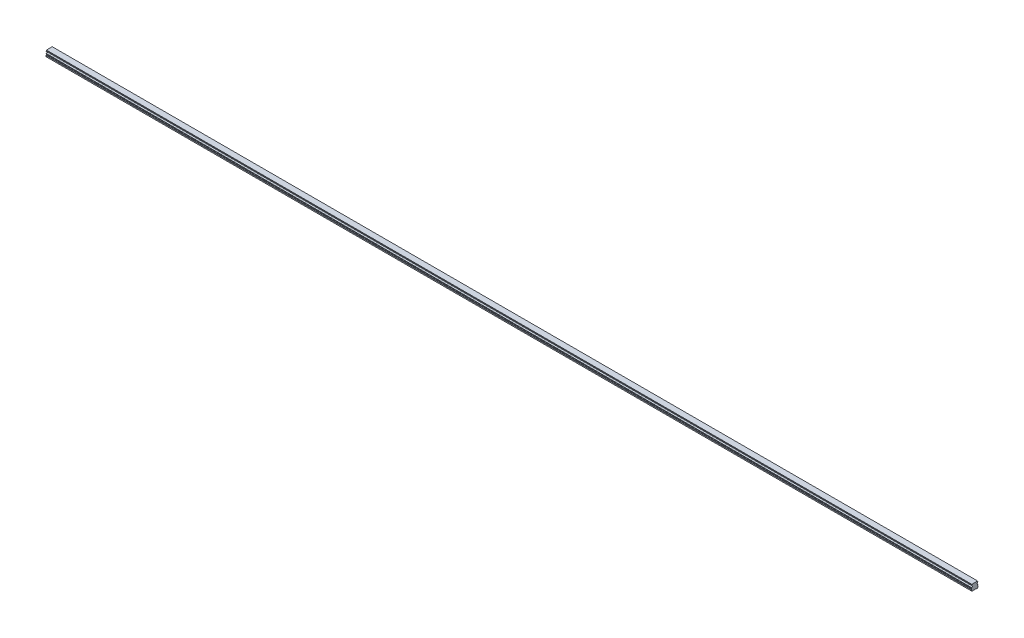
ISO-10303-21;
HEADER;
FILE_DESCRIPTION(('STEP AP214'),'2;1');
FILE_NAME('part.step','',(''),(''),'','','');
FILE_SCHEMA(('AUTOMOTIVE_DESIGN { 1 0 10303 214 1 1 1 1 }'));
ENDSEC;
DATA;
#1=APPLICATION_CONTEXT('core data for automotive mechanical design processes');
#2=APPLICATION_PROTOCOL_DEFINITION('international standard','automotive_design',2000,#1);
#3=PRODUCT_CONTEXT('',#1,'mechanical');
#4=PRODUCT('Part','Part','',(#3));
#5=PRODUCT_RELATED_PRODUCT_CATEGORY('part','',(#4));
#6=PRODUCT_DEFINITION_FORMATION('','',#4);
#7=PRODUCT_DEFINITION_CONTEXT('part definition',#1,'design');
#8=PRODUCT_DEFINITION('design','',#6,#7);
#9=PRODUCT_DEFINITION_SHAPE('','',#8);
#10=(LENGTH_UNIT() NAMED_UNIT(*) SI_UNIT(.MILLI.,.METRE.));
#11=(NAMED_UNIT(*) PLANE_ANGLE_UNIT() SI_UNIT($,.RADIAN.));
#12=(NAMED_UNIT(*) SI_UNIT($,.STERADIAN.) SOLID_ANGLE_UNIT());
#13=UNCERTAINTY_MEASURE_WITH_UNIT(LENGTH_MEASURE(1.E-05),#10,'distance_accuracy_value','');
#14=(GEOMETRIC_REPRESENTATION_CONTEXT(3) GLOBAL_UNCERTAINTY_ASSIGNED_CONTEXT((#13)) GLOBAL_UNIT_ASSIGNED_CONTEXT((#10,
#11,#12)) REPRESENTATION_CONTEXT('',''));
#15=CARTESIAN_POINT('',(0.,0.,0.));
#16=DIRECTION('',(0.,0.,1.));
#17=DIRECTION('',(1.,0.,0.));
#18=AXIS2_PLACEMENT_3D('',#15,#16,#17);
#19=CARTESIAN_POINT('',(2070.,0.399999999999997,0.));
#20=DIRECTION('',(0.,-1.,0.));
#21=DIRECTION('',(0.,0.,-1.));
#22=AXIS2_PLACEMENT_3D('',#19,#20,#21);
#23=CONICAL_SURFACE('',#22,2.89999999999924,0.785398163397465);
#24=CARTESIAN_POINT('',(2070.,0.79999999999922,0.));
#25=DIRECTION('',(0.,1.,0.));
#26=DIRECTION('',(0.,0.,1.));
#27=AXIS2_PLACEMENT_3D('',#24,#25,#26);
#28=CIRCLE('',#27,2.5);
#29=CARTESIAN_POINT('',(2070.,0.799999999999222,2.5));
#30=VERTEX_POINT('',#29);
#31=EDGE_CURVE('E11',#30,#30,#28,.F.);
#32=ORIENTED_EDGE('',*,*,#31,.F.);
#33=EDGE_LOOP('',(#32));
#34=FACE_BOUND('',#33,.T.);
#35=CARTESIAN_POINT('',(2070.,0.399999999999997,0.));
#36=DIRECTION('',(0.,1.,0.));
#37=DIRECTION('',(0.,0.,1.));
#38=AXIS2_PLACEMENT_3D('',#35,#36,#37);
#39=CIRCLE('',#38,2.89999999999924);
#40=CARTESIAN_POINT('',(2070.,0.399999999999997,2.89999999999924));
#41=VERTEX_POINT('',#40);
#42=EDGE_CURVE('E817',#41,#41,#39,.T.);
#43=ORIENTED_EDGE('',*,*,#42,.F.);
#44=EDGE_LOOP('',(#43));
#45=FACE_BOUND('',#44,.T.);
#46=ADVANCED_FACE('F39',(#34,#45),#23,.F.);
#47=CARTESIAN_POINT('',(2070.,7.,0.));
#48=DIRECTION('',(0.,-1.,0.));
#49=DIRECTION('',(0.,0.,-1.));
#50=AXIS2_PLACEMENT_3D('',#47,#48,#49);
#51=CYLINDRICAL_SURFACE('',#50,2.5);
#52=ORIENTED_EDGE('',*,*,#31,.T.);
#53=EDGE_LOOP('',(#52));
#54=FACE_BOUND('',#53,.T.);
#55=CARTESIAN_POINT('',(2070.,7.,0.));
#56=DIRECTION('',(0.,-1.,0.));
#57=DIRECTION('',(0.,0.,-1.));
#58=AXIS2_PLACEMENT_3D('',#55,#56,#57);
#59=CIRCLE('',#58,2.5);
#60=CARTESIAN_POINT('',(2070.,7.,-2.50000000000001));
#61=VERTEX_POINT('',#60);
#62=EDGE_CURVE('E49',#61,#61,#59,.T.);
#63=ORIENTED_EDGE('',*,*,#62,.F.);
#64=EDGE_LOOP('',(#63));
#65=FACE_BOUND('',#64,.T.);
#66=ADVANCED_FACE('F1191',(#54,#65),#51,.F.);
#67=CARTESIAN_POINT('',(2070.,7.,0.));
#68=DIRECTION('',(0.,-1.,0.));
#69=DIRECTION('',(0.,0.,-1.));
#70=AXIS2_PLACEMENT_3D('',#67,#68,#69);
#71=PLANE('',#70);
#72=CARTESIAN_POINT('',(2070.,7.,0.));
#73=DIRECTION('',(0.,-1.,0.));
#74=DIRECTION('',(0.,0.,-1.));
#75=AXIS2_PLACEMENT_3D('',#72,#73,#74);
#76=CIRCLE('',#75,2.1);
#77=CARTESIAN_POINT('',(2070.,7.,-2.1));
#78=VERTEX_POINT('',#77);
#79=EDGE_CURVE('E42',#78,#78,#76,.T.);
#80=ORIENTED_EDGE('',*,*,#79,.F.);
#81=EDGE_LOOP('',(#80));
#82=FACE_BOUND('',#81,.T.);
#83=ORIENTED_EDGE('',*,*,#62,.T.);
#84=EDGE_LOOP('',(#83));
#85=FACE_BOUND('',#84,.T.);
#86=ADVANCED_FACE('F1196',(#82,#85),#71,.T.);
#87=CARTESIAN_POINT('',(2010.,0.399999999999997,0.));
#88=DIRECTION('',(0.,-1.,0.));
#89=DIRECTION('',(0.,0.,-1.));
#90=AXIS2_PLACEMENT_3D('',#87,#88,#89);
#91=CONICAL_SURFACE('',#90,2.89999999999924,0.785398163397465);
#92=CARTESIAN_POINT('',(2010.,0.79999999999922,0.));
#93=DIRECTION('',(0.,1.,0.));
#94=DIRECTION('',(0.,0.,1.));
#95=AXIS2_PLACEMENT_3D('',#92,#93,#94);
#96=CIRCLE('',#95,2.5);
#97=CARTESIAN_POINT('',(2010.,0.799999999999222,2.5));
#98=VERTEX_POINT('',#97);
#99=EDGE_CURVE('E813',#98,#98,#96,.F.);
#100=ORIENTED_EDGE('',*,*,#99,.F.);
#101=EDGE_LOOP('',(#100));
#102=FACE_BOUND('',#101,.T.);
#103=CARTESIAN_POINT('',(2010.,0.399999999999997,0.));
#104=DIRECTION('',(0.,1.,0.));
#105=DIRECTION('',(0.,0.,1.));
#106=AXIS2_PLACEMENT_3D('',#103,#104,#105);
#107=CIRCLE('',#106,2.89999999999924);
#108=CARTESIAN_POINT('',(2010.,0.399999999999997,2.89999999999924));
#109=VERTEX_POINT('',#108);
#110=EDGE_CURVE('E805',#109,#109,#107,.T.);
#111=ORIENTED_EDGE('',*,*,#110,.F.);
#112=EDGE_LOOP('',(#111));
#113=FACE_BOUND('',#112,.T.);
#114=ADVANCED_FACE('F1655',(#102,#113),#91,.F.);
#115=CARTESIAN_POINT('',(2010.,7.,0.));
#116=DIRECTION('',(0.,-1.,0.));
#117=DIRECTION('',(0.,0.,-1.));
#118=AXIS2_PLACEMENT_3D('',#115,#116,#117);
#119=CYLINDRICAL_SURFACE('',#118,2.5);
#120=ORIENTED_EDGE('',*,*,#99,.T.);
#121=EDGE_LOOP('',(#120));
#122=FACE_BOUND('',#121,.T.);
#123=CARTESIAN_POINT('',(2010.,7.,0.));
#124=DIRECTION('',(0.,-1.,0.));
#125=DIRECTION('',(0.,0.,-1.));
#126=AXIS2_PLACEMENT_3D('',#123,#124,#125);
#127=CIRCLE('',#126,2.5);
#128=CARTESIAN_POINT('',(2010.,7.,-2.50000000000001));
#129=VERTEX_POINT('',#128);
#130=EDGE_CURVE('E809',#129,#129,#127,.T.);
#131=ORIENTED_EDGE('',*,*,#130,.F.);
#132=EDGE_LOOP('',(#131));
#133=FACE_BOUND('',#132,.T.);
#134=ADVANCED_FACE('F1651',(#122,#133),#119,.F.);
#135=CARTESIAN_POINT('',(2010.,7.,0.));
#136=DIRECTION('',(0.,-1.,0.));
#137=DIRECTION('',(0.,0.,-1.));
#138=AXIS2_PLACEMENT_3D('',#135,#136,#137);
#139=PLANE('',#138);
#140=CARTESIAN_POINT('',(2010.,7.,0.));
#141=DIRECTION('',(0.,-1.,0.));
#142=DIRECTION('',(0.,0.,-1.));
#143=AXIS2_PLACEMENT_3D('',#140,#141,#142);
#144=CIRCLE('',#143,2.1);
#145=CARTESIAN_POINT('',(2010.,7.,-2.1));
#146=VERTEX_POINT('',#145);
#147=EDGE_CURVE('E952',#146,#146,#144,.T.);
#148=ORIENTED_EDGE('',*,*,#147,.F.);
#149=EDGE_LOOP('',(#148));
#150=FACE_BOUND('',#149,.T.);
#151=ORIENTED_EDGE('',*,*,#130,.T.);
#152=EDGE_LOOP('',(#151));
#153=FACE_BOUND('',#152,.T.);
#154=ADVANCED_FACE('F1647',(#150,#153),#139,.T.);
#155=CARTESIAN_POINT('',(1950.,0.399999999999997,0.));
#156=DIRECTION('',(0.,-1.,0.));
#157=DIRECTION('',(0.,0.,-1.));
#158=AXIS2_PLACEMENT_3D('',#155,#156,#157);
#159=CONICAL_SURFACE('',#158,2.89999999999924,0.785398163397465);
#160=CARTESIAN_POINT('',(1950.,0.79999999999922,0.));
#161=DIRECTION('',(0.,1.,0.));
#162=DIRECTION('',(0.,0.,1.));
#163=AXIS2_PLACEMENT_3D('',#160,#161,#162);
#164=CIRCLE('',#163,2.5);
#165=CARTESIAN_POINT('',(1950.,0.799999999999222,2.5));
#166=VERTEX_POINT('',#165);
#167=EDGE_CURVE('E801',#166,#166,#164,.F.);
#168=ORIENTED_EDGE('',*,*,#167,.F.);
#169=EDGE_LOOP('',(#168));
#170=FACE_BOUND('',#169,.T.);
#171=CARTESIAN_POINT('',(1950.,0.399999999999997,0.));
#172=DIRECTION('',(0.,1.,0.));
#173=DIRECTION('',(0.,0.,1.));
#174=AXIS2_PLACEMENT_3D('',#171,#172,#173);
#175=CIRCLE('',#174,2.89999999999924);
#176=CARTESIAN_POINT('',(1950.,0.399999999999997,2.89999999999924));
#177=VERTEX_POINT('',#176);
#178=EDGE_CURVE('E793',#177,#177,#175,.T.);
#179=ORIENTED_EDGE('',*,*,#178,.F.);
#180=EDGE_LOOP('',(#179));
#181=FACE_BOUND('',#180,.T.);
#182=ADVANCED_FACE('F1643',(#170,#181),#159,.F.);
#183=CARTESIAN_POINT('',(1950.,7.,0.));
#184=DIRECTION('',(0.,-1.,0.));
#185=DIRECTION('',(0.,0.,-1.));
#186=AXIS2_PLACEMENT_3D('',#183,#184,#185);
#187=CYLINDRICAL_SURFACE('',#186,2.5);
#188=ORIENTED_EDGE('',*,*,#167,.T.);
#189=EDGE_LOOP('',(#188));
#190=FACE_BOUND('',#189,.T.);
#191=CARTESIAN_POINT('',(1950.,7.,0.));
#192=DIRECTION('',(0.,-1.,0.));
#193=DIRECTION('',(0.,0.,-1.));
#194=AXIS2_PLACEMENT_3D('',#191,#192,#193);
#195=CIRCLE('',#194,2.5);
#196=CARTESIAN_POINT('',(1950.,7.,-2.50000000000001));
#197=VERTEX_POINT('',#196);
#198=EDGE_CURVE('E797',#197,#197,#195,.T.);
#199=ORIENTED_EDGE('',*,*,#198,.F.);
#200=EDGE_LOOP('',(#199));
#201=FACE_BOUND('',#200,.T.);
#202=ADVANCED_FACE('F1639',(#190,#201),#187,.F.);
#203=CARTESIAN_POINT('',(1950.,7.,0.));
#204=DIRECTION('',(0.,-1.,0.));
#205=DIRECTION('',(0.,0.,-1.));
#206=AXIS2_PLACEMENT_3D('',#203,#204,#205);
#207=PLANE('',#206);
#208=CARTESIAN_POINT('',(1950.,7.,0.));
#209=DIRECTION('',(0.,-1.,0.));
#210=DIRECTION('',(0.,0.,-1.));
#211=AXIS2_PLACEMENT_3D('',#208,#209,#210);
#212=CIRCLE('',#211,2.1);
#213=CARTESIAN_POINT('',(1950.,7.,-2.1));
#214=VERTEX_POINT('',#213);
#215=EDGE_CURVE('E949',#214,#214,#212,.T.);
#216=ORIENTED_EDGE('',*,*,#215,.F.);
#217=EDGE_LOOP('',(#216));
#218=FACE_BOUND('',#217,.T.);
#219=ORIENTED_EDGE('',*,*,#198,.T.);
#220=EDGE_LOOP('',(#219));
#221=FACE_BOUND('',#220,.T.);
#222=ADVANCED_FACE('F1635',(#218,#221),#207,.T.);
#223=CARTESIAN_POINT('',(1890.,0.399999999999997,0.));
#224=DIRECTION('',(0.,-1.,0.));
#225=DIRECTION('',(0.,0.,-1.));
#226=AXIS2_PLACEMENT_3D('',#223,#224,#225);
#227=CONICAL_SURFACE('',#226,2.89999999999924,0.785398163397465);
#228=CARTESIAN_POINT('',(1890.,0.79999999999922,0.));
#229=DIRECTION('',(0.,1.,0.));
#230=DIRECTION('',(0.,0.,1.));
#231=AXIS2_PLACEMENT_3D('',#228,#229,#230);
#232=CIRCLE('',#231,2.5);
#233=CARTESIAN_POINT('',(1890.,0.799999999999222,2.5));
#234=VERTEX_POINT('',#233);
#235=EDGE_CURVE('E789',#234,#234,#232,.F.);
#236=ORIENTED_EDGE('',*,*,#235,.F.);
#237=EDGE_LOOP('',(#236));
#238=FACE_BOUND('',#237,.T.);
#239=CARTESIAN_POINT('',(1890.,0.399999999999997,0.));
#240=DIRECTION('',(0.,1.,0.));
#241=DIRECTION('',(0.,0.,1.));
#242=AXIS2_PLACEMENT_3D('',#239,#240,#241);
#243=CIRCLE('',#242,2.89999999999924);
#244=CARTESIAN_POINT('',(1890.,0.399999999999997,2.89999999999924));
#245=VERTEX_POINT('',#244);
#246=EDGE_CURVE('E781',#245,#245,#243,.T.);
#247=ORIENTED_EDGE('',*,*,#246,.F.);
#248=EDGE_LOOP('',(#247));
#249=FACE_BOUND('',#248,.T.);
#250=ADVANCED_FACE('F1631',(#238,#249),#227,.F.);
#251=CARTESIAN_POINT('',(1890.,7.,0.));
#252=DIRECTION('',(0.,-1.,0.));
#253=DIRECTION('',(0.,0.,-1.));
#254=AXIS2_PLACEMENT_3D('',#251,#252,#253);
#255=CYLINDRICAL_SURFACE('',#254,2.5);
#256=ORIENTED_EDGE('',*,*,#235,.T.);
#257=EDGE_LOOP('',(#256));
#258=FACE_BOUND('',#257,.T.);
#259=CARTESIAN_POINT('',(1890.,7.,0.));
#260=DIRECTION('',(0.,-1.,0.));
#261=DIRECTION('',(0.,0.,-1.));
#262=AXIS2_PLACEMENT_3D('',#259,#260,#261);
#263=CIRCLE('',#262,2.5);
#264=CARTESIAN_POINT('',(1890.,7.,-2.50000000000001));
#265=VERTEX_POINT('',#264);
#266=EDGE_CURVE('E785',#265,#265,#263,.T.);
#267=ORIENTED_EDGE('',*,*,#266,.F.);
#268=EDGE_LOOP('',(#267));
#269=FACE_BOUND('',#268,.T.);
#270=ADVANCED_FACE('F1627',(#258,#269),#255,.F.);
#271=CARTESIAN_POINT('',(1890.,7.,0.));
#272=DIRECTION('',(0.,-1.,0.));
#273=DIRECTION('',(0.,0.,-1.));
#274=AXIS2_PLACEMENT_3D('',#271,#272,#273);
#275=PLANE('',#274);
#276=CARTESIAN_POINT('',(1890.,7.,0.));
#277=DIRECTION('',(0.,-1.,0.));
#278=DIRECTION('',(0.,0.,-1.));
#279=AXIS2_PLACEMENT_3D('',#276,#277,#278);
#280=CIRCLE('',#279,2.1);
#281=CARTESIAN_POINT('',(1890.,7.,-2.1));
#282=VERTEX_POINT('',#281);
#283=EDGE_CURVE('E945',#282,#282,#280,.T.);
#284=ORIENTED_EDGE('',*,*,#283,.F.);
#285=EDGE_LOOP('',(#284));
#286=FACE_BOUND('',#285,.T.);
#287=ORIENTED_EDGE('',*,*,#266,.T.);
#288=EDGE_LOOP('',(#287));
#289=FACE_BOUND('',#288,.T.);
#290=ADVANCED_FACE('F1623',(#286,#289),#275,.T.);
#291=CARTESIAN_POINT('',(1830.,0.399999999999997,0.));
#292=DIRECTION('',(0.,-1.,0.));
#293=DIRECTION('',(0.,0.,-1.));
#294=AXIS2_PLACEMENT_3D('',#291,#292,#293);
#295=CONICAL_SURFACE('',#294,2.89999999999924,0.785398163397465);
#296=CARTESIAN_POINT('',(1830.,0.79999999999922,0.));
#297=DIRECTION('',(0.,1.,0.));
#298=DIRECTION('',(0.,0.,1.));
#299=AXIS2_PLACEMENT_3D('',#296,#297,#298);
#300=CIRCLE('',#299,2.5);
#301=CARTESIAN_POINT('',(1830.,0.799999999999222,2.5));
#302=VERTEX_POINT('',#301);
#303=EDGE_CURVE('E777',#302,#302,#300,.F.);
#304=ORIENTED_EDGE('',*,*,#303,.F.);
#305=EDGE_LOOP('',(#304));
#306=FACE_BOUND('',#305,.T.);
#307=CARTESIAN_POINT('',(1830.,0.399999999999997,0.));
#308=DIRECTION('',(0.,1.,0.));
#309=DIRECTION('',(0.,0.,1.));
#310=AXIS2_PLACEMENT_3D('',#307,#308,#309);
#311=CIRCLE('',#310,2.89999999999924);
#312=CARTESIAN_POINT('',(1830.,0.399999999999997,2.89999999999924));
#313=VERTEX_POINT('',#312);
#314=EDGE_CURVE('E769',#313,#313,#311,.T.);
#315=ORIENTED_EDGE('',*,*,#314,.F.);
#316=EDGE_LOOP('',(#315));
#317=FACE_BOUND('',#316,.T.);
#318=ADVANCED_FACE('F1619',(#306,#317),#295,.F.);
#319=CARTESIAN_POINT('',(1830.,7.,0.));
#320=DIRECTION('',(0.,-1.,0.));
#321=DIRECTION('',(0.,0.,-1.));
#322=AXIS2_PLACEMENT_3D('',#319,#320,#321);
#323=CYLINDRICAL_SURFACE('',#322,2.5);
#324=ORIENTED_EDGE('',*,*,#303,.T.);
#325=EDGE_LOOP('',(#324));
#326=FACE_BOUND('',#325,.T.);
#327=CARTESIAN_POINT('',(1830.,7.,0.));
#328=DIRECTION('',(0.,-1.,0.));
#329=DIRECTION('',(0.,0.,-1.));
#330=AXIS2_PLACEMENT_3D('',#327,#328,#329);
#331=CIRCLE('',#330,2.5);
#332=CARTESIAN_POINT('',(1830.,7.,-2.50000000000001));
#333=VERTEX_POINT('',#332);
#334=EDGE_CURVE('E773',#333,#333,#331,.T.);
#335=ORIENTED_EDGE('',*,*,#334,.F.);
#336=EDGE_LOOP('',(#335));
#337=FACE_BOUND('',#336,.T.);
#338=ADVANCED_FACE('F1615',(#326,#337),#323,.F.);
#339=CARTESIAN_POINT('',(1830.,7.,0.));
#340=DIRECTION('',(0.,-1.,0.));
#341=DIRECTION('',(0.,0.,-1.));
#342=AXIS2_PLACEMENT_3D('',#339,#340,#341);
#343=PLANE('',#342);
#344=CARTESIAN_POINT('',(1830.,7.,0.));
#345=DIRECTION('',(0.,-1.,0.));
#346=DIRECTION('',(0.,0.,-1.));
#347=AXIS2_PLACEMENT_3D('',#344,#345,#346);
#348=CIRCLE('',#347,2.1);
#349=CARTESIAN_POINT('',(1830.,7.,-2.1));
#350=VERTEX_POINT('',#349);
#351=EDGE_CURVE('E941',#350,#350,#348,.T.);
#352=ORIENTED_EDGE('',*,*,#351,.F.);
#353=EDGE_LOOP('',(#352));
#354=FACE_BOUND('',#353,.T.);
#355=ORIENTED_EDGE('',*,*,#334,.T.);
#356=EDGE_LOOP('',(#355));
#357=FACE_BOUND('',#356,.T.);
#358=ADVANCED_FACE('F1611',(#354,#357),#343,.T.);
#359=CARTESIAN_POINT('',(1770.,0.399999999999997,0.));
#360=DIRECTION('',(0.,-1.,0.));
#361=DIRECTION('',(0.,0.,-1.));
#362=AXIS2_PLACEMENT_3D('',#359,#360,#361);
#363=CONICAL_SURFACE('',#362,2.89999999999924,0.785398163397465);
#364=CARTESIAN_POINT('',(1770.,0.79999999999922,0.));
#365=DIRECTION('',(0.,1.,0.));
#366=DIRECTION('',(0.,0.,1.));
#367=AXIS2_PLACEMENT_3D('',#364,#365,#366);
#368=CIRCLE('',#367,2.5);
#369=CARTESIAN_POINT('',(1770.,0.799999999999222,2.5));
#370=VERTEX_POINT('',#369);
#371=EDGE_CURVE('E765',#370,#370,#368,.F.);
#372=ORIENTED_EDGE('',*,*,#371,.F.);
#373=EDGE_LOOP('',(#372));
#374=FACE_BOUND('',#373,.T.);
#375=CARTESIAN_POINT('',(1770.,0.399999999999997,0.));
#376=DIRECTION('',(0.,1.,0.));
#377=DIRECTION('',(0.,0.,1.));
#378=AXIS2_PLACEMENT_3D('',#375,#376,#377);
#379=CIRCLE('',#378,2.89999999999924);
#380=CARTESIAN_POINT('',(1770.,0.399999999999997,2.89999999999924));
#381=VERTEX_POINT('',#380);
#382=EDGE_CURVE('E757',#381,#381,#379,.T.);
#383=ORIENTED_EDGE('',*,*,#382,.F.);
#384=EDGE_LOOP('',(#383));
#385=FACE_BOUND('',#384,.T.);
#386=ADVANCED_FACE('F1607',(#374,#385),#363,.F.);
#387=CARTESIAN_POINT('',(1770.,7.,0.));
#388=DIRECTION('',(0.,-1.,0.));
#389=DIRECTION('',(0.,0.,-1.));
#390=AXIS2_PLACEMENT_3D('',#387,#388,#389);
#391=CYLINDRICAL_SURFACE('',#390,2.5);
#392=ORIENTED_EDGE('',*,*,#371,.T.);
#393=EDGE_LOOP('',(#392));
#394=FACE_BOUND('',#393,.T.);
#395=CARTESIAN_POINT('',(1770.,7.,0.));
#396=DIRECTION('',(0.,-1.,0.));
#397=DIRECTION('',(0.,0.,-1.));
#398=AXIS2_PLACEMENT_3D('',#395,#396,#397);
#399=CIRCLE('',#398,2.5);
#400=CARTESIAN_POINT('',(1770.,7.,-2.50000000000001));
#401=VERTEX_POINT('',#400);
#402=EDGE_CURVE('E761',#401,#401,#399,.T.);
#403=ORIENTED_EDGE('',*,*,#402,.F.);
#404=EDGE_LOOP('',(#403));
#405=FACE_BOUND('',#404,.T.);
#406=ADVANCED_FACE('F1603',(#394,#405),#391,.F.);
#407=CARTESIAN_POINT('',(1770.,7.,0.));
#408=DIRECTION('',(0.,-1.,0.));
#409=DIRECTION('',(0.,0.,-1.));
#410=AXIS2_PLACEMENT_3D('',#407,#408,#409);
#411=PLANE('',#410);
#412=CARTESIAN_POINT('',(1770.,7.,0.));
#413=DIRECTION('',(0.,-1.,0.));
#414=DIRECTION('',(0.,0.,-1.));
#415=AXIS2_PLACEMENT_3D('',#412,#413,#414);
#416=CIRCLE('',#415,2.1);
#417=CARTESIAN_POINT('',(1770.,7.,-2.1));
#418=VERTEX_POINT('',#417);
#419=EDGE_CURVE('E937',#418,#418,#416,.T.);
#420=ORIENTED_EDGE('',*,*,#419,.F.);
#421=EDGE_LOOP('',(#420));
#422=FACE_BOUND('',#421,.T.);
#423=ORIENTED_EDGE('',*,*,#402,.T.);
#424=EDGE_LOOP('',(#423));
#425=FACE_BOUND('',#424,.T.);
#426=ADVANCED_FACE('F1599',(#422,#425),#411,.T.);
#427=CARTESIAN_POINT('',(1710.,0.399999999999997,0.));
#428=DIRECTION('',(0.,-1.,0.));
#429=DIRECTION('',(0.,0.,-1.));
#430=AXIS2_PLACEMENT_3D('',#427,#428,#429);
#431=CONICAL_SURFACE('',#430,2.89999999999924,0.785398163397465);
#432=CARTESIAN_POINT('',(1710.,0.79999999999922,0.));
#433=DIRECTION('',(0.,1.,0.));
#434=DIRECTION('',(0.,0.,1.));
#435=AXIS2_PLACEMENT_3D('',#432,#433,#434);
#436=CIRCLE('',#435,2.5);
#437=CARTESIAN_POINT('',(1710.,0.799999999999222,2.5));
#438=VERTEX_POINT('',#437);
#439=EDGE_CURVE('E753',#438,#438,#436,.F.);
#440=ORIENTED_EDGE('',*,*,#439,.F.);
#441=EDGE_LOOP('',(#440));
#442=FACE_BOUND('',#441,.T.);
#443=CARTESIAN_POINT('',(1710.,0.399999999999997,0.));
#444=DIRECTION('',(0.,1.,0.));
#445=DIRECTION('',(0.,0.,1.));
#446=AXIS2_PLACEMENT_3D('',#443,#444,#445);
#447=CIRCLE('',#446,2.89999999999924);
#448=CARTESIAN_POINT('',(1710.,0.399999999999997,2.89999999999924));
#449=VERTEX_POINT('',#448);
#450=EDGE_CURVE('E745',#449,#449,#447,.T.);
#451=ORIENTED_EDGE('',*,*,#450,.F.);
#452=EDGE_LOOP('',(#451));
#453=FACE_BOUND('',#452,.T.);
#454=ADVANCED_FACE('F1595',(#442,#453),#431,.F.);
#455=CARTESIAN_POINT('',(1710.,7.,0.));
#456=DIRECTION('',(0.,-1.,0.));
#457=DIRECTION('',(0.,0.,-1.));
#458=AXIS2_PLACEMENT_3D('',#455,#456,#457);
#459=CYLINDRICAL_SURFACE('',#458,2.5);
#460=ORIENTED_EDGE('',*,*,#439,.T.);
#461=EDGE_LOOP('',(#460));
#462=FACE_BOUND('',#461,.T.);
#463=CARTESIAN_POINT('',(1710.,7.,0.));
#464=DIRECTION('',(0.,-1.,0.));
#465=DIRECTION('',(0.,0.,-1.));
#466=AXIS2_PLACEMENT_3D('',#463,#464,#465);
#467=CIRCLE('',#466,2.5);
#468=CARTESIAN_POINT('',(1710.,7.,-2.50000000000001));
#469=VERTEX_POINT('',#468);
#470=EDGE_CURVE('E749',#469,#469,#467,.T.);
#471=ORIENTED_EDGE('',*,*,#470,.F.);
#472=EDGE_LOOP('',(#471));
#473=FACE_BOUND('',#472,.T.);
#474=ADVANCED_FACE('F1591',(#462,#473),#459,.F.);
#475=CARTESIAN_POINT('',(1710.,7.,0.));
#476=DIRECTION('',(0.,-1.,0.));
#477=DIRECTION('',(0.,0.,-1.));
#478=AXIS2_PLACEMENT_3D('',#475,#476,#477);
#479=PLANE('',#478);
#480=CARTESIAN_POINT('',(1710.,7.,0.));
#481=DIRECTION('',(0.,-1.,0.));
#482=DIRECTION('',(0.,0.,-1.));
#483=AXIS2_PLACEMENT_3D('',#480,#481,#482);
#484=CIRCLE('',#483,2.1);
#485=CARTESIAN_POINT('',(1710.,7.,-2.1));
#486=VERTEX_POINT('',#485);
#487=EDGE_CURVE('E933',#486,#486,#484,.T.);
#488=ORIENTED_EDGE('',*,*,#487,.F.);
#489=EDGE_LOOP('',(#488));
#490=FACE_BOUND('',#489,.T.);
#491=ORIENTED_EDGE('',*,*,#470,.T.);
#492=EDGE_LOOP('',(#491));
#493=FACE_BOUND('',#492,.T.);
#494=ADVANCED_FACE('F1587',(#490,#493),#479,.T.);
#495=CARTESIAN_POINT('',(1650.,0.399999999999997,0.));
#496=DIRECTION('',(0.,-1.,0.));
#497=DIRECTION('',(0.,0.,-1.));
#498=AXIS2_PLACEMENT_3D('',#495,#496,#497);
#499=CONICAL_SURFACE('',#498,2.89999999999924,0.785398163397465);
#500=CARTESIAN_POINT('',(1650.,0.79999999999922,0.));
#501=DIRECTION('',(0.,1.,0.));
#502=DIRECTION('',(0.,0.,1.));
#503=AXIS2_PLACEMENT_3D('',#500,#501,#502);
#504=CIRCLE('',#503,2.5);
#505=CARTESIAN_POINT('',(1650.,0.799999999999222,2.5));
#506=VERTEX_POINT('',#505);
#507=EDGE_CURVE('E741',#506,#506,#504,.F.);
#508=ORIENTED_EDGE('',*,*,#507,.F.);
#509=EDGE_LOOP('',(#508));
#510=FACE_BOUND('',#509,.T.);
#511=CARTESIAN_POINT('',(1650.,0.399999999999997,0.));
#512=DIRECTION('',(0.,1.,0.));
#513=DIRECTION('',(0.,0.,1.));
#514=AXIS2_PLACEMENT_3D('',#511,#512,#513);
#515=CIRCLE('',#514,2.89999999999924);
#516=CARTESIAN_POINT('',(1650.,0.399999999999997,2.89999999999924));
#517=VERTEX_POINT('',#516);
#518=EDGE_CURVE('E733',#517,#517,#515,.T.);
#519=ORIENTED_EDGE('',*,*,#518,.F.);
#520=EDGE_LOOP('',(#519));
#521=FACE_BOUND('',#520,.T.);
#522=ADVANCED_FACE('F1583',(#510,#521),#499,.F.);
#523=CARTESIAN_POINT('',(1650.,7.,0.));
#524=DIRECTION('',(0.,-1.,0.));
#525=DIRECTION('',(0.,0.,-1.));
#526=AXIS2_PLACEMENT_3D('',#523,#524,#525);
#527=CYLINDRICAL_SURFACE('',#526,2.5);
#528=ORIENTED_EDGE('',*,*,#507,.T.);
#529=EDGE_LOOP('',(#528));
#530=FACE_BOUND('',#529,.T.);
#531=CARTESIAN_POINT('',(1650.,7.,0.));
#532=DIRECTION('',(0.,-1.,0.));
#533=DIRECTION('',(0.,0.,-1.));
#534=AXIS2_PLACEMENT_3D('',#531,#532,#533);
#535=CIRCLE('',#534,2.5);
#536=CARTESIAN_POINT('',(1650.,7.,-2.50000000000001));
#537=VERTEX_POINT('',#536);
#538=EDGE_CURVE('E737',#537,#537,#535,.T.);
#539=ORIENTED_EDGE('',*,*,#538,.F.);
#540=EDGE_LOOP('',(#539));
#541=FACE_BOUND('',#540,.T.);
#542=ADVANCED_FACE('F1579',(#530,#541),#527,.F.);
#543=CARTESIAN_POINT('',(1650.,7.,0.));
#544=DIRECTION('',(0.,-1.,0.));
#545=DIRECTION('',(0.,0.,-1.));
#546=AXIS2_PLACEMENT_3D('',#543,#544,#545);
#547=PLANE('',#546);
#548=CARTESIAN_POINT('',(1650.,7.,0.));
#549=DIRECTION('',(0.,-1.,0.));
#550=DIRECTION('',(0.,0.,-1.));
#551=AXIS2_PLACEMENT_3D('',#548,#549,#550);
#552=CIRCLE('',#551,2.1);
#553=CARTESIAN_POINT('',(1650.,7.,-2.1));
#554=VERTEX_POINT('',#553);
#555=EDGE_CURVE('E929',#554,#554,#552,.T.);
#556=ORIENTED_EDGE('',*,*,#555,.F.);
#557=EDGE_LOOP('',(#556));
#558=FACE_BOUND('',#557,.T.);
#559=ORIENTED_EDGE('',*,*,#538,.T.);
#560=EDGE_LOOP('',(#559));
#561=FACE_BOUND('',#560,.T.);
#562=ADVANCED_FACE('F1575',(#558,#561),#547,.T.);
#563=CARTESIAN_POINT('',(1590.,0.399999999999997,0.));
#564=DIRECTION('',(0.,-1.,0.));
#565=DIRECTION('',(0.,0.,-1.));
#566=AXIS2_PLACEMENT_3D('',#563,#564,#565);
#567=CONICAL_SURFACE('',#566,2.89999999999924,0.785398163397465);
#568=CARTESIAN_POINT('',(1590.,0.79999999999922,0.));
#569=DIRECTION('',(0.,1.,0.));
#570=DIRECTION('',(0.,0.,1.));
#571=AXIS2_PLACEMENT_3D('',#568,#569,#570);
#572=CIRCLE('',#571,2.5);
#573=CARTESIAN_POINT('',(1590.,0.799999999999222,2.5));
#574=VERTEX_POINT('',#573);
#575=EDGE_CURVE('E729',#574,#574,#572,.F.);
#576=ORIENTED_EDGE('',*,*,#575,.F.);
#577=EDGE_LOOP('',(#576));
#578=FACE_BOUND('',#577,.T.);
#579=CARTESIAN_POINT('',(1590.,0.399999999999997,0.));
#580=DIRECTION('',(0.,1.,0.));
#581=DIRECTION('',(0.,0.,1.));
#582=AXIS2_PLACEMENT_3D('',#579,#580,#581);
#583=CIRCLE('',#582,2.89999999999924);
#584=CARTESIAN_POINT('',(1590.,0.399999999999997,2.89999999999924));
#585=VERTEX_POINT('',#584);
#586=EDGE_CURVE('E721',#585,#585,#583,.T.);
#587=ORIENTED_EDGE('',*,*,#586,.F.);
#588=EDGE_LOOP('',(#587));
#589=FACE_BOUND('',#588,.T.);
#590=ADVANCED_FACE('F1571',(#578,#589),#567,.F.);
#591=CARTESIAN_POINT('',(1590.,7.,0.));
#592=DIRECTION('',(0.,-1.,0.));
#593=DIRECTION('',(0.,0.,-1.));
#594=AXIS2_PLACEMENT_3D('',#591,#592,#593);
#595=CYLINDRICAL_SURFACE('',#594,2.5);
#596=ORIENTED_EDGE('',*,*,#575,.T.);
#597=EDGE_LOOP('',(#596));
#598=FACE_BOUND('',#597,.T.);
#599=CARTESIAN_POINT('',(1590.,7.,0.));
#600=DIRECTION('',(0.,-1.,0.));
#601=DIRECTION('',(0.,0.,-1.));
#602=AXIS2_PLACEMENT_3D('',#599,#600,#601);
#603=CIRCLE('',#602,2.5);
#604=CARTESIAN_POINT('',(1590.,7.,-2.50000000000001));
#605=VERTEX_POINT('',#604);
#606=EDGE_CURVE('E725',#605,#605,#603,.T.);
#607=ORIENTED_EDGE('',*,*,#606,.F.);
#608=EDGE_LOOP('',(#607));
#609=FACE_BOUND('',#608,.T.);
#610=ADVANCED_FACE('F1567',(#598,#609),#595,.F.);
#611=CARTESIAN_POINT('',(1590.,7.,0.));
#612=DIRECTION('',(0.,-1.,0.));
#613=DIRECTION('',(0.,0.,-1.));
#614=AXIS2_PLACEMENT_3D('',#611,#612,#613);
#615=PLANE('',#614);
#616=CARTESIAN_POINT('',(1590.,7.,0.));
#617=DIRECTION('',(0.,-1.,0.));
#618=DIRECTION('',(0.,0.,-1.));
#619=AXIS2_PLACEMENT_3D('',#616,#617,#618);
#620=CIRCLE('',#619,2.1);
#621=CARTESIAN_POINT('',(1590.,7.,-2.1));
#622=VERTEX_POINT('',#621);
#623=EDGE_CURVE('E925',#622,#622,#620,.T.);
#624=ORIENTED_EDGE('',*,*,#623,.F.);
#625=EDGE_LOOP('',(#624));
#626=FACE_BOUND('',#625,.T.);
#627=ORIENTED_EDGE('',*,*,#606,.T.);
#628=EDGE_LOOP('',(#627));
#629=FACE_BOUND('',#628,.T.);
#630=ADVANCED_FACE('F1563',(#626,#629),#615,.T.);
#631=CARTESIAN_POINT('',(1530.,0.399999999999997,0.));
#632=DIRECTION('',(0.,-1.,0.));
#633=DIRECTION('',(0.,0.,-1.));
#634=AXIS2_PLACEMENT_3D('',#631,#632,#633);
#635=CONICAL_SURFACE('',#634,2.89999999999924,0.785398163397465);
#636=CARTESIAN_POINT('',(1530.,0.79999999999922,0.));
#637=DIRECTION('',(0.,1.,0.));
#638=DIRECTION('',(0.,0.,1.));
#639=AXIS2_PLACEMENT_3D('',#636,#637,#638);
#640=CIRCLE('',#639,2.5);
#641=CARTESIAN_POINT('',(1530.,0.799999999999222,2.5));
#642=VERTEX_POINT('',#641);
#643=EDGE_CURVE('E717',#642,#642,#640,.F.);
#644=ORIENTED_EDGE('',*,*,#643,.F.);
#645=EDGE_LOOP('',(#644));
#646=FACE_BOUND('',#645,.T.);
#647=CARTESIAN_POINT('',(1530.,0.399999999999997,0.));
#648=DIRECTION('',(0.,1.,0.));
#649=DIRECTION('',(0.,0.,1.));
#650=AXIS2_PLACEMENT_3D('',#647,#648,#649);
#651=CIRCLE('',#650,2.89999999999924);
#652=CARTESIAN_POINT('',(1530.,0.399999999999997,2.89999999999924));
#653=VERTEX_POINT('',#652);
#654=EDGE_CURVE('E709',#653,#653,#651,.T.);
#655=ORIENTED_EDGE('',*,*,#654,.F.);
#656=EDGE_LOOP('',(#655));
#657=FACE_BOUND('',#656,.T.);
#658=ADVANCED_FACE('F1559',(#646,#657),#635,.F.);
#659=CARTESIAN_POINT('',(1530.,7.,0.));
#660=DIRECTION('',(0.,-1.,0.));
#661=DIRECTION('',(0.,0.,-1.));
#662=AXIS2_PLACEMENT_3D('',#659,#660,#661);
#663=CYLINDRICAL_SURFACE('',#662,2.5);
#664=ORIENTED_EDGE('',*,*,#643,.T.);
#665=EDGE_LOOP('',(#664));
#666=FACE_BOUND('',#665,.T.);
#667=CARTESIAN_POINT('',(1530.,7.,0.));
#668=DIRECTION('',(0.,-1.,0.));
#669=DIRECTION('',(0.,0.,-1.));
#670=AXIS2_PLACEMENT_3D('',#667,#668,#669);
#671=CIRCLE('',#670,2.5);
#672=CARTESIAN_POINT('',(1530.,7.,-2.50000000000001));
#673=VERTEX_POINT('',#672);
#674=EDGE_CURVE('E713',#673,#673,#671,.T.);
#675=ORIENTED_EDGE('',*,*,#674,.F.);
#676=EDGE_LOOP('',(#675));
#677=FACE_BOUND('',#676,.T.);
#678=ADVANCED_FACE('F1555',(#666,#677),#663,.F.);
#679=CARTESIAN_POINT('',(1530.,7.,0.));
#680=DIRECTION('',(0.,-1.,0.));
#681=DIRECTION('',(0.,0.,-1.));
#682=AXIS2_PLACEMENT_3D('',#679,#680,#681);
#683=PLANE('',#682);
#684=CARTESIAN_POINT('',(1530.,7.,0.));
#685=DIRECTION('',(0.,-1.,0.));
#686=DIRECTION('',(0.,0.,-1.));
#687=AXIS2_PLACEMENT_3D('',#684,#685,#686);
#688=CIRCLE('',#687,2.1);
#689=CARTESIAN_POINT('',(1530.,7.,-2.1));
#690=VERTEX_POINT('',#689);
#691=EDGE_CURVE('E921',#690,#690,#688,.T.);
#692=ORIENTED_EDGE('',*,*,#691,.F.);
#693=EDGE_LOOP('',(#692));
#694=FACE_BOUND('',#693,.T.);
#695=ORIENTED_EDGE('',*,*,#674,.T.);
#696=EDGE_LOOP('',(#695));
#697=FACE_BOUND('',#696,.T.);
#698=ADVANCED_FACE('F1551',(#694,#697),#683,.T.);
#699=CARTESIAN_POINT('',(1470.,0.399999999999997,0.));
#700=DIRECTION('',(0.,-1.,0.));
#701=DIRECTION('',(0.,0.,-1.));
#702=AXIS2_PLACEMENT_3D('',#699,#700,#701);
#703=CONICAL_SURFACE('',#702,2.89999999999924,0.785398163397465);
#704=CARTESIAN_POINT('',(1470.,0.79999999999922,0.));
#705=DIRECTION('',(0.,1.,0.));
#706=DIRECTION('',(0.,0.,1.));
#707=AXIS2_PLACEMENT_3D('',#704,#705,#706);
#708=CIRCLE('',#707,2.5);
#709=CARTESIAN_POINT('',(1470.,0.799999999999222,2.5));
#710=VERTEX_POINT('',#709);
#711=EDGE_CURVE('E705',#710,#710,#708,.F.);
#712=ORIENTED_EDGE('',*,*,#711,.F.);
#713=EDGE_LOOP('',(#712));
#714=FACE_BOUND('',#713,.T.);
#715=CARTESIAN_POINT('',(1470.,0.399999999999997,0.));
#716=DIRECTION('',(0.,1.,0.));
#717=DIRECTION('',(0.,0.,1.));
#718=AXIS2_PLACEMENT_3D('',#715,#716,#717);
#719=CIRCLE('',#718,2.89999999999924);
#720=CARTESIAN_POINT('',(1470.,0.399999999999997,2.89999999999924));
#721=VERTEX_POINT('',#720);
#722=EDGE_CURVE('E697',#721,#721,#719,.T.);
#723=ORIENTED_EDGE('',*,*,#722,.F.);
#724=EDGE_LOOP('',(#723));
#725=FACE_BOUND('',#724,.T.);
#726=ADVANCED_FACE('F1547',(#714,#725),#703,.F.);
#727=CARTESIAN_POINT('',(1470.,7.,0.));
#728=DIRECTION('',(0.,-1.,0.));
#729=DIRECTION('',(0.,0.,-1.));
#730=AXIS2_PLACEMENT_3D('',#727,#728,#729);
#731=CYLINDRICAL_SURFACE('',#730,2.5);
#732=ORIENTED_EDGE('',*,*,#711,.T.);
#733=EDGE_LOOP('',(#732));
#734=FACE_BOUND('',#733,.T.);
#735=CARTESIAN_POINT('',(1470.,7.,0.));
#736=DIRECTION('',(0.,-1.,0.));
#737=DIRECTION('',(0.,0.,-1.));
#738=AXIS2_PLACEMENT_3D('',#735,#736,#737);
#739=CIRCLE('',#738,2.5);
#740=CARTESIAN_POINT('',(1470.,7.,-2.50000000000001));
#741=VERTEX_POINT('',#740);
#742=EDGE_CURVE('E701',#741,#741,#739,.T.);
#743=ORIENTED_EDGE('',*,*,#742,.F.);
#744=EDGE_LOOP('',(#743));
#745=FACE_BOUND('',#744,.T.);
#746=ADVANCED_FACE('F1543',(#734,#745),#731,.F.);
#747=CARTESIAN_POINT('',(1470.,7.,0.));
#748=DIRECTION('',(0.,-1.,0.));
#749=DIRECTION('',(0.,0.,-1.));
#750=AXIS2_PLACEMENT_3D('',#747,#748,#749);
#751=PLANE('',#750);
#752=CARTESIAN_POINT('',(1470.,7.,0.));
#753=DIRECTION('',(0.,-1.,0.));
#754=DIRECTION('',(0.,0.,-1.));
#755=AXIS2_PLACEMENT_3D('',#752,#753,#754);
#756=CIRCLE('',#755,2.1);
#757=CARTESIAN_POINT('',(1470.,7.,-2.1));
#758=VERTEX_POINT('',#757);
#759=EDGE_CURVE('E917',#758,#758,#756,.T.);
#760=ORIENTED_EDGE('',*,*,#759,.F.);
#761=EDGE_LOOP('',(#760));
#762=FACE_BOUND('',#761,.T.);
#763=ORIENTED_EDGE('',*,*,#742,.T.);
#764=EDGE_LOOP('',(#763));
#765=FACE_BOUND('',#764,.T.);
#766=ADVANCED_FACE('F1539',(#762,#765),#751,.T.);
#767=CARTESIAN_POINT('',(1410.,0.399999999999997,0.));
#768=DIRECTION('',(0.,-1.,0.));
#769=DIRECTION('',(0.,0.,-1.));
#770=AXIS2_PLACEMENT_3D('',#767,#768,#769);
#771=CONICAL_SURFACE('',#770,2.89999999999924,0.785398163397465);
#772=CARTESIAN_POINT('',(1410.,0.79999999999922,0.));
#773=DIRECTION('',(0.,1.,0.));
#774=DIRECTION('',(0.,0.,1.));
#775=AXIS2_PLACEMENT_3D('',#772,#773,#774);
#776=CIRCLE('',#775,2.5);
#777=CARTESIAN_POINT('',(1410.,0.799999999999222,2.5));
#778=VERTEX_POINT('',#777);
#779=EDGE_CURVE('E693',#778,#778,#776,.F.);
#780=ORIENTED_EDGE('',*,*,#779,.F.);
#781=EDGE_LOOP('',(#780));
#782=FACE_BOUND('',#781,.T.);
#783=CARTESIAN_POINT('',(1410.,0.399999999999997,0.));
#784=DIRECTION('',(0.,1.,0.));
#785=DIRECTION('',(0.,0.,1.));
#786=AXIS2_PLACEMENT_3D('',#783,#784,#785);
#787=CIRCLE('',#786,2.89999999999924);
#788=CARTESIAN_POINT('',(1410.,0.399999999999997,2.89999999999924));
#789=VERTEX_POINT('',#788);
#790=EDGE_CURVE('E685',#789,#789,#787,.T.);
#791=ORIENTED_EDGE('',*,*,#790,.F.);
#792=EDGE_LOOP('',(#791));
#793=FACE_BOUND('',#792,.T.);
#794=ADVANCED_FACE('F1535',(#782,#793),#771,.F.);
#795=CARTESIAN_POINT('',(1410.,7.,0.));
#796=DIRECTION('',(0.,-1.,0.));
#797=DIRECTION('',(0.,0.,-1.));
#798=AXIS2_PLACEMENT_3D('',#795,#796,#797);
#799=CYLINDRICAL_SURFACE('',#798,2.5);
#800=ORIENTED_EDGE('',*,*,#779,.T.);
#801=EDGE_LOOP('',(#800));
#802=FACE_BOUND('',#801,.T.);
#803=CARTESIAN_POINT('',(1410.,7.,0.));
#804=DIRECTION('',(0.,-1.,0.));
#805=DIRECTION('',(0.,0.,-1.));
#806=AXIS2_PLACEMENT_3D('',#803,#804,#805);
#807=CIRCLE('',#806,2.5);
#808=CARTESIAN_POINT('',(1410.,7.,-2.50000000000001));
#809=VERTEX_POINT('',#808);
#810=EDGE_CURVE('E689',#809,#809,#807,.T.);
#811=ORIENTED_EDGE('',*,*,#810,.F.);
#812=EDGE_LOOP('',(#811));
#813=FACE_BOUND('',#812,.T.);
#814=ADVANCED_FACE('F1531',(#802,#813),#799,.F.);
#815=CARTESIAN_POINT('',(1410.,7.,0.));
#816=DIRECTION('',(0.,-1.,0.));
#817=DIRECTION('',(0.,0.,-1.));
#818=AXIS2_PLACEMENT_3D('',#815,#816,#817);
#819=PLANE('',#818);
#820=CARTESIAN_POINT('',(1410.,7.,0.));
#821=DIRECTION('',(0.,-1.,0.));
#822=DIRECTION('',(0.,0.,-1.));
#823=AXIS2_PLACEMENT_3D('',#820,#821,#822);
#824=CIRCLE('',#823,2.1);
#825=CARTESIAN_POINT('',(1410.,7.,-2.1));
#826=VERTEX_POINT('',#825);
#827=EDGE_CURVE('E913',#826,#826,#824,.T.);
#828=ORIENTED_EDGE('',*,*,#827,.F.);
#829=EDGE_LOOP('',(#828));
#830=FACE_BOUND('',#829,.T.);
#831=ORIENTED_EDGE('',*,*,#810,.T.);
#832=EDGE_LOOP('',(#831));
#833=FACE_BOUND('',#832,.T.);
#834=ADVANCED_FACE('F1527',(#830,#833),#819,.T.);
#835=CARTESIAN_POINT('',(1350.,0.399999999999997,0.));
#836=DIRECTION('',(0.,-1.,0.));
#837=DIRECTION('',(0.,0.,-1.));
#838=AXIS2_PLACEMENT_3D('',#835,#836,#837);
#839=CONICAL_SURFACE('',#838,2.89999999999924,0.785398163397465);
#840=CARTESIAN_POINT('',(1350.,0.79999999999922,0.));
#841=DIRECTION('',(0.,1.,0.));
#842=DIRECTION('',(0.,0.,1.));
#843=AXIS2_PLACEMENT_3D('',#840,#841,#842);
#844=CIRCLE('',#843,2.5);
#845=CARTESIAN_POINT('',(1350.,0.799999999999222,2.5));
#846=VERTEX_POINT('',#845);
#847=EDGE_CURVE('E681',#846,#846,#844,.F.);
#848=ORIENTED_EDGE('',*,*,#847,.F.);
#849=EDGE_LOOP('',(#848));
#850=FACE_BOUND('',#849,.T.);
#851=CARTESIAN_POINT('',(1350.,0.399999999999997,0.));
#852=DIRECTION('',(0.,1.,0.));
#853=DIRECTION('',(0.,0.,1.));
#854=AXIS2_PLACEMENT_3D('',#851,#852,#853);
#855=CIRCLE('',#854,2.89999999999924);
#856=CARTESIAN_POINT('',(1350.,0.399999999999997,2.89999999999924));
#857=VERTEX_POINT('',#856);
#858=EDGE_CURVE('E673',#857,#857,#855,.T.);
#859=ORIENTED_EDGE('',*,*,#858,.F.);
#860=EDGE_LOOP('',(#859));
#861=FACE_BOUND('',#860,.T.);
#862=ADVANCED_FACE('F1523',(#850,#861),#839,.F.);
#863=CARTESIAN_POINT('',(1350.,7.,0.));
#864=DIRECTION('',(0.,-1.,0.));
#865=DIRECTION('',(0.,0.,-1.));
#866=AXIS2_PLACEMENT_3D('',#863,#864,#865);
#867=CYLINDRICAL_SURFACE('',#866,2.5);
#868=ORIENTED_EDGE('',*,*,#847,.T.);
#869=EDGE_LOOP('',(#868));
#870=FACE_BOUND('',#869,.T.);
#871=CARTESIAN_POINT('',(1350.,7.,0.));
#872=DIRECTION('',(0.,-1.,0.));
#873=DIRECTION('',(0.,0.,-1.));
#874=AXIS2_PLACEMENT_3D('',#871,#872,#873);
#875=CIRCLE('',#874,2.5);
#876=CARTESIAN_POINT('',(1350.,7.,-2.50000000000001));
#877=VERTEX_POINT('',#876);
#878=EDGE_CURVE('E677',#877,#877,#875,.T.);
#879=ORIENTED_EDGE('',*,*,#878,.F.);
#880=EDGE_LOOP('',(#879));
#881=FACE_BOUND('',#880,.T.);
#882=ADVANCED_FACE('F1519',(#870,#881),#867,.F.);
#883=CARTESIAN_POINT('',(1350.,7.,0.));
#884=DIRECTION('',(0.,-1.,0.));
#885=DIRECTION('',(0.,0.,-1.));
#886=AXIS2_PLACEMENT_3D('',#883,#884,#885);
#887=PLANE('',#886);
#888=CARTESIAN_POINT('',(1350.,7.,0.));
#889=DIRECTION('',(0.,-1.,0.));
#890=DIRECTION('',(0.,0.,-1.));
#891=AXIS2_PLACEMENT_3D('',#888,#889,#890);
#892=CIRCLE('',#891,2.1);
#893=CARTESIAN_POINT('',(1350.,7.,-2.1));
#894=VERTEX_POINT('',#893);
#895=EDGE_CURVE('E909',#894,#894,#892,.T.);
#896=ORIENTED_EDGE('',*,*,#895,.F.);
#897=EDGE_LOOP('',(#896));
#898=FACE_BOUND('',#897,.T.);
#899=ORIENTED_EDGE('',*,*,#878,.T.);
#900=EDGE_LOOP('',(#899));
#901=FACE_BOUND('',#900,.T.);
#902=ADVANCED_FACE('F1515',(#898,#901),#887,.T.);
#903=CARTESIAN_POINT('',(1290.,0.399999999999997,0.));
#904=DIRECTION('',(0.,-1.,0.));
#905=DIRECTION('',(0.,0.,-1.));
#906=AXIS2_PLACEMENT_3D('',#903,#904,#905);
#907=CONICAL_SURFACE('',#906,2.89999999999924,0.785398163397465);
#908=CARTESIAN_POINT('',(1290.,0.79999999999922,0.));
#909=DIRECTION('',(0.,1.,0.));
#910=DIRECTION('',(0.,0.,1.));
#911=AXIS2_PLACEMENT_3D('',#908,#909,#910);
#912=CIRCLE('',#911,2.5);
#913=CARTESIAN_POINT('',(1290.,0.799999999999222,2.5));
#914=VERTEX_POINT('',#913);
#915=EDGE_CURVE('E669',#914,#914,#912,.F.);
#916=ORIENTED_EDGE('',*,*,#915,.F.);
#917=EDGE_LOOP('',(#916));
#918=FACE_BOUND('',#917,.T.);
#919=CARTESIAN_POINT('',(1290.,0.399999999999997,0.));
#920=DIRECTION('',(0.,1.,0.));
#921=DIRECTION('',(0.,0.,1.));
#922=AXIS2_PLACEMENT_3D('',#919,#920,#921);
#923=CIRCLE('',#922,2.89999999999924);
#924=CARTESIAN_POINT('',(1290.,0.399999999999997,2.89999999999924));
#925=VERTEX_POINT('',#924);
#926=EDGE_CURVE('E661',#925,#925,#923,.T.);
#927=ORIENTED_EDGE('',*,*,#926,.F.);
#928=EDGE_LOOP('',(#927));
#929=FACE_BOUND('',#928,.T.);
#930=ADVANCED_FACE('F1511',(#918,#929),#907,.F.);
#931=CARTESIAN_POINT('',(1290.,7.,0.));
#932=DIRECTION('',(0.,-1.,0.));
#933=DIRECTION('',(0.,0.,-1.));
#934=AXIS2_PLACEMENT_3D('',#931,#932,#933);
#935=CYLINDRICAL_SURFACE('',#934,2.5);
#936=ORIENTED_EDGE('',*,*,#915,.T.);
#937=EDGE_LOOP('',(#936));
#938=FACE_BOUND('',#937,.T.);
#939=CARTESIAN_POINT('',(1290.,7.,0.));
#940=DIRECTION('',(0.,-1.,0.));
#941=DIRECTION('',(0.,0.,-1.));
#942=AXIS2_PLACEMENT_3D('',#939,#940,#941);
#943=CIRCLE('',#942,2.5);
#944=CARTESIAN_POINT('',(1290.,7.,-2.50000000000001));
#945=VERTEX_POINT('',#944);
#946=EDGE_CURVE('E665',#945,#945,#943,.T.);
#947=ORIENTED_EDGE('',*,*,#946,.F.);
#948=EDGE_LOOP('',(#947));
#949=FACE_BOUND('',#948,.T.);
#950=ADVANCED_FACE('F1507',(#938,#949),#935,.F.);
#951=CARTESIAN_POINT('',(1290.,7.,0.));
#952=DIRECTION('',(0.,-1.,0.));
#953=DIRECTION('',(0.,0.,-1.));
#954=AXIS2_PLACEMENT_3D('',#951,#952,#953);
#955=PLANE('',#954);
#956=CARTESIAN_POINT('',(1290.,7.,0.));
#957=DIRECTION('',(0.,-1.,0.));
#958=DIRECTION('',(0.,0.,-1.));
#959=AXIS2_PLACEMENT_3D('',#956,#957,#958);
#960=CIRCLE('',#959,2.1);
#961=CARTESIAN_POINT('',(1290.,7.,-2.1));
#962=VERTEX_POINT('',#961);
#963=EDGE_CURVE('E905',#962,#962,#960,.T.);
#964=ORIENTED_EDGE('',*,*,#963,.F.);
#965=EDGE_LOOP('',(#964));
#966=FACE_BOUND('',#965,.T.);
#967=ORIENTED_EDGE('',*,*,#946,.T.);
#968=EDGE_LOOP('',(#967));
#969=FACE_BOUND('',#968,.T.);
#970=ADVANCED_FACE('F1503',(#966,#969),#955,.T.);
#971=CARTESIAN_POINT('',(1230.,0.399999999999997,0.));
#972=DIRECTION('',(0.,-1.,0.));
#973=DIRECTION('',(0.,0.,-1.));
#974=AXIS2_PLACEMENT_3D('',#971,#972,#973);
#975=CONICAL_SURFACE('',#974,2.89999999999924,0.785398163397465);
#976=CARTESIAN_POINT('',(1230.,0.79999999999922,0.));
#977=DIRECTION('',(0.,1.,0.));
#978=DIRECTION('',(0.,0.,1.));
#979=AXIS2_PLACEMENT_3D('',#976,#977,#978);
#980=CIRCLE('',#979,2.5);
#981=CARTESIAN_POINT('',(1230.,0.799999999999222,2.5));
#982=VERTEX_POINT('',#981);
#983=EDGE_CURVE('E657',#982,#982,#980,.F.);
#984=ORIENTED_EDGE('',*,*,#983,.F.);
#985=EDGE_LOOP('',(#984));
#986=FACE_BOUND('',#985,.T.);
#987=CARTESIAN_POINT('',(1230.,0.399999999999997,0.));
#988=DIRECTION('',(0.,1.,0.));
#989=DIRECTION('',(0.,0.,1.));
#990=AXIS2_PLACEMENT_3D('',#987,#988,#989);
#991=CIRCLE('',#990,2.89999999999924);
#992=CARTESIAN_POINT('',(1230.,0.399999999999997,2.89999999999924));
#993=VERTEX_POINT('',#992);
#994=EDGE_CURVE('E649',#993,#993,#991,.T.);
#995=ORIENTED_EDGE('',*,*,#994,.F.);
#996=EDGE_LOOP('',(#995));
#997=FACE_BOUND('',#996,.T.);
#998=ADVANCED_FACE('F1499',(#986,#997),#975,.F.);
#999=CARTESIAN_POINT('',(1230.,7.,0.));
#1000=DIRECTION('',(0.,-1.,0.));
#1001=DIRECTION('',(0.,0.,-1.));
#1002=AXIS2_PLACEMENT_3D('',#999,#1000,#1001);
#1003=CYLINDRICAL_SURFACE('',#1002,2.5);
#1004=ORIENTED_EDGE('',*,*,#983,.T.);
#1005=EDGE_LOOP('',(#1004));
#1006=FACE_BOUND('',#1005,.T.);
#1007=CARTESIAN_POINT('',(1230.,7.,0.));
#1008=DIRECTION('',(0.,-1.,0.));
#1009=DIRECTION('',(0.,0.,-1.));
#1010=AXIS2_PLACEMENT_3D('',#1007,#1008,#1009);
#1011=CIRCLE('',#1010,2.5);
#1012=CARTESIAN_POINT('',(1230.,7.,-2.50000000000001));
#1013=VERTEX_POINT('',#1012);
#1014=EDGE_CURVE('E653',#1013,#1013,#1011,.T.);
#1015=ORIENTED_EDGE('',*,*,#1014,.F.);
#1016=EDGE_LOOP('',(#1015));
#1017=FACE_BOUND('',#1016,.T.);
#1018=ADVANCED_FACE('F1495',(#1006,#1017),#1003,.F.);
#1019=CARTESIAN_POINT('',(1230.,7.,0.));
#1020=DIRECTION('',(0.,-1.,0.));
#1021=DIRECTION('',(0.,0.,-1.));
#1022=AXIS2_PLACEMENT_3D('',#1019,#1020,#1021);
#1023=PLANE('',#1022);
#1024=CARTESIAN_POINT('',(1230.,7.,0.));
#1025=DIRECTION('',(0.,-1.,0.));
#1026=DIRECTION('',(0.,0.,-1.));
#1027=AXIS2_PLACEMENT_3D('',#1024,#1025,#1026);
#1028=CIRCLE('',#1027,2.1);
#1029=CARTESIAN_POINT('',(1230.,7.,-2.1));
#1030=VERTEX_POINT('',#1029);
#1031=EDGE_CURVE('E901',#1030,#1030,#1028,.T.);
#1032=ORIENTED_EDGE('',*,*,#1031,.F.);
#1033=EDGE_LOOP('',(#1032));
#1034=FACE_BOUND('',#1033,.T.);
#1035=ORIENTED_EDGE('',*,*,#1014,.T.);
#1036=EDGE_LOOP('',(#1035));
#1037=FACE_BOUND('',#1036,.T.);
#1038=ADVANCED_FACE('F1491',(#1034,#1037),#1023,.T.);
#1039=CARTESIAN_POINT('',(1170.,0.399999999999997,0.));
#1040=DIRECTION('',(0.,-1.,0.));
#1041=DIRECTION('',(0.,0.,-1.));
#1042=AXIS2_PLACEMENT_3D('',#1039,#1040,#1041);
#1043=CONICAL_SURFACE('',#1042,2.89999999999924,0.785398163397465);
#1044=CARTESIAN_POINT('',(1170.,0.79999999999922,0.));
#1045=DIRECTION('',(0.,1.,0.));
#1046=DIRECTION('',(0.,0.,1.));
#1047=AXIS2_PLACEMENT_3D('',#1044,#1045,#1046);
#1048=CIRCLE('',#1047,2.5);
#1049=CARTESIAN_POINT('',(1170.,0.799999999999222,2.5));
#1050=VERTEX_POINT('',#1049);
#1051=EDGE_CURVE('E645',#1050,#1050,#1048,.F.);
#1052=ORIENTED_EDGE('',*,*,#1051,.F.);
#1053=EDGE_LOOP('',(#1052));
#1054=FACE_BOUND('',#1053,.T.);
#1055=CARTESIAN_POINT('',(1170.,0.399999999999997,0.));
#1056=DIRECTION('',(0.,1.,0.));
#1057=DIRECTION('',(0.,0.,1.));
#1058=AXIS2_PLACEMENT_3D('',#1055,#1056,#1057);
#1059=CIRCLE('',#1058,2.89999999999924);
#1060=CARTESIAN_POINT('',(1170.,0.399999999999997,2.89999999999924));
#1061=VERTEX_POINT('',#1060);
#1062=EDGE_CURVE('E637',#1061,#1061,#1059,.T.);
#1063=ORIENTED_EDGE('',*,*,#1062,.F.);
#1064=EDGE_LOOP('',(#1063));
#1065=FACE_BOUND('',#1064,.T.);
#1066=ADVANCED_FACE('F1487',(#1054,#1065),#1043,.F.);
#1067=CARTESIAN_POINT('',(1170.,7.,0.));
#1068=DIRECTION('',(0.,-1.,0.));
#1069=DIRECTION('',(0.,0.,-1.));
#1070=AXIS2_PLACEMENT_3D('',#1067,#1068,#1069);
#1071=CYLINDRICAL_SURFACE('',#1070,2.5);
#1072=ORIENTED_EDGE('',*,*,#1051,.T.);
#1073=EDGE_LOOP('',(#1072));
#1074=FACE_BOUND('',#1073,.T.);
#1075=CARTESIAN_POINT('',(1170.,7.,0.));
#1076=DIRECTION('',(0.,-1.,0.));
#1077=DIRECTION('',(0.,0.,-1.));
#1078=AXIS2_PLACEMENT_3D('',#1075,#1076,#1077);
#1079=CIRCLE('',#1078,2.5);
#1080=CARTESIAN_POINT('',(1170.,7.,-2.50000000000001));
#1081=VERTEX_POINT('',#1080);
#1082=EDGE_CURVE('E641',#1081,#1081,#1079,.T.);
#1083=ORIENTED_EDGE('',*,*,#1082,.F.);
#1084=EDGE_LOOP('',(#1083));
#1085=FACE_BOUND('',#1084,.T.);
#1086=ADVANCED_FACE('F1483',(#1074,#1085),#1071,.F.);
#1087=CARTESIAN_POINT('',(1170.,7.,0.));
#1088=DIRECTION('',(0.,-1.,0.));
#1089=DIRECTION('',(0.,0.,-1.));
#1090=AXIS2_PLACEMENT_3D('',#1087,#1088,#1089);
#1091=PLANE('',#1090);
#1092=CARTESIAN_POINT('',(1170.,7.,0.));
#1093=DIRECTION('',(0.,-1.,0.));
#1094=DIRECTION('',(0.,0.,-1.));
#1095=AXIS2_PLACEMENT_3D('',#1092,#1093,#1094);
#1096=CIRCLE('',#1095,2.1);
#1097=CARTESIAN_POINT('',(1170.,7.,-2.1));
#1098=VERTEX_POINT('',#1097);
#1099=EDGE_CURVE('E897',#1098,#1098,#1096,.T.);
#1100=ORIENTED_EDGE('',*,*,#1099,.F.);
#1101=EDGE_LOOP('',(#1100));
#1102=FACE_BOUND('',#1101,.T.);
#1103=ORIENTED_EDGE('',*,*,#1082,.T.);
#1104=EDGE_LOOP('',(#1103));
#1105=FACE_BOUND('',#1104,.T.);
#1106=ADVANCED_FACE('F1479',(#1102,#1105),#1091,.T.);
#1107=CARTESIAN_POINT('',(1110.,0.399999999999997,0.));
#1108=DIRECTION('',(0.,-1.,0.));
#1109=DIRECTION('',(0.,0.,-1.));
#1110=AXIS2_PLACEMENT_3D('',#1107,#1108,#1109);
#1111=CONICAL_SURFACE('',#1110,2.89999999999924,0.785398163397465);
#1112=CARTESIAN_POINT('',(1110.,0.79999999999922,0.));
#1113=DIRECTION('',(0.,1.,0.));
#1114=DIRECTION('',(0.,0.,1.));
#1115=AXIS2_PLACEMENT_3D('',#1112,#1113,#1114);
#1116=CIRCLE('',#1115,2.5);
#1117=CARTESIAN_POINT('',(1110.,0.799999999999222,2.5));
#1118=VERTEX_POINT('',#1117);
#1119=EDGE_CURVE('E633',#1118,#1118,#1116,.F.);
#1120=ORIENTED_EDGE('',*,*,#1119,.F.);
#1121=EDGE_LOOP('',(#1120));
#1122=FACE_BOUND('',#1121,.T.);
#1123=CARTESIAN_POINT('',(1110.,0.399999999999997,0.));
#1124=DIRECTION('',(0.,1.,0.));
#1125=DIRECTION('',(0.,0.,1.));
#1126=AXIS2_PLACEMENT_3D('',#1123,#1124,#1125);
#1127=CIRCLE('',#1126,2.89999999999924);
#1128=CARTESIAN_POINT('',(1110.,0.399999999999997,2.89999999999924));
#1129=VERTEX_POINT('',#1128);
#1130=EDGE_CURVE('E625',#1129,#1129,#1127,.T.);
#1131=ORIENTED_EDGE('',*,*,#1130,.F.);
#1132=EDGE_LOOP('',(#1131));
#1133=FACE_BOUND('',#1132,.T.);
#1134=ADVANCED_FACE('F1475',(#1122,#1133),#1111,.F.);
#1135=CARTESIAN_POINT('',(1110.,7.,0.));
#1136=DIRECTION('',(0.,-1.,0.));
#1137=DIRECTION('',(0.,0.,-1.));
#1138=AXIS2_PLACEMENT_3D('',#1135,#1136,#1137);
#1139=CYLINDRICAL_SURFACE('',#1138,2.5);
#1140=ORIENTED_EDGE('',*,*,#1119,.T.);
#1141=EDGE_LOOP('',(#1140));
#1142=FACE_BOUND('',#1141,.T.);
#1143=CARTESIAN_POINT('',(1110.,7.,0.));
#1144=DIRECTION('',(0.,-1.,0.));
#1145=DIRECTION('',(0.,0.,-1.));
#1146=AXIS2_PLACEMENT_3D('',#1143,#1144,#1145);
#1147=CIRCLE('',#1146,2.5);
#1148=CARTESIAN_POINT('',(1110.,7.,-2.50000000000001));
#1149=VERTEX_POINT('',#1148);
#1150=EDGE_CURVE('E629',#1149,#1149,#1147,.T.);
#1151=ORIENTED_EDGE('',*,*,#1150,.F.);
#1152=EDGE_LOOP('',(#1151));
#1153=FACE_BOUND('',#1152,.T.);
#1154=ADVANCED_FACE('F1471',(#1142,#1153),#1139,.F.);
#1155=CARTESIAN_POINT('',(1110.,7.,0.));
#1156=DIRECTION('',(0.,-1.,0.));
#1157=DIRECTION('',(0.,0.,-1.));
#1158=AXIS2_PLACEMENT_3D('',#1155,#1156,#1157);
#1159=PLANE('',#1158);
#1160=CARTESIAN_POINT('',(1110.,7.,0.));
#1161=DIRECTION('',(0.,-1.,0.));
#1162=DIRECTION('',(0.,0.,-1.));
#1163=AXIS2_PLACEMENT_3D('',#1160,#1161,#1162);
#1164=CIRCLE('',#1163,2.1);
#1165=CARTESIAN_POINT('',(1110.,7.,-2.1));
#1166=VERTEX_POINT('',#1165);
#1167=EDGE_CURVE('E893',#1166,#1166,#1164,.T.);
#1168=ORIENTED_EDGE('',*,*,#1167,.F.);
#1169=EDGE_LOOP('',(#1168));
#1170=FACE_BOUND('',#1169,.T.);
#1171=ORIENTED_EDGE('',*,*,#1150,.T.);
#1172=EDGE_LOOP('',(#1171));
#1173=FACE_BOUND('',#1172,.T.);
#1174=ADVANCED_FACE('F1467',(#1170,#1173),#1159,.T.);
#1175=CARTESIAN_POINT('',(1050.,0.399999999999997,0.));
#1176=DIRECTION('',(0.,-1.,0.));
#1177=DIRECTION('',(0.,0.,-1.));
#1178=AXIS2_PLACEMENT_3D('',#1175,#1176,#1177);
#1179=CONICAL_SURFACE('',#1178,2.89999999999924,0.785398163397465);
#1180=CARTESIAN_POINT('',(1050.,0.79999999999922,0.));
#1181=DIRECTION('',(0.,1.,0.));
#1182=DIRECTION('',(0.,0.,1.));
#1183=AXIS2_PLACEMENT_3D('',#1180,#1181,#1182);
#1184=CIRCLE('',#1183,2.5);
#1185=CARTESIAN_POINT('',(1050.,0.799999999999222,2.5));
#1186=VERTEX_POINT('',#1185);
#1187=EDGE_CURVE('E621',#1186,#1186,#1184,.F.);
#1188=ORIENTED_EDGE('',*,*,#1187,.F.);
#1189=EDGE_LOOP('',(#1188));
#1190=FACE_BOUND('',#1189,.T.);
#1191=CARTESIAN_POINT('',(1050.,0.399999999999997,0.));
#1192=DIRECTION('',(0.,1.,0.));
#1193=DIRECTION('',(0.,0.,1.));
#1194=AXIS2_PLACEMENT_3D('',#1191,#1192,#1193);
#1195=CIRCLE('',#1194,2.89999999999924);
#1196=CARTESIAN_POINT('',(1050.,0.399999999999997,2.89999999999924));
#1197=VERTEX_POINT('',#1196);
#1198=EDGE_CURVE('E613',#1197,#1197,#1195,.T.);
#1199=ORIENTED_EDGE('',*,*,#1198,.F.);
#1200=EDGE_LOOP('',(#1199));
#1201=FACE_BOUND('',#1200,.T.);
#1202=ADVANCED_FACE('F1463',(#1190,#1201),#1179,.F.);
#1203=CARTESIAN_POINT('',(1050.,7.,0.));
#1204=DIRECTION('',(0.,-1.,0.));
#1205=DIRECTION('',(0.,0.,-1.));
#1206=AXIS2_PLACEMENT_3D('',#1203,#1204,#1205);
#1207=CYLINDRICAL_SURFACE('',#1206,2.5);
#1208=ORIENTED_EDGE('',*,*,#1187,.T.);
#1209=EDGE_LOOP('',(#1208));
#1210=FACE_BOUND('',#1209,.T.);
#1211=CARTESIAN_POINT('',(1050.,7.,0.));
#1212=DIRECTION('',(0.,-1.,0.));
#1213=DIRECTION('',(0.,0.,-1.));
#1214=AXIS2_PLACEMENT_3D('',#1211,#1212,#1213);
#1215=CIRCLE('',#1214,2.5);
#1216=CARTESIAN_POINT('',(1050.,7.,-2.50000000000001));
#1217=VERTEX_POINT('',#1216);
#1218=EDGE_CURVE('E617',#1217,#1217,#1215,.T.);
#1219=ORIENTED_EDGE('',*,*,#1218,.F.);
#1220=EDGE_LOOP('',(#1219));
#1221=FACE_BOUND('',#1220,.T.);
#1222=ADVANCED_FACE('F1459',(#1210,#1221),#1207,.F.);
#1223=CARTESIAN_POINT('',(1050.,7.,0.));
#1224=DIRECTION('',(0.,-1.,0.));
#1225=DIRECTION('',(0.,0.,-1.));
#1226=AXIS2_PLACEMENT_3D('',#1223,#1224,#1225);
#1227=PLANE('',#1226);
#1228=CARTESIAN_POINT('',(1050.,7.,0.));
#1229=DIRECTION('',(0.,-1.,0.));
#1230=DIRECTION('',(0.,0.,-1.));
#1231=AXIS2_PLACEMENT_3D('',#1228,#1229,#1230);
#1232=CIRCLE('',#1231,2.1);
#1233=CARTESIAN_POINT('',(1050.,7.,-2.1));
#1234=VERTEX_POINT('',#1233);
#1235=EDGE_CURVE('E889',#1234,#1234,#1232,.T.);
#1236=ORIENTED_EDGE('',*,*,#1235,.F.);
#1237=EDGE_LOOP('',(#1236));
#1238=FACE_BOUND('',#1237,.T.);
#1239=ORIENTED_EDGE('',*,*,#1218,.T.);
#1240=EDGE_LOOP('',(#1239));
#1241=FACE_BOUND('',#1240,.T.);
#1242=ADVANCED_FACE('F1455',(#1238,#1241),#1227,.T.);
#1243=CARTESIAN_POINT('',(990.,0.399999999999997,0.));
#1244=DIRECTION('',(0.,-1.,0.));
#1245=DIRECTION('',(0.,0.,-1.));
#1246=AXIS2_PLACEMENT_3D('',#1243,#1244,#1245);
#1247=CONICAL_SURFACE('',#1246,2.89999999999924,0.785398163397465);
#1248=CARTESIAN_POINT('',(990.,0.79999999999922,0.));
#1249=DIRECTION('',(0.,1.,0.));
#1250=DIRECTION('',(0.,0.,1.));
#1251=AXIS2_PLACEMENT_3D('',#1248,#1249,#1250);
#1252=CIRCLE('',#1251,2.5);
#1253=CARTESIAN_POINT('',(990.,0.799999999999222,2.5));
#1254=VERTEX_POINT('',#1253);
#1255=EDGE_CURVE('E609',#1254,#1254,#1252,.F.);
#1256=ORIENTED_EDGE('',*,*,#1255,.F.);
#1257=EDGE_LOOP('',(#1256));
#1258=FACE_BOUND('',#1257,.T.);
#1259=CARTESIAN_POINT('',(990.,0.399999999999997,0.));
#1260=DIRECTION('',(0.,1.,0.));
#1261=DIRECTION('',(0.,0.,1.));
#1262=AXIS2_PLACEMENT_3D('',#1259,#1260,#1261);
#1263=CIRCLE('',#1262,2.89999999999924);
#1264=CARTESIAN_POINT('',(990.,0.399999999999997,2.89999999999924));
#1265=VERTEX_POINT('',#1264);
#1266=EDGE_CURVE('E601',#1265,#1265,#1263,.T.);
#1267=ORIENTED_EDGE('',*,*,#1266,.F.);
#1268=EDGE_LOOP('',(#1267));
#1269=FACE_BOUND('',#1268,.T.);
#1270=ADVANCED_FACE('F1451',(#1258,#1269),#1247,.F.);
#1271=CARTESIAN_POINT('',(990.,7.,0.));
#1272=DIRECTION('',(0.,-1.,0.));
#1273=DIRECTION('',(0.,0.,-1.));
#1274=AXIS2_PLACEMENT_3D('',#1271,#1272,#1273);
#1275=CYLINDRICAL_SURFACE('',#1274,2.5);
#1276=ORIENTED_EDGE('',*,*,#1255,.T.);
#1277=EDGE_LOOP('',(#1276));
#1278=FACE_BOUND('',#1277,.T.);
#1279=CARTESIAN_POINT('',(990.,7.,0.));
#1280=DIRECTION('',(0.,-1.,0.));
#1281=DIRECTION('',(0.,0.,-1.));
#1282=AXIS2_PLACEMENT_3D('',#1279,#1280,#1281);
#1283=CIRCLE('',#1282,2.5);
#1284=CARTESIAN_POINT('',(990.,7.,-2.50000000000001));
#1285=VERTEX_POINT('',#1284);
#1286=EDGE_CURVE('E605',#1285,#1285,#1283,.T.);
#1287=ORIENTED_EDGE('',*,*,#1286,.F.);
#1288=EDGE_LOOP('',(#1287));
#1289=FACE_BOUND('',#1288,.T.);
#1290=ADVANCED_FACE('F1447',(#1278,#1289),#1275,.F.);
#1291=CARTESIAN_POINT('',(990.,7.,0.));
#1292=DIRECTION('',(0.,-1.,0.));
#1293=DIRECTION('',(0.,0.,-1.));
#1294=AXIS2_PLACEMENT_3D('',#1291,#1292,#1293);
#1295=PLANE('',#1294);
#1296=CARTESIAN_POINT('',(990.,7.,0.));
#1297=DIRECTION('',(0.,-1.,0.));
#1298=DIRECTION('',(0.,0.,-1.));
#1299=AXIS2_PLACEMENT_3D('',#1296,#1297,#1298);
#1300=CIRCLE('',#1299,2.1);
#1301=CARTESIAN_POINT('',(990.,7.,-2.1));
#1302=VERTEX_POINT('',#1301);
#1303=EDGE_CURVE('E885',#1302,#1302,#1300,.T.);
#1304=ORIENTED_EDGE('',*,*,#1303,.F.);
#1305=EDGE_LOOP('',(#1304));
#1306=FACE_BOUND('',#1305,.T.);
#1307=ORIENTED_EDGE('',*,*,#1286,.T.);
#1308=EDGE_LOOP('',(#1307));
#1309=FACE_BOUND('',#1308,.T.);
#1310=ADVANCED_FACE('F1443',(#1306,#1309),#1295,.T.);
#1311=CARTESIAN_POINT('',(930.,0.399999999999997,0.));
#1312=DIRECTION('',(0.,-1.,0.));
#1313=DIRECTION('',(0.,0.,-1.));
#1314=AXIS2_PLACEMENT_3D('',#1311,#1312,#1313);
#1315=CONICAL_SURFACE('',#1314,2.89999999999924,0.785398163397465);
#1316=CARTESIAN_POINT('',(930.,0.79999999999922,0.));
#1317=DIRECTION('',(0.,1.,0.));
#1318=DIRECTION('',(0.,0.,1.));
#1319=AXIS2_PLACEMENT_3D('',#1316,#1317,#1318);
#1320=CIRCLE('',#1319,2.5);
#1321=CARTESIAN_POINT('',(930.,0.799999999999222,2.5));
#1322=VERTEX_POINT('',#1321);
#1323=EDGE_CURVE('E597',#1322,#1322,#1320,.F.);
#1324=ORIENTED_EDGE('',*,*,#1323,.F.);
#1325=EDGE_LOOP('',(#1324));
#1326=FACE_BOUND('',#1325,.T.);
#1327=CARTESIAN_POINT('',(930.,0.399999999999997,0.));
#1328=DIRECTION('',(0.,1.,0.));
#1329=DIRECTION('',(0.,0.,1.));
#1330=AXIS2_PLACEMENT_3D('',#1327,#1328,#1329);
#1331=CIRCLE('',#1330,2.89999999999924);
#1332=CARTESIAN_POINT('',(930.,0.399999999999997,2.89999999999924));
#1333=VERTEX_POINT('',#1332);
#1334=EDGE_CURVE('E589',#1333,#1333,#1331,.T.);
#1335=ORIENTED_EDGE('',*,*,#1334,.F.);
#1336=EDGE_LOOP('',(#1335));
#1337=FACE_BOUND('',#1336,.T.);
#1338=ADVANCED_FACE('F1439',(#1326,#1337),#1315,.F.);
#1339=CARTESIAN_POINT('',(930.,7.,0.));
#1340=DIRECTION('',(0.,-1.,0.));
#1341=DIRECTION('',(0.,0.,-1.));
#1342=AXIS2_PLACEMENT_3D('',#1339,#1340,#1341);
#1343=CYLINDRICAL_SURFACE('',#1342,2.5);
#1344=ORIENTED_EDGE('',*,*,#1323,.T.);
#1345=EDGE_LOOP('',(#1344));
#1346=FACE_BOUND('',#1345,.T.);
#1347=CARTESIAN_POINT('',(930.,7.,0.));
#1348=DIRECTION('',(0.,-1.,0.));
#1349=DIRECTION('',(0.,0.,-1.));
#1350=AXIS2_PLACEMENT_3D('',#1347,#1348,#1349);
#1351=CIRCLE('',#1350,2.5);
#1352=CARTESIAN_POINT('',(930.,7.,-2.50000000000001));
#1353=VERTEX_POINT('',#1352);
#1354=EDGE_CURVE('E593',#1353,#1353,#1351,.T.);
#1355=ORIENTED_EDGE('',*,*,#1354,.F.);
#1356=EDGE_LOOP('',(#1355));
#1357=FACE_BOUND('',#1356,.T.);
#1358=ADVANCED_FACE('F1435',(#1346,#1357),#1343,.F.);
#1359=CARTESIAN_POINT('',(930.,7.,0.));
#1360=DIRECTION('',(0.,-1.,0.));
#1361=DIRECTION('',(0.,0.,-1.));
#1362=AXIS2_PLACEMENT_3D('',#1359,#1360,#1361);
#1363=PLANE('',#1362);
#1364=CARTESIAN_POINT('',(930.,7.,0.));
#1365=DIRECTION('',(0.,-1.,0.));
#1366=DIRECTION('',(0.,0.,-1.));
#1367=AXIS2_PLACEMENT_3D('',#1364,#1365,#1366);
#1368=CIRCLE('',#1367,2.1);
#1369=CARTESIAN_POINT('',(930.,7.,-2.1));
#1370=VERTEX_POINT('',#1369);
#1371=EDGE_CURVE('E881',#1370,#1370,#1368,.T.);
#1372=ORIENTED_EDGE('',*,*,#1371,.F.);
#1373=EDGE_LOOP('',(#1372));
#1374=FACE_BOUND('',#1373,.T.);
#1375=ORIENTED_EDGE('',*,*,#1354,.T.);
#1376=EDGE_LOOP('',(#1375));
#1377=FACE_BOUND('',#1376,.T.);
#1378=ADVANCED_FACE('F1431',(#1374,#1377),#1363,.T.);
#1379=CARTESIAN_POINT('',(870.,0.399999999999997,0.));
#1380=DIRECTION('',(0.,-1.,0.));
#1381=DIRECTION('',(0.,0.,-1.));
#1382=AXIS2_PLACEMENT_3D('',#1379,#1380,#1381);
#1383=CONICAL_SURFACE('',#1382,2.89999999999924,0.785398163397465);
#1384=CARTESIAN_POINT('',(870.,0.79999999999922,0.));
#1385=DIRECTION('',(0.,1.,0.));
#1386=DIRECTION('',(0.,0.,1.));
#1387=AXIS2_PLACEMENT_3D('',#1384,#1385,#1386);
#1388=CIRCLE('',#1387,2.5);
#1389=CARTESIAN_POINT('',(870.,0.799999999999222,2.5));
#1390=VERTEX_POINT('',#1389);
#1391=EDGE_CURVE('E585',#1390,#1390,#1388,.F.);
#1392=ORIENTED_EDGE('',*,*,#1391,.F.);
#1393=EDGE_LOOP('',(#1392));
#1394=FACE_BOUND('',#1393,.T.);
#1395=CARTESIAN_POINT('',(870.,0.399999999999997,0.));
#1396=DIRECTION('',(0.,1.,0.));
#1397=DIRECTION('',(0.,0.,1.));
#1398=AXIS2_PLACEMENT_3D('',#1395,#1396,#1397);
#1399=CIRCLE('',#1398,2.89999999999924);
#1400=CARTESIAN_POINT('',(870.,0.399999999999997,2.89999999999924));
#1401=VERTEX_POINT('',#1400);
#1402=EDGE_CURVE('E577',#1401,#1401,#1399,.T.);
#1403=ORIENTED_EDGE('',*,*,#1402,.F.);
#1404=EDGE_LOOP('',(#1403));
#1405=FACE_BOUND('',#1404,.T.);
#1406=ADVANCED_FACE('F1427',(#1394,#1405),#1383,.F.);
#1407=CARTESIAN_POINT('',(870.,7.,0.));
#1408=DIRECTION('',(0.,-1.,0.));
#1409=DIRECTION('',(0.,0.,-1.));
#1410=AXIS2_PLACEMENT_3D('',#1407,#1408,#1409);
#1411=CYLINDRICAL_SURFACE('',#1410,2.5);
#1412=ORIENTED_EDGE('',*,*,#1391,.T.);
#1413=EDGE_LOOP('',(#1412));
#1414=FACE_BOUND('',#1413,.T.);
#1415=CARTESIAN_POINT('',(870.,7.,0.));
#1416=DIRECTION('',(0.,-1.,0.));
#1417=DIRECTION('',(0.,0.,-1.));
#1418=AXIS2_PLACEMENT_3D('',#1415,#1416,#1417);
#1419=CIRCLE('',#1418,2.5);
#1420=CARTESIAN_POINT('',(870.,7.,-2.50000000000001));
#1421=VERTEX_POINT('',#1420);
#1422=EDGE_CURVE('E581',#1421,#1421,#1419,.T.);
#1423=ORIENTED_EDGE('',*,*,#1422,.F.);
#1424=EDGE_LOOP('',(#1423));
#1425=FACE_BOUND('',#1424,.T.);
#1426=ADVANCED_FACE('F1423',(#1414,#1425),#1411,.F.);
#1427=CARTESIAN_POINT('',(870.,7.,0.));
#1428=DIRECTION('',(0.,-1.,0.));
#1429=DIRECTION('',(0.,0.,-1.));
#1430=AXIS2_PLACEMENT_3D('',#1427,#1428,#1429);
#1431=PLANE('',#1430);
#1432=CARTESIAN_POINT('',(870.,7.,0.));
#1433=DIRECTION('',(0.,-1.,0.));
#1434=DIRECTION('',(0.,0.,-1.));
#1435=AXIS2_PLACEMENT_3D('',#1432,#1433,#1434);
#1436=CIRCLE('',#1435,2.1);
#1437=CARTESIAN_POINT('',(870.,7.,-2.1));
#1438=VERTEX_POINT('',#1437);
#1439=EDGE_CURVE('E877',#1438,#1438,#1436,.T.);
#1440=ORIENTED_EDGE('',*,*,#1439,.F.);
#1441=EDGE_LOOP('',(#1440));
#1442=FACE_BOUND('',#1441,.T.);
#1443=ORIENTED_EDGE('',*,*,#1422,.T.);
#1444=EDGE_LOOP('',(#1443));
#1445=FACE_BOUND('',#1444,.T.);
#1446=ADVANCED_FACE('F1419',(#1442,#1445),#1431,.T.);
#1447=CARTESIAN_POINT('',(810.,0.399999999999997,0.));
#1448=DIRECTION('',(0.,-1.,0.));
#1449=DIRECTION('',(0.,0.,-1.));
#1450=AXIS2_PLACEMENT_3D('',#1447,#1448,#1449);
#1451=CONICAL_SURFACE('',#1450,2.89999999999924,0.785398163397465);
#1452=CARTESIAN_POINT('',(810.,0.79999999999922,0.));
#1453=DIRECTION('',(0.,1.,0.));
#1454=DIRECTION('',(0.,0.,1.));
#1455=AXIS2_PLACEMENT_3D('',#1452,#1453,#1454);
#1456=CIRCLE('',#1455,2.5);
#1457=CARTESIAN_POINT('',(810.,0.799999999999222,2.5));
#1458=VERTEX_POINT('',#1457);
#1459=EDGE_CURVE('E573',#1458,#1458,#1456,.F.);
#1460=ORIENTED_EDGE('',*,*,#1459,.F.);
#1461=EDGE_LOOP('',(#1460));
#1462=FACE_BOUND('',#1461,.T.);
#1463=CARTESIAN_POINT('',(810.,0.399999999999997,0.));
#1464=DIRECTION('',(0.,1.,0.));
#1465=DIRECTION('',(0.,0.,1.));
#1466=AXIS2_PLACEMENT_3D('',#1463,#1464,#1465);
#1467=CIRCLE('',#1466,2.89999999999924);
#1468=CARTESIAN_POINT('',(810.,0.399999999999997,2.89999999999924));
#1469=VERTEX_POINT('',#1468);
#1470=EDGE_CURVE('E565',#1469,#1469,#1467,.T.);
#1471=ORIENTED_EDGE('',*,*,#1470,.F.);
#1472=EDGE_LOOP('',(#1471));
#1473=FACE_BOUND('',#1472,.T.);
#1474=ADVANCED_FACE('F1415',(#1462,#1473),#1451,.F.);
#1475=CARTESIAN_POINT('',(810.,7.,0.));
#1476=DIRECTION('',(0.,-1.,0.));
#1477=DIRECTION('',(0.,0.,-1.));
#1478=AXIS2_PLACEMENT_3D('',#1475,#1476,#1477);
#1479=CYLINDRICAL_SURFACE('',#1478,2.5);
#1480=ORIENTED_EDGE('',*,*,#1459,.T.);
#1481=EDGE_LOOP('',(#1480));
#1482=FACE_BOUND('',#1481,.T.);
#1483=CARTESIAN_POINT('',(810.,7.,0.));
#1484=DIRECTION('',(0.,-1.,0.));
#1485=DIRECTION('',(0.,0.,-1.));
#1486=AXIS2_PLACEMENT_3D('',#1483,#1484,#1485);
#1487=CIRCLE('',#1486,2.5);
#1488=CARTESIAN_POINT('',(810.,7.,-2.50000000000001));
#1489=VERTEX_POINT('',#1488);
#1490=EDGE_CURVE('E569',#1489,#1489,#1487,.T.);
#1491=ORIENTED_EDGE('',*,*,#1490,.F.);
#1492=EDGE_LOOP('',(#1491));
#1493=FACE_BOUND('',#1492,.T.);
#1494=ADVANCED_FACE('F1411',(#1482,#1493),#1479,.F.);
#1495=CARTESIAN_POINT('',(810.,7.,0.));
#1496=DIRECTION('',(0.,-1.,0.));
#1497=DIRECTION('',(0.,0.,-1.));
#1498=AXIS2_PLACEMENT_3D('',#1495,#1496,#1497);
#1499=PLANE('',#1498);
#1500=CARTESIAN_POINT('',(810.,7.,0.));
#1501=DIRECTION('',(0.,-1.,0.));
#1502=DIRECTION('',(0.,0.,-1.));
#1503=AXIS2_PLACEMENT_3D('',#1500,#1501,#1502);
#1504=CIRCLE('',#1503,2.1);
#1505=CARTESIAN_POINT('',(810.,7.,-2.1));
#1506=VERTEX_POINT('',#1505);
#1507=EDGE_CURVE('E873',#1506,#1506,#1504,.T.);
#1508=ORIENTED_EDGE('',*,*,#1507,.F.);
#1509=EDGE_LOOP('',(#1508));
#1510=FACE_BOUND('',#1509,.T.);
#1511=ORIENTED_EDGE('',*,*,#1490,.T.);
#1512=EDGE_LOOP('',(#1511));
#1513=FACE_BOUND('',#1512,.T.);
#1514=ADVANCED_FACE('F1407',(#1510,#1513),#1499,.T.);
#1515=CARTESIAN_POINT('',(750.,0.399999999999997,0.));
#1516=DIRECTION('',(0.,-1.,0.));
#1517=DIRECTION('',(0.,0.,-1.));
#1518=AXIS2_PLACEMENT_3D('',#1515,#1516,#1517);
#1519=CONICAL_SURFACE('',#1518,2.89999999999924,0.785398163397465);
#1520=CARTESIAN_POINT('',(750.,0.79999999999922,0.));
#1521=DIRECTION('',(0.,1.,0.));
#1522=DIRECTION('',(0.,0.,1.));
#1523=AXIS2_PLACEMENT_3D('',#1520,#1521,#1522);
#1524=CIRCLE('',#1523,2.5);
#1525=CARTESIAN_POINT('',(750.,0.799999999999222,2.5));
#1526=VERTEX_POINT('',#1525);
#1527=EDGE_CURVE('E561',#1526,#1526,#1524,.F.);
#1528=ORIENTED_EDGE('',*,*,#1527,.F.);
#1529=EDGE_LOOP('',(#1528));
#1530=FACE_BOUND('',#1529,.T.);
#1531=CARTESIAN_POINT('',(750.,0.399999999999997,0.));
#1532=DIRECTION('',(0.,1.,0.));
#1533=DIRECTION('',(0.,0.,1.));
#1534=AXIS2_PLACEMENT_3D('',#1531,#1532,#1533);
#1535=CIRCLE('',#1534,2.89999999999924);
#1536=CARTESIAN_POINT('',(750.,0.399999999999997,2.89999999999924));
#1537=VERTEX_POINT('',#1536);
#1538=EDGE_CURVE('E553',#1537,#1537,#1535,.T.);
#1539=ORIENTED_EDGE('',*,*,#1538,.F.);
#1540=EDGE_LOOP('',(#1539));
#1541=FACE_BOUND('',#1540,.T.);
#1542=ADVANCED_FACE('F1403',(#1530,#1541),#1519,.F.);
#1543=CARTESIAN_POINT('',(750.,7.,0.));
#1544=DIRECTION('',(0.,-1.,0.));
#1545=DIRECTION('',(0.,0.,-1.));
#1546=AXIS2_PLACEMENT_3D('',#1543,#1544,#1545);
#1547=CYLINDRICAL_SURFACE('',#1546,2.5);
#1548=ORIENTED_EDGE('',*,*,#1527,.T.);
#1549=EDGE_LOOP('',(#1548));
#1550=FACE_BOUND('',#1549,.T.);
#1551=CARTESIAN_POINT('',(750.,7.,0.));
#1552=DIRECTION('',(0.,-1.,0.));
#1553=DIRECTION('',(0.,0.,-1.));
#1554=AXIS2_PLACEMENT_3D('',#1551,#1552,#1553);
#1555=CIRCLE('',#1554,2.5);
#1556=CARTESIAN_POINT('',(750.,7.,-2.50000000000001));
#1557=VERTEX_POINT('',#1556);
#1558=EDGE_CURVE('E557',#1557,#1557,#1555,.T.);
#1559=ORIENTED_EDGE('',*,*,#1558,.F.);
#1560=EDGE_LOOP('',(#1559));
#1561=FACE_BOUND('',#1560,.T.);
#1562=ADVANCED_FACE('F1399',(#1550,#1561),#1547,.F.);
#1563=CARTESIAN_POINT('',(750.,7.,0.));
#1564=DIRECTION('',(0.,-1.,0.));
#1565=DIRECTION('',(0.,0.,-1.));
#1566=AXIS2_PLACEMENT_3D('',#1563,#1564,#1565);
#1567=PLANE('',#1566);
#1568=CARTESIAN_POINT('',(750.,7.,0.));
#1569=DIRECTION('',(0.,-1.,0.));
#1570=DIRECTION('',(0.,0.,-1.));
#1571=AXIS2_PLACEMENT_3D('',#1568,#1569,#1570);
#1572=CIRCLE('',#1571,2.1);
#1573=CARTESIAN_POINT('',(750.,7.,-2.1));
#1574=VERTEX_POINT('',#1573);
#1575=EDGE_CURVE('E869',#1574,#1574,#1572,.T.);
#1576=ORIENTED_EDGE('',*,*,#1575,.F.);
#1577=EDGE_LOOP('',(#1576));
#1578=FACE_BOUND('',#1577,.T.);
#1579=ORIENTED_EDGE('',*,*,#1558,.T.);
#1580=EDGE_LOOP('',(#1579));
#1581=FACE_BOUND('',#1580,.T.);
#1582=ADVANCED_FACE('F1395',(#1578,#1581),#1567,.T.);
#1583=CARTESIAN_POINT('',(690.,0.399999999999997,0.));
#1584=DIRECTION('',(0.,-1.,0.));
#1585=DIRECTION('',(0.,0.,-1.));
#1586=AXIS2_PLACEMENT_3D('',#1583,#1584,#1585);
#1587=CONICAL_SURFACE('',#1586,2.89999999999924,0.785398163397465);
#1588=CARTESIAN_POINT('',(690.,0.79999999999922,0.));
#1589=DIRECTION('',(0.,1.,0.));
#1590=DIRECTION('',(0.,0.,1.));
#1591=AXIS2_PLACEMENT_3D('',#1588,#1589,#1590);
#1592=CIRCLE('',#1591,2.5);
#1593=CARTESIAN_POINT('',(690.,0.799999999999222,2.5));
#1594=VERTEX_POINT('',#1593);
#1595=EDGE_CURVE('E549',#1594,#1594,#1592,.F.);
#1596=ORIENTED_EDGE('',*,*,#1595,.F.);
#1597=EDGE_LOOP('',(#1596));
#1598=FACE_BOUND('',#1597,.T.);
#1599=CARTESIAN_POINT('',(690.,0.399999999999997,0.));
#1600=DIRECTION('',(0.,1.,0.));
#1601=DIRECTION('',(0.,0.,1.));
#1602=AXIS2_PLACEMENT_3D('',#1599,#1600,#1601);
#1603=CIRCLE('',#1602,2.89999999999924);
#1604=CARTESIAN_POINT('',(690.,0.399999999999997,2.89999999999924));
#1605=VERTEX_POINT('',#1604);
#1606=EDGE_CURVE('E541',#1605,#1605,#1603,.T.);
#1607=ORIENTED_EDGE('',*,*,#1606,.F.);
#1608=EDGE_LOOP('',(#1607));
#1609=FACE_BOUND('',#1608,.T.);
#1610=ADVANCED_FACE('F1391',(#1598,#1609),#1587,.F.);
#1611=CARTESIAN_POINT('',(690.,7.,0.));
#1612=DIRECTION('',(0.,-1.,0.));
#1613=DIRECTION('',(0.,0.,-1.));
#1614=AXIS2_PLACEMENT_3D('',#1611,#1612,#1613);
#1615=CYLINDRICAL_SURFACE('',#1614,2.5);
#1616=ORIENTED_EDGE('',*,*,#1595,.T.);
#1617=EDGE_LOOP('',(#1616));
#1618=FACE_BOUND('',#1617,.T.);
#1619=CARTESIAN_POINT('',(690.,7.,0.));
#1620=DIRECTION('',(0.,-1.,0.));
#1621=DIRECTION('',(0.,0.,-1.));
#1622=AXIS2_PLACEMENT_3D('',#1619,#1620,#1621);
#1623=CIRCLE('',#1622,2.5);
#1624=CARTESIAN_POINT('',(690.,7.,-2.50000000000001));
#1625=VERTEX_POINT('',#1624);
#1626=EDGE_CURVE('E545',#1625,#1625,#1623,.T.);
#1627=ORIENTED_EDGE('',*,*,#1626,.F.);
#1628=EDGE_LOOP('',(#1627));
#1629=FACE_BOUND('',#1628,.T.);
#1630=ADVANCED_FACE('F1387',(#1618,#1629),#1615,.F.);
#1631=CARTESIAN_POINT('',(690.,7.,0.));
#1632=DIRECTION('',(0.,-1.,0.));
#1633=DIRECTION('',(0.,0.,-1.));
#1634=AXIS2_PLACEMENT_3D('',#1631,#1632,#1633);
#1635=PLANE('',#1634);
#1636=CARTESIAN_POINT('',(690.,7.,0.));
#1637=DIRECTION('',(0.,-1.,0.));
#1638=DIRECTION('',(0.,0.,-1.));
#1639=AXIS2_PLACEMENT_3D('',#1636,#1637,#1638);
#1640=CIRCLE('',#1639,2.1);
#1641=CARTESIAN_POINT('',(690.,7.,-2.1));
#1642=VERTEX_POINT('',#1641);
#1643=EDGE_CURVE('E865',#1642,#1642,#1640,.T.);
#1644=ORIENTED_EDGE('',*,*,#1643,.F.);
#1645=EDGE_LOOP('',(#1644));
#1646=FACE_BOUND('',#1645,.T.);
#1647=ORIENTED_EDGE('',*,*,#1626,.T.);
#1648=EDGE_LOOP('',(#1647));
#1649=FACE_BOUND('',#1648,.T.);
#1650=ADVANCED_FACE('F1383',(#1646,#1649),#1635,.T.);
#1651=CARTESIAN_POINT('',(630.,0.399999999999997,0.));
#1652=DIRECTION('',(0.,-1.,0.));
#1653=DIRECTION('',(0.,0.,-1.));
#1654=AXIS2_PLACEMENT_3D('',#1651,#1652,#1653);
#1655=CONICAL_SURFACE('',#1654,2.89999999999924,0.785398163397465);
#1656=CARTESIAN_POINT('',(630.,0.79999999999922,0.));
#1657=DIRECTION('',(0.,1.,0.));
#1658=DIRECTION('',(0.,0.,1.));
#1659=AXIS2_PLACEMENT_3D('',#1656,#1657,#1658);
#1660=CIRCLE('',#1659,2.5);
#1661=CARTESIAN_POINT('',(630.,0.799999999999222,2.5));
#1662=VERTEX_POINT('',#1661);
#1663=EDGE_CURVE('E537',#1662,#1662,#1660,.F.);
#1664=ORIENTED_EDGE('',*,*,#1663,.F.);
#1665=EDGE_LOOP('',(#1664));
#1666=FACE_BOUND('',#1665,.T.);
#1667=CARTESIAN_POINT('',(630.,0.399999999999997,0.));
#1668=DIRECTION('',(0.,1.,0.));
#1669=DIRECTION('',(0.,0.,1.));
#1670=AXIS2_PLACEMENT_3D('',#1667,#1668,#1669);
#1671=CIRCLE('',#1670,2.89999999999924);
#1672=CARTESIAN_POINT('',(630.,0.399999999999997,2.89999999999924));
#1673=VERTEX_POINT('',#1672);
#1674=EDGE_CURVE('E529',#1673,#1673,#1671,.T.);
#1675=ORIENTED_EDGE('',*,*,#1674,.F.);
#1676=EDGE_LOOP('',(#1675));
#1677=FACE_BOUND('',#1676,.T.);
#1678=ADVANCED_FACE('F1379',(#1666,#1677),#1655,.F.);
#1679=CARTESIAN_POINT('',(630.,7.,0.));
#1680=DIRECTION('',(0.,-1.,0.));
#1681=DIRECTION('',(0.,0.,-1.));
#1682=AXIS2_PLACEMENT_3D('',#1679,#1680,#1681);
#1683=CYLINDRICAL_SURFACE('',#1682,2.5);
#1684=ORIENTED_EDGE('',*,*,#1663,.T.);
#1685=EDGE_LOOP('',(#1684));
#1686=FACE_BOUND('',#1685,.T.);
#1687=CARTESIAN_POINT('',(630.,7.,0.));
#1688=DIRECTION('',(0.,-1.,0.));
#1689=DIRECTION('',(0.,0.,-1.));
#1690=AXIS2_PLACEMENT_3D('',#1687,#1688,#1689);
#1691=CIRCLE('',#1690,2.5);
#1692=CARTESIAN_POINT('',(630.,7.,-2.50000000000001));
#1693=VERTEX_POINT('',#1692);
#1694=EDGE_CURVE('E533',#1693,#1693,#1691,.T.);
#1695=ORIENTED_EDGE('',*,*,#1694,.F.);
#1696=EDGE_LOOP('',(#1695));
#1697=FACE_BOUND('',#1696,.T.);
#1698=ADVANCED_FACE('F1375',(#1686,#1697),#1683,.F.);
#1699=CARTESIAN_POINT('',(630.,7.,0.));
#1700=DIRECTION('',(0.,-1.,0.));
#1701=DIRECTION('',(0.,0.,-1.));
#1702=AXIS2_PLACEMENT_3D('',#1699,#1700,#1701);
#1703=PLANE('',#1702);
#1704=CARTESIAN_POINT('',(630.,7.,0.));
#1705=DIRECTION('',(0.,-1.,0.));
#1706=DIRECTION('',(0.,0.,-1.));
#1707=AXIS2_PLACEMENT_3D('',#1704,#1705,#1706);
#1708=CIRCLE('',#1707,2.1);
#1709=CARTESIAN_POINT('',(630.,7.,-2.1));
#1710=VERTEX_POINT('',#1709);
#1711=EDGE_CURVE('E861',#1710,#1710,#1708,.T.);
#1712=ORIENTED_EDGE('',*,*,#1711,.F.);
#1713=EDGE_LOOP('',(#1712));
#1714=FACE_BOUND('',#1713,.T.);
#1715=ORIENTED_EDGE('',*,*,#1694,.T.);
#1716=EDGE_LOOP('',(#1715));
#1717=FACE_BOUND('',#1716,.T.);
#1718=ADVANCED_FACE('F1371',(#1714,#1717),#1703,.T.);
#1719=CARTESIAN_POINT('',(570.,0.399999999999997,0.));
#1720=DIRECTION('',(0.,-1.,0.));
#1721=DIRECTION('',(0.,0.,-1.));
#1722=AXIS2_PLACEMENT_3D('',#1719,#1720,#1721);
#1723=CONICAL_SURFACE('',#1722,2.89999999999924,0.785398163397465);
#1724=CARTESIAN_POINT('',(570.,0.79999999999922,0.));
#1725=DIRECTION('',(0.,1.,0.));
#1726=DIRECTION('',(0.,0.,1.));
#1727=AXIS2_PLACEMENT_3D('',#1724,#1725,#1726);
#1728=CIRCLE('',#1727,2.5);
#1729=CARTESIAN_POINT('',(570.,0.799999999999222,2.5));
#1730=VERTEX_POINT('',#1729);
#1731=EDGE_CURVE('E525',#1730,#1730,#1728,.F.);
#1732=ORIENTED_EDGE('',*,*,#1731,.F.);
#1733=EDGE_LOOP('',(#1732));
#1734=FACE_BOUND('',#1733,.T.);
#1735=CARTESIAN_POINT('',(570.,0.399999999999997,0.));
#1736=DIRECTION('',(0.,1.,0.));
#1737=DIRECTION('',(0.,0.,1.));
#1738=AXIS2_PLACEMENT_3D('',#1735,#1736,#1737);
#1739=CIRCLE('',#1738,2.89999999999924);
#1740=CARTESIAN_POINT('',(570.,0.399999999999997,2.89999999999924));
#1741=VERTEX_POINT('',#1740);
#1742=EDGE_CURVE('E517',#1741,#1741,#1739,.T.);
#1743=ORIENTED_EDGE('',*,*,#1742,.F.);
#1744=EDGE_LOOP('',(#1743));
#1745=FACE_BOUND('',#1744,.T.);
#1746=ADVANCED_FACE('F1367',(#1734,#1745),#1723,.F.);
#1747=CARTESIAN_POINT('',(570.,7.,0.));
#1748=DIRECTION('',(0.,-1.,0.));
#1749=DIRECTION('',(0.,0.,-1.));
#1750=AXIS2_PLACEMENT_3D('',#1747,#1748,#1749);
#1751=CYLINDRICAL_SURFACE('',#1750,2.5);
#1752=ORIENTED_EDGE('',*,*,#1731,.T.);
#1753=EDGE_LOOP('',(#1752));
#1754=FACE_BOUND('',#1753,.T.);
#1755=CARTESIAN_POINT('',(570.,7.,0.));
#1756=DIRECTION('',(0.,-1.,0.));
#1757=DIRECTION('',(0.,0.,-1.));
#1758=AXIS2_PLACEMENT_3D('',#1755,#1756,#1757);
#1759=CIRCLE('',#1758,2.5);
#1760=CARTESIAN_POINT('',(570.,7.,-2.50000000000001));
#1761=VERTEX_POINT('',#1760);
#1762=EDGE_CURVE('E521',#1761,#1761,#1759,.T.);
#1763=ORIENTED_EDGE('',*,*,#1762,.F.);
#1764=EDGE_LOOP('',(#1763));
#1765=FACE_BOUND('',#1764,.T.);
#1766=ADVANCED_FACE('F1363',(#1754,#1765),#1751,.F.);
#1767=CARTESIAN_POINT('',(570.,7.,0.));
#1768=DIRECTION('',(0.,-1.,0.));
#1769=DIRECTION('',(0.,0.,-1.));
#1770=AXIS2_PLACEMENT_3D('',#1767,#1768,#1769);
#1771=PLANE('',#1770);
#1772=CARTESIAN_POINT('',(570.,7.,0.));
#1773=DIRECTION('',(0.,-1.,0.));
#1774=DIRECTION('',(0.,0.,-1.));
#1775=AXIS2_PLACEMENT_3D('',#1772,#1773,#1774);
#1776=CIRCLE('',#1775,2.1);
#1777=CARTESIAN_POINT('',(570.,7.,-2.1));
#1778=VERTEX_POINT('',#1777);
#1779=EDGE_CURVE('E857',#1778,#1778,#1776,.T.);
#1780=ORIENTED_EDGE('',*,*,#1779,.F.);
#1781=EDGE_LOOP('',(#1780));
#1782=FACE_BOUND('',#1781,.T.);
#1783=ORIENTED_EDGE('',*,*,#1762,.T.);
#1784=EDGE_LOOP('',(#1783));
#1785=FACE_BOUND('',#1784,.T.);
#1786=ADVANCED_FACE('F1359',(#1782,#1785),#1771,.T.);
#1787=CARTESIAN_POINT('',(510.,0.399999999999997,0.));
#1788=DIRECTION('',(0.,-1.,0.));
#1789=DIRECTION('',(0.,0.,-1.));
#1790=AXIS2_PLACEMENT_3D('',#1787,#1788,#1789);
#1791=CONICAL_SURFACE('',#1790,2.89999999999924,0.785398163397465);
#1792=CARTESIAN_POINT('',(510.,0.79999999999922,0.));
#1793=DIRECTION('',(0.,1.,0.));
#1794=DIRECTION('',(0.,0.,1.));
#1795=AXIS2_PLACEMENT_3D('',#1792,#1793,#1794);
#1796=CIRCLE('',#1795,2.5);
#1797=CARTESIAN_POINT('',(510.,0.799999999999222,2.5));
#1798=VERTEX_POINT('',#1797);
#1799=EDGE_CURVE('E513',#1798,#1798,#1796,.F.);
#1800=ORIENTED_EDGE('',*,*,#1799,.F.);
#1801=EDGE_LOOP('',(#1800));
#1802=FACE_BOUND('',#1801,.T.);
#1803=CARTESIAN_POINT('',(510.,0.399999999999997,0.));
#1804=DIRECTION('',(0.,1.,0.));
#1805=DIRECTION('',(0.,0.,1.));
#1806=AXIS2_PLACEMENT_3D('',#1803,#1804,#1805);
#1807=CIRCLE('',#1806,2.89999999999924);
#1808=CARTESIAN_POINT('',(510.,0.399999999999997,2.89999999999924));
#1809=VERTEX_POINT('',#1808);
#1810=EDGE_CURVE('E505',#1809,#1809,#1807,.T.);
#1811=ORIENTED_EDGE('',*,*,#1810,.F.);
#1812=EDGE_LOOP('',(#1811));
#1813=FACE_BOUND('',#1812,.T.);
#1814=ADVANCED_FACE('F1355',(#1802,#1813),#1791,.F.);
#1815=CARTESIAN_POINT('',(510.,7.,0.));
#1816=DIRECTION('',(0.,-1.,0.));
#1817=DIRECTION('',(0.,0.,-1.));
#1818=AXIS2_PLACEMENT_3D('',#1815,#1816,#1817);
#1819=CYLINDRICAL_SURFACE('',#1818,2.5);
#1820=ORIENTED_EDGE('',*,*,#1799,.T.);
#1821=EDGE_LOOP('',(#1820));
#1822=FACE_BOUND('',#1821,.T.);
#1823=CARTESIAN_POINT('',(510.,7.,0.));
#1824=DIRECTION('',(0.,-1.,0.));
#1825=DIRECTION('',(0.,0.,-1.));
#1826=AXIS2_PLACEMENT_3D('',#1823,#1824,#1825);
#1827=CIRCLE('',#1826,2.5);
#1828=CARTESIAN_POINT('',(510.,7.,-2.50000000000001));
#1829=VERTEX_POINT('',#1828);
#1830=EDGE_CURVE('E509',#1829,#1829,#1827,.T.);
#1831=ORIENTED_EDGE('',*,*,#1830,.F.);
#1832=EDGE_LOOP('',(#1831));
#1833=FACE_BOUND('',#1832,.T.);
#1834=ADVANCED_FACE('F1351',(#1822,#1833),#1819,.F.);
#1835=CARTESIAN_POINT('',(510.,7.,0.));
#1836=DIRECTION('',(0.,-1.,0.));
#1837=DIRECTION('',(0.,0.,-1.));
#1838=AXIS2_PLACEMENT_3D('',#1835,#1836,#1837);
#1839=PLANE('',#1838);
#1840=CARTESIAN_POINT('',(510.,7.,0.));
#1841=DIRECTION('',(0.,-1.,0.));
#1842=DIRECTION('',(0.,0.,-1.));
#1843=AXIS2_PLACEMENT_3D('',#1840,#1841,#1842);
#1844=CIRCLE('',#1843,2.1);
#1845=CARTESIAN_POINT('',(510.,7.,-2.1));
#1846=VERTEX_POINT('',#1845);
#1847=EDGE_CURVE('E853',#1846,#1846,#1844,.T.);
#1848=ORIENTED_EDGE('',*,*,#1847,.F.);
#1849=EDGE_LOOP('',(#1848));
#1850=FACE_BOUND('',#1849,.T.);
#1851=ORIENTED_EDGE('',*,*,#1830,.T.);
#1852=EDGE_LOOP('',(#1851));
#1853=FACE_BOUND('',#1852,.T.);
#1854=ADVANCED_FACE('F1347',(#1850,#1853),#1839,.T.);
#1855=CARTESIAN_POINT('',(450.,0.399999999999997,0.));
#1856=DIRECTION('',(0.,-1.,0.));
#1857=DIRECTION('',(0.,0.,-1.));
#1858=AXIS2_PLACEMENT_3D('',#1855,#1856,#1857);
#1859=CONICAL_SURFACE('',#1858,2.89999999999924,0.785398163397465);
#1860=CARTESIAN_POINT('',(450.,0.79999999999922,0.));
#1861=DIRECTION('',(0.,1.,0.));
#1862=DIRECTION('',(0.,0.,1.));
#1863=AXIS2_PLACEMENT_3D('',#1860,#1861,#1862);
#1864=CIRCLE('',#1863,2.5);
#1865=CARTESIAN_POINT('',(450.,0.799999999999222,2.5));
#1866=VERTEX_POINT('',#1865);
#1867=EDGE_CURVE('E501',#1866,#1866,#1864,.F.);
#1868=ORIENTED_EDGE('',*,*,#1867,.F.);
#1869=EDGE_LOOP('',(#1868));
#1870=FACE_BOUND('',#1869,.T.);
#1871=CARTESIAN_POINT('',(450.,0.399999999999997,0.));
#1872=DIRECTION('',(0.,1.,0.));
#1873=DIRECTION('',(0.,0.,1.));
#1874=AXIS2_PLACEMENT_3D('',#1871,#1872,#1873);
#1875=CIRCLE('',#1874,2.89999999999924);
#1876=CARTESIAN_POINT('',(450.,0.399999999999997,2.89999999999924));
#1877=VERTEX_POINT('',#1876);
#1878=EDGE_CURVE('E493',#1877,#1877,#1875,.T.);
#1879=ORIENTED_EDGE('',*,*,#1878,.F.);
#1880=EDGE_LOOP('',(#1879));
#1881=FACE_BOUND('',#1880,.T.);
#1882=ADVANCED_FACE('F1343',(#1870,#1881),#1859,.F.);
#1883=CARTESIAN_POINT('',(450.,7.,0.));
#1884=DIRECTION('',(0.,-1.,0.));
#1885=DIRECTION('',(0.,0.,-1.));
#1886=AXIS2_PLACEMENT_3D('',#1883,#1884,#1885);
#1887=CYLINDRICAL_SURFACE('',#1886,2.5);
#1888=ORIENTED_EDGE('',*,*,#1867,.T.);
#1889=EDGE_LOOP('',(#1888));
#1890=FACE_BOUND('',#1889,.T.);
#1891=CARTESIAN_POINT('',(450.,7.,0.));
#1892=DIRECTION('',(0.,-1.,0.));
#1893=DIRECTION('',(0.,0.,-1.));
#1894=AXIS2_PLACEMENT_3D('',#1891,#1892,#1893);
#1895=CIRCLE('',#1894,2.5);
#1896=CARTESIAN_POINT('',(450.,7.,-2.50000000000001));
#1897=VERTEX_POINT('',#1896);
#1898=EDGE_CURVE('E497',#1897,#1897,#1895,.T.);
#1899=ORIENTED_EDGE('',*,*,#1898,.F.);
#1900=EDGE_LOOP('',(#1899));
#1901=FACE_BOUND('',#1900,.T.);
#1902=ADVANCED_FACE('F1339',(#1890,#1901),#1887,.F.);
#1903=CARTESIAN_POINT('',(450.,7.,0.));
#1904=DIRECTION('',(0.,-1.,0.));
#1905=DIRECTION('',(0.,0.,-1.));
#1906=AXIS2_PLACEMENT_3D('',#1903,#1904,#1905);
#1907=PLANE('',#1906);
#1908=CARTESIAN_POINT('',(450.,7.,0.));
#1909=DIRECTION('',(0.,-1.,0.));
#1910=DIRECTION('',(0.,0.,-1.));
#1911=AXIS2_PLACEMENT_3D('',#1908,#1909,#1910);
#1912=CIRCLE('',#1911,2.1);
#1913=CARTESIAN_POINT('',(450.,7.,-2.1));
#1914=VERTEX_POINT('',#1913);
#1915=EDGE_CURVE('E849',#1914,#1914,#1912,.T.);
#1916=ORIENTED_EDGE('',*,*,#1915,.F.);
#1917=EDGE_LOOP('',(#1916));
#1918=FACE_BOUND('',#1917,.T.);
#1919=ORIENTED_EDGE('',*,*,#1898,.T.);
#1920=EDGE_LOOP('',(#1919));
#1921=FACE_BOUND('',#1920,.T.);
#1922=ADVANCED_FACE('F1335',(#1918,#1921),#1907,.T.);
#1923=CARTESIAN_POINT('',(390.,0.399999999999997,0.));
#1924=DIRECTION('',(0.,-1.,0.));
#1925=DIRECTION('',(0.,0.,-1.));
#1926=AXIS2_PLACEMENT_3D('',#1923,#1924,#1925);
#1927=CONICAL_SURFACE('',#1926,2.89999999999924,0.785398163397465);
#1928=CARTESIAN_POINT('',(390.,0.79999999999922,0.));
#1929=DIRECTION('',(0.,1.,0.));
#1930=DIRECTION('',(0.,0.,1.));
#1931=AXIS2_PLACEMENT_3D('',#1928,#1929,#1930);
#1932=CIRCLE('',#1931,2.5);
#1933=CARTESIAN_POINT('',(390.,0.799999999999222,2.5));
#1934=VERTEX_POINT('',#1933);
#1935=EDGE_CURVE('E489',#1934,#1934,#1932,.F.);
#1936=ORIENTED_EDGE('',*,*,#1935,.F.);
#1937=EDGE_LOOP('',(#1936));
#1938=FACE_BOUND('',#1937,.T.);
#1939=CARTESIAN_POINT('',(390.,0.399999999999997,0.));
#1940=DIRECTION('',(0.,1.,0.));
#1941=DIRECTION('',(0.,0.,1.));
#1942=AXIS2_PLACEMENT_3D('',#1939,#1940,#1941);
#1943=CIRCLE('',#1942,2.89999999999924);
#1944=CARTESIAN_POINT('',(390.,0.399999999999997,2.89999999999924));
#1945=VERTEX_POINT('',#1944);
#1946=EDGE_CURVE('E481',#1945,#1945,#1943,.T.);
#1947=ORIENTED_EDGE('',*,*,#1946,.F.);
#1948=EDGE_LOOP('',(#1947));
#1949=FACE_BOUND('',#1948,.T.);
#1950=ADVANCED_FACE('F1331',(#1938,#1949),#1927,.F.);
#1951=CARTESIAN_POINT('',(390.,7.,0.));
#1952=DIRECTION('',(0.,-1.,0.));
#1953=DIRECTION('',(0.,0.,-1.));
#1954=AXIS2_PLACEMENT_3D('',#1951,#1952,#1953);
#1955=CYLINDRICAL_SURFACE('',#1954,2.5);
#1956=ORIENTED_EDGE('',*,*,#1935,.T.);
#1957=EDGE_LOOP('',(#1956));
#1958=FACE_BOUND('',#1957,.T.);
#1959=CARTESIAN_POINT('',(390.,7.,0.));
#1960=DIRECTION('',(0.,-1.,0.));
#1961=DIRECTION('',(0.,0.,-1.));
#1962=AXIS2_PLACEMENT_3D('',#1959,#1960,#1961);
#1963=CIRCLE('',#1962,2.5);
#1964=CARTESIAN_POINT('',(390.,7.,-2.50000000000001));
#1965=VERTEX_POINT('',#1964);
#1966=EDGE_CURVE('E485',#1965,#1965,#1963,.T.);
#1967=ORIENTED_EDGE('',*,*,#1966,.F.);
#1968=EDGE_LOOP('',(#1967));
#1969=FACE_BOUND('',#1968,.T.);
#1970=ADVANCED_FACE('F1327',(#1958,#1969),#1955,.F.);
#1971=CARTESIAN_POINT('',(390.,7.,0.));
#1972=DIRECTION('',(0.,-1.,0.));
#1973=DIRECTION('',(0.,0.,-1.));
#1974=AXIS2_PLACEMENT_3D('',#1971,#1972,#1973);
#1975=PLANE('',#1974);
#1976=CARTESIAN_POINT('',(390.,7.,0.));
#1977=DIRECTION('',(0.,-1.,0.));
#1978=DIRECTION('',(0.,0.,-1.));
#1979=AXIS2_PLACEMENT_3D('',#1976,#1977,#1978);
#1980=CIRCLE('',#1979,2.1);
#1981=CARTESIAN_POINT('',(390.,7.,-2.1));
#1982=VERTEX_POINT('',#1981);
#1983=EDGE_CURVE('E845',#1982,#1982,#1980,.T.);
#1984=ORIENTED_EDGE('',*,*,#1983,.F.);
#1985=EDGE_LOOP('',(#1984));
#1986=FACE_BOUND('',#1985,.T.);
#1987=ORIENTED_EDGE('',*,*,#1966,.T.);
#1988=EDGE_LOOP('',(#1987));
#1989=FACE_BOUND('',#1988,.T.);
#1990=ADVANCED_FACE('F1323',(#1986,#1989),#1975,.T.);
#1991=CARTESIAN_POINT('',(330.,0.399999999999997,0.));
#1992=DIRECTION('',(0.,-1.,0.));
#1993=DIRECTION('',(0.,0.,-1.));
#1994=AXIS2_PLACEMENT_3D('',#1991,#1992,#1993);
#1995=CONICAL_SURFACE('',#1994,2.89999999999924,0.785398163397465);
#1996=CARTESIAN_POINT('',(330.,0.79999999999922,0.));
#1997=DIRECTION('',(0.,1.,0.));
#1998=DIRECTION('',(0.,0.,1.));
#1999=AXIS2_PLACEMENT_3D('',#1996,#1997,#1998);
#2000=CIRCLE('',#1999,2.5);
#2001=CARTESIAN_POINT('',(330.,0.799999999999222,2.5));
#2002=VERTEX_POINT('',#2001);
#2003=EDGE_CURVE('E477',#2002,#2002,#2000,.F.);
#2004=ORIENTED_EDGE('',*,*,#2003,.F.);
#2005=EDGE_LOOP('',(#2004));
#2006=FACE_BOUND('',#2005,.T.);
#2007=CARTESIAN_POINT('',(330.,0.399999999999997,0.));
#2008=DIRECTION('',(0.,1.,0.));
#2009=DIRECTION('',(0.,0.,1.));
#2010=AXIS2_PLACEMENT_3D('',#2007,#2008,#2009);
#2011=CIRCLE('',#2010,2.89999999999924);
#2012=CARTESIAN_POINT('',(330.,0.399999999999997,2.89999999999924));
#2013=VERTEX_POINT('',#2012);
#2014=EDGE_CURVE('E469',#2013,#2013,#2011,.T.);
#2015=ORIENTED_EDGE('',*,*,#2014,.F.);
#2016=EDGE_LOOP('',(#2015));
#2017=FACE_BOUND('',#2016,.T.);
#2018=ADVANCED_FACE('F1319',(#2006,#2017),#1995,.F.);
#2019=CARTESIAN_POINT('',(330.,7.,0.));
#2020=DIRECTION('',(0.,-1.,0.));
#2021=DIRECTION('',(0.,0.,-1.));
#2022=AXIS2_PLACEMENT_3D('',#2019,#2020,#2021);
#2023=CYLINDRICAL_SURFACE('',#2022,2.5);
#2024=ORIENTED_EDGE('',*,*,#2003,.T.);
#2025=EDGE_LOOP('',(#2024));
#2026=FACE_BOUND('',#2025,.T.);
#2027=CARTESIAN_POINT('',(330.,7.,0.));
#2028=DIRECTION('',(0.,-1.,0.));
#2029=DIRECTION('',(0.,0.,-1.));
#2030=AXIS2_PLACEMENT_3D('',#2027,#2028,#2029);
#2031=CIRCLE('',#2030,2.5);
#2032=CARTESIAN_POINT('',(330.,7.,-2.50000000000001));
#2033=VERTEX_POINT('',#2032);
#2034=EDGE_CURVE('E473',#2033,#2033,#2031,.T.);
#2035=ORIENTED_EDGE('',*,*,#2034,.F.);
#2036=EDGE_LOOP('',(#2035));
#2037=FACE_BOUND('',#2036,.T.);
#2038=ADVANCED_FACE('F1315',(#2026,#2037),#2023,.F.);
#2039=CARTESIAN_POINT('',(330.,7.,0.));
#2040=DIRECTION('',(0.,-1.,0.));
#2041=DIRECTION('',(0.,0.,-1.));
#2042=AXIS2_PLACEMENT_3D('',#2039,#2040,#2041);
#2043=PLANE('',#2042);
#2044=CARTESIAN_POINT('',(330.,7.,0.));
#2045=DIRECTION('',(0.,-1.,0.));
#2046=DIRECTION('',(0.,0.,-1.));
#2047=AXIS2_PLACEMENT_3D('',#2044,#2045,#2046);
#2048=CIRCLE('',#2047,2.1);
#2049=CARTESIAN_POINT('',(330.,7.,-2.1));
#2050=VERTEX_POINT('',#2049);
#2051=EDGE_CURVE('E841',#2050,#2050,#2048,.T.);
#2052=ORIENTED_EDGE('',*,*,#2051,.F.);
#2053=EDGE_LOOP('',(#2052));
#2054=FACE_BOUND('',#2053,.T.);
#2055=ORIENTED_EDGE('',*,*,#2034,.T.);
#2056=EDGE_LOOP('',(#2055));
#2057=FACE_BOUND('',#2056,.T.);
#2058=ADVANCED_FACE('F1311',(#2054,#2057),#2043,.T.);
#2059=CARTESIAN_POINT('',(270.,0.399999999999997,0.));
#2060=DIRECTION('',(0.,-1.,0.));
#2061=DIRECTION('',(0.,0.,-1.));
#2062=AXIS2_PLACEMENT_3D('',#2059,#2060,#2061);
#2063=CONICAL_SURFACE('',#2062,2.89999999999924,0.785398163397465);
#2064=CARTESIAN_POINT('',(270.,0.79999999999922,0.));
#2065=DIRECTION('',(0.,1.,0.));
#2066=DIRECTION('',(0.,0.,1.));
#2067=AXIS2_PLACEMENT_3D('',#2064,#2065,#2066);
#2068=CIRCLE('',#2067,2.5);
#2069=CARTESIAN_POINT('',(270.,0.799999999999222,2.5));
#2070=VERTEX_POINT('',#2069);
#2071=EDGE_CURVE('E465',#2070,#2070,#2068,.F.);
#2072=ORIENTED_EDGE('',*,*,#2071,.F.);
#2073=EDGE_LOOP('',(#2072));
#2074=FACE_BOUND('',#2073,.T.);
#2075=CARTESIAN_POINT('',(270.,0.399999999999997,0.));
#2076=DIRECTION('',(0.,1.,0.));
#2077=DIRECTION('',(0.,0.,1.));
#2078=AXIS2_PLACEMENT_3D('',#2075,#2076,#2077);
#2079=CIRCLE('',#2078,2.89999999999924);
#2080=CARTESIAN_POINT('',(270.,0.399999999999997,2.89999999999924));
#2081=VERTEX_POINT('',#2080);
#2082=EDGE_CURVE('E457',#2081,#2081,#2079,.T.);
#2083=ORIENTED_EDGE('',*,*,#2082,.F.);
#2084=EDGE_LOOP('',(#2083));
#2085=FACE_BOUND('',#2084,.T.);
#2086=ADVANCED_FACE('F1307',(#2074,#2085),#2063,.F.);
#2087=CARTESIAN_POINT('',(270.,7.,0.));
#2088=DIRECTION('',(0.,-1.,0.));
#2089=DIRECTION('',(0.,0.,-1.));
#2090=AXIS2_PLACEMENT_3D('',#2087,#2088,#2089);
#2091=CYLINDRICAL_SURFACE('',#2090,2.5);
#2092=ORIENTED_EDGE('',*,*,#2071,.T.);
#2093=EDGE_LOOP('',(#2092));
#2094=FACE_BOUND('',#2093,.T.);
#2095=CARTESIAN_POINT('',(270.,7.,0.));
#2096=DIRECTION('',(0.,-1.,0.));
#2097=DIRECTION('',(0.,0.,-1.));
#2098=AXIS2_PLACEMENT_3D('',#2095,#2096,#2097);
#2099=CIRCLE('',#2098,2.5);
#2100=CARTESIAN_POINT('',(270.,7.,-2.50000000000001));
#2101=VERTEX_POINT('',#2100);
#2102=EDGE_CURVE('E461',#2101,#2101,#2099,.T.);
#2103=ORIENTED_EDGE('',*,*,#2102,.F.);
#2104=EDGE_LOOP('',(#2103));
#2105=FACE_BOUND('',#2104,.T.);
#2106=ADVANCED_FACE('F1303',(#2094,#2105),#2091,.F.);
#2107=CARTESIAN_POINT('',(270.,7.,0.));
#2108=DIRECTION('',(0.,-1.,0.));
#2109=DIRECTION('',(0.,0.,-1.));
#2110=AXIS2_PLACEMENT_3D('',#2107,#2108,#2109);
#2111=PLANE('',#2110);
#2112=CARTESIAN_POINT('',(270.,7.,0.));
#2113=DIRECTION('',(0.,-1.,0.));
#2114=DIRECTION('',(0.,0.,-1.));
#2115=AXIS2_PLACEMENT_3D('',#2112,#2113,#2114);
#2116=CIRCLE('',#2115,2.1);
#2117=CARTESIAN_POINT('',(270.,7.,-2.1));
#2118=VERTEX_POINT('',#2117);
#2119=EDGE_CURVE('E837',#2118,#2118,#2116,.T.);
#2120=ORIENTED_EDGE('',*,*,#2119,.F.);
#2121=EDGE_LOOP('',(#2120));
#2122=FACE_BOUND('',#2121,.T.);
#2123=ORIENTED_EDGE('',*,*,#2102,.T.);
#2124=EDGE_LOOP('',(#2123));
#2125=FACE_BOUND('',#2124,.T.);
#2126=ADVANCED_FACE('F1299',(#2122,#2125),#2111,.T.);
#2127=CARTESIAN_POINT('',(210.,0.399999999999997,0.));
#2128=DIRECTION('',(0.,-1.,0.));
#2129=DIRECTION('',(0.,0.,-1.));
#2130=AXIS2_PLACEMENT_3D('',#2127,#2128,#2129);
#2131=CONICAL_SURFACE('',#2130,2.89999999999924,0.785398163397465);
#2132=CARTESIAN_POINT('',(210.,0.79999999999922,0.));
#2133=DIRECTION('',(0.,1.,0.));
#2134=DIRECTION('',(0.,0.,1.));
#2135=AXIS2_PLACEMENT_3D('',#2132,#2133,#2134);
#2136=CIRCLE('',#2135,2.5);
#2137=CARTESIAN_POINT('',(210.,0.799999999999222,2.5));
#2138=VERTEX_POINT('',#2137);
#2139=EDGE_CURVE('E453',#2138,#2138,#2136,.F.);
#2140=ORIENTED_EDGE('',*,*,#2139,.F.);
#2141=EDGE_LOOP('',(#2140));
#2142=FACE_BOUND('',#2141,.T.);
#2143=CARTESIAN_POINT('',(210.,0.399999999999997,0.));
#2144=DIRECTION('',(0.,1.,0.));
#2145=DIRECTION('',(0.,0.,1.));
#2146=AXIS2_PLACEMENT_3D('',#2143,#2144,#2145);
#2147=CIRCLE('',#2146,2.89999999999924);
#2148=CARTESIAN_POINT('',(210.,0.399999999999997,2.89999999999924));
#2149=VERTEX_POINT('',#2148);
#2150=EDGE_CURVE('E445',#2149,#2149,#2147,.T.);
#2151=ORIENTED_EDGE('',*,*,#2150,.F.);
#2152=EDGE_LOOP('',(#2151));
#2153=FACE_BOUND('',#2152,.T.);
#2154=ADVANCED_FACE('F1295',(#2142,#2153),#2131,.F.);
#2155=CARTESIAN_POINT('',(210.,7.,0.));
#2156=DIRECTION('',(0.,-1.,0.));
#2157=DIRECTION('',(0.,0.,-1.));
#2158=AXIS2_PLACEMENT_3D('',#2155,#2156,#2157);
#2159=CYLINDRICAL_SURFACE('',#2158,2.5);
#2160=ORIENTED_EDGE('',*,*,#2139,.T.);
#2161=EDGE_LOOP('',(#2160));
#2162=FACE_BOUND('',#2161,.T.);
#2163=CARTESIAN_POINT('',(210.,7.,0.));
#2164=DIRECTION('',(0.,-1.,0.));
#2165=DIRECTION('',(0.,0.,-1.));
#2166=AXIS2_PLACEMENT_3D('',#2163,#2164,#2165);
#2167=CIRCLE('',#2166,2.5);
#2168=CARTESIAN_POINT('',(210.,7.,-2.50000000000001));
#2169=VERTEX_POINT('',#2168);
#2170=EDGE_CURVE('E449',#2169,#2169,#2167,.T.);
#2171=ORIENTED_EDGE('',*,*,#2170,.F.);
#2172=EDGE_LOOP('',(#2171));
#2173=FACE_BOUND('',#2172,.T.);
#2174=ADVANCED_FACE('F1291',(#2162,#2173),#2159,.F.);
#2175=CARTESIAN_POINT('',(210.,7.,0.));
#2176=DIRECTION('',(0.,-1.,0.));
#2177=DIRECTION('',(0.,0.,-1.));
#2178=AXIS2_PLACEMENT_3D('',#2175,#2176,#2177);
#2179=PLANE('',#2178);
#2180=CARTESIAN_POINT('',(210.,7.,0.));
#2181=DIRECTION('',(0.,-1.,0.));
#2182=DIRECTION('',(0.,0.,-1.));
#2183=AXIS2_PLACEMENT_3D('',#2180,#2181,#2182);
#2184=CIRCLE('',#2183,2.1);
#2185=CARTESIAN_POINT('',(210.,7.,-2.1));
#2186=VERTEX_POINT('',#2185);
#2187=EDGE_CURVE('E833',#2186,#2186,#2184,.T.);
#2188=ORIENTED_EDGE('',*,*,#2187,.F.);
#2189=EDGE_LOOP('',(#2188));
#2190=FACE_BOUND('',#2189,.T.);
#2191=ORIENTED_EDGE('',*,*,#2170,.T.);
#2192=EDGE_LOOP('',(#2191));
#2193=FACE_BOUND('',#2192,.T.);
#2194=ADVANCED_FACE('F1287',(#2190,#2193),#2179,.T.);
#2195=CARTESIAN_POINT('',(150.,0.399999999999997,0.));
#2196=DIRECTION('',(0.,-1.,0.));
#2197=DIRECTION('',(0.,0.,-1.));
#2198=AXIS2_PLACEMENT_3D('',#2195,#2196,#2197);
#2199=CONICAL_SURFACE('',#2198,2.89999999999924,0.785398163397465);
#2200=CARTESIAN_POINT('',(150.,0.79999999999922,0.));
#2201=DIRECTION('',(0.,1.,0.));
#2202=DIRECTION('',(0.,0.,1.));
#2203=AXIS2_PLACEMENT_3D('',#2200,#2201,#2202);
#2204=CIRCLE('',#2203,2.5);
#2205=CARTESIAN_POINT('',(150.,0.799999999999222,2.5));
#2206=VERTEX_POINT('',#2205);
#2207=EDGE_CURVE('E441',#2206,#2206,#2204,.F.);
#2208=ORIENTED_EDGE('',*,*,#2207,.F.);
#2209=EDGE_LOOP('',(#2208));
#2210=FACE_BOUND('',#2209,.T.);
#2211=CARTESIAN_POINT('',(150.,0.399999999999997,0.));
#2212=DIRECTION('',(0.,1.,0.));
#2213=DIRECTION('',(0.,0.,1.));
#2214=AXIS2_PLACEMENT_3D('',#2211,#2212,#2213);
#2215=CIRCLE('',#2214,2.89999999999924);
#2216=CARTESIAN_POINT('',(150.,0.399999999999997,2.89999999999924));
#2217=VERTEX_POINT('',#2216);
#2218=EDGE_CURVE('E433',#2217,#2217,#2215,.T.);
#2219=ORIENTED_EDGE('',*,*,#2218,.F.);
#2220=EDGE_LOOP('',(#2219));
#2221=FACE_BOUND('',#2220,.T.);
#2222=ADVANCED_FACE('F1283',(#2210,#2221),#2199,.F.);
#2223=CARTESIAN_POINT('',(150.,7.,0.));
#2224=DIRECTION('',(0.,-1.,0.));
#2225=DIRECTION('',(0.,0.,-1.));
#2226=AXIS2_PLACEMENT_3D('',#2223,#2224,#2225);
#2227=CYLINDRICAL_SURFACE('',#2226,2.5);
#2228=ORIENTED_EDGE('',*,*,#2207,.T.);
#2229=EDGE_LOOP('',(#2228));
#2230=FACE_BOUND('',#2229,.T.);
#2231=CARTESIAN_POINT('',(150.,7.,0.));
#2232=DIRECTION('',(0.,-1.,0.));
#2233=DIRECTION('',(0.,0.,-1.));
#2234=AXIS2_PLACEMENT_3D('',#2231,#2232,#2233);
#2235=CIRCLE('',#2234,2.5);
#2236=CARTESIAN_POINT('',(150.,7.,-2.50000000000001));
#2237=VERTEX_POINT('',#2236);
#2238=EDGE_CURVE('E437',#2237,#2237,#2235,.T.);
#2239=ORIENTED_EDGE('',*,*,#2238,.F.);
#2240=EDGE_LOOP('',(#2239));
#2241=FACE_BOUND('',#2240,.T.);
#2242=ADVANCED_FACE('F1279',(#2230,#2241),#2227,.F.);
#2243=CARTESIAN_POINT('',(150.,7.,0.));
#2244=DIRECTION('',(0.,-1.,0.));
#2245=DIRECTION('',(0.,0.,-1.));
#2246=AXIS2_PLACEMENT_3D('',#2243,#2244,#2245);
#2247=PLANE('',#2246);
#2248=CARTESIAN_POINT('',(150.,7.,0.));
#2249=DIRECTION('',(0.,-1.,0.));
#2250=DIRECTION('',(0.,0.,-1.));
#2251=AXIS2_PLACEMENT_3D('',#2248,#2249,#2250);
#2252=CIRCLE('',#2251,2.1);
#2253=CARTESIAN_POINT('',(150.,7.,-2.1));
#2254=VERTEX_POINT('',#2253);
#2255=EDGE_CURVE('E828',#2254,#2254,#2252,.T.);
#2256=ORIENTED_EDGE('',*,*,#2255,.F.);
#2257=EDGE_LOOP('',(#2256));
#2258=FACE_BOUND('',#2257,.T.);
#2259=ORIENTED_EDGE('',*,*,#2238,.T.);
#2260=EDGE_LOOP('',(#2259));
#2261=FACE_BOUND('',#2260,.T.);
#2262=ADVANCED_FACE('F1269',(#2258,#2261),#2247,.T.);
#2263=CARTESIAN_POINT('',(2100.,14.,-6.59000000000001));
#2264=DIRECTION('',(0.,0.,1.));
#2265=DIRECTION('',(0.,-1.,0.));
#2266=AXIS2_PLACEMENT_3D('',#2263,#2264,#2265);
#2267=PLANE('',#2266);
#2268=DIRECTION('',(0.,1.,0.));
#2269=VECTOR('',#2268,1.);
#2270=CARTESIAN_POINT('',(0.,14.,-6.59000000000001));
#2271=LINE('',#2270,#2269);
#2272=CARTESIAN_POINT('',(0.,13.15,-6.59));
#2273=VERTEX_POINT('',#2272);
#2274=CARTESIAN_POINT('',(0.,14.,-6.59000000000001));
#2275=VERTEX_POINT('',#2274);
#2276=EDGE_CURVE('E255',#2273,#2275,#2271,.T.);
#2277=ORIENTED_EDGE('',*,*,#2276,.T.);
#2278=DIRECTION('',(-1.,0.,0.));
#2279=VECTOR('',#2278,1.);
#2280=CARTESIAN_POINT('',(2100.,14.,-6.59000000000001));
#2281=LINE('',#2280,#2279);
#2282=CARTESIAN_POINT('',(2100.,14.,-6.59000000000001));
#2283=VERTEX_POINT('',#2282);
#2284=EDGE_CURVE('E422',#2283,#2275,#2281,.T.);
#2285=ORIENTED_EDGE('',*,*,#2284,.F.);
#2286=DIRECTION('',(0.,1.,0.));
#2287=VECTOR('',#2286,1.);
#2288=CARTESIAN_POINT('',(2100.,14.,-6.59000000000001));
#2289=LINE('',#2288,#2287);
#2290=CARTESIAN_POINT('',(2100.,13.15,-6.59));
#2291=VERTEX_POINT('',#2290);
#2292=EDGE_CURVE('E332',#2291,#2283,#2289,.T.);
#2293=ORIENTED_EDGE('',*,*,#2292,.F.);
#2294=DIRECTION('',(-1.,0.,0.));
#2295=VECTOR('',#2294,1.);
#2296=CARTESIAN_POINT('',(2100.,13.15,-6.59));
#2297=LINE('',#2296,#2295);
#2298=EDGE_CURVE('E251',#2291,#2273,#2297,.T.);
#2299=ORIENTED_EDGE('',*,*,#2298,.T.);
#2300=EDGE_LOOP('',(#2277,#2285,#2293,#2299));
#2301=FACE_BOUND('',#2300,.T.);
#2302=ADVANCED_FACE('F1266',(#2301),#2267,.F.);
#2303=CARTESIAN_POINT('',(2100.,14.,-6.59000000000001));
#2304=DIRECTION('',(0.,-1.,0.));
#2305=DIRECTION('',(0.,0.,-1.));
#2306=AXIS2_PLACEMENT_3D('',#2303,#2304,#2305);
#2307=PLANE('',#2306);
#2308=DIRECTION('',(0.,0.,1.));
#2309=VECTOR('',#2308,1.);
#2310=CARTESIAN_POINT('',(0.,14.,-6.59000000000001));
#2311=LINE('',#2310,#2309);
#2312=CARTESIAN_POINT('',(0.,14.,6.59));
#2313=VERTEX_POINT('',#2312);
#2314=EDGE_CURVE('E259',#2275,#2313,#2311,.T.);
#2315=ORIENTED_EDGE('',*,*,#2314,.T.);
#2316=DIRECTION('',(-1.,0.,0.));
#2317=VECTOR('',#2316,1.);
#2318=CARTESIAN_POINT('',(2100.,14.,6.59));
#2319=LINE('',#2318,#2317);
#2320=CARTESIAN_POINT('',(2100.,14.,6.59));
#2321=VERTEX_POINT('',#2320);
#2322=EDGE_CURVE('E418',#2321,#2313,#2319,.T.);
#2323=ORIENTED_EDGE('',*,*,#2322,.F.);
#2324=DIRECTION('',(0.,0.,1.));
#2325=VECTOR('',#2324,1.);
#2326=CARTESIAN_POINT('',(2100.,14.,-6.59000000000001));
#2327=LINE('',#2326,#2325);
#2328=EDGE_CURVE('E157',#2283,#2321,#2327,.T.);
#2329=ORIENTED_EDGE('',*,*,#2328,.F.);
#2330=ORIENTED_EDGE('',*,*,#2284,.T.);
#2331=EDGE_LOOP('',(#2315,#2323,#2329,#2330));
#2332=FACE_BOUND('',#2331,.T.);
#2333=ADVANCED_FACE('F1262',(#2332),#2307,.F.);
#2334=CARTESIAN_POINT('',(2100.,14.,6.59));
#2335=DIRECTION('',(0.,0.,-1.));
#2336=DIRECTION('',(0.,1.,0.));
#2337=AXIS2_PLACEMENT_3D('',#2334,#2335,#2336);
#2338=PLANE('',#2337);
#2339=DIRECTION('',(0.,-1.,0.));
#2340=VECTOR('',#2339,1.);
#2341=CARTESIAN_POINT('',(0.,14.,6.59));
#2342=LINE('',#2341,#2340);
#2343=CARTESIAN_POINT('',(0.,13.15,6.59));
#2344=VERTEX_POINT('',#2343);
#2345=EDGE_CURVE('E263',#2313,#2344,#2342,.T.);
#2346=ORIENTED_EDGE('',*,*,#2345,.T.);
#2347=DIRECTION('',(-1.,0.,0.));
#2348=VECTOR('',#2347,1.);
#2349=CARTESIAN_POINT('',(2100.,13.15,6.59));
#2350=LINE('',#2349,#2348);
#2351=CARTESIAN_POINT('',(2100.,13.15,6.59));
#2352=VERTEX_POINT('',#2351);
#2353=EDGE_CURVE('E414',#2352,#2344,#2350,.T.);
#2354=ORIENTED_EDGE('',*,*,#2353,.F.);
#2355=DIRECTION('',(0.,-1.,0.));
#2356=VECTOR('',#2355,1.);
#2357=CARTESIAN_POINT('',(2100.,14.,6.59));
#2358=LINE('',#2357,#2356);
#2359=EDGE_CURVE('E996',#2321,#2352,#2358,.T.);
#2360=ORIENTED_EDGE('',*,*,#2359,.F.);
#2361=ORIENTED_EDGE('',*,*,#2322,.T.);
#2362=EDGE_LOOP('',(#2346,#2354,#2360,#2361));
#2363=FACE_BOUND('',#2362,.T.);
#2364=ADVANCED_FACE('F1258',(#2363),#2338,.F.);
#2365=CARTESIAN_POINT('',(2100.,13.15,6.59));
#2366=DIRECTION('',(0.,-0.422618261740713,-0.906307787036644));
#2367=DIRECTION('',(0.,0.906307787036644,-0.422618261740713));
#2368=AXIS2_PLACEMENT_3D('',#2365,#2366,#2367);
#2369=PLANE('',#2368);
#2370=DIRECTION('',(0.,-0.906307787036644,0.422618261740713));
#2371=VECTOR('',#2370,1.);
#2372=CARTESIAN_POINT('',(0.,13.15,6.59));
#2373=LINE('',#2372,#2371);
#2374=CARTESIAN_POINT('',(0.,12.3565324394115,6.96));
#2375=VERTEX_POINT('',#2374);
#2376=EDGE_CURVE('E266',#2344,#2375,#2373,.T.);
#2377=ORIENTED_EDGE('',*,*,#2376,.T.);
#2378=DIRECTION('',(-1.,0.,0.));
#2379=VECTOR('',#2378,1.);
#2380=CARTESIAN_POINT('',(2100.,12.3565324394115,6.96));
#2381=LINE('',#2380,#2379);
#2382=CARTESIAN_POINT('',(2100.,12.3565324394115,6.96));
#2383=VERTEX_POINT('',#2382);
#2384=EDGE_CURVE('E410',#2383,#2375,#2381,.T.);
#2385=ORIENTED_EDGE('',*,*,#2384,.F.);
#2386=DIRECTION('',(0.,-0.906307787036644,0.422618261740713));
#2387=VECTOR('',#2386,1.);
#2388=CARTESIAN_POINT('',(2100.,13.15,6.59));
#2389=LINE('',#2388,#2387);
#2390=EDGE_CURVE('E999',#2352,#2383,#2389,.T.);
#2391=ORIENTED_EDGE('',*,*,#2390,.F.);
#2392=ORIENTED_EDGE('',*,*,#2353,.T.);
#2393=EDGE_LOOP('',(#2377,#2385,#2391,#2392));
#2394=FACE_BOUND('',#2393,.T.);
#2395=ADVANCED_FACE('F1254',(#2394),#2369,.F.);
#2396=CARTESIAN_POINT('',(2100.,12.3565324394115,6.96));
#2397=DIRECTION('',(0.,0.,-1.));
#2398=DIRECTION('',(0.,1.,0.));
#2399=AXIS2_PLACEMENT_3D('',#2396,#2397,#2398);
#2400=PLANE('',#2399);
#2401=DIRECTION('',(0.,-1.,0.));
#2402=VECTOR('',#2401,1.);
#2403=CARTESIAN_POINT('',(0.,12.3565324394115,6.96));
#2404=LINE('',#2403,#2402);
#2405=CARTESIAN_POINT('',(0.,11.4351744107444,6.96));
#2406=VERTEX_POINT('',#2405);
#2407=EDGE_CURVE('E269',#2375,#2406,#2404,.T.);
#2408=ORIENTED_EDGE('',*,*,#2407,.T.);
#2409=DIRECTION('',(-1.,0.,0.));
#2410=VECTOR('',#2409,1.);
#2411=CARTESIAN_POINT('',(2100.,11.4351744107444,6.96));
#2412=LINE('',#2411,#2410);
#2413=CARTESIAN_POINT('',(2100.,11.4351744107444,6.96));
#2414=VERTEX_POINT('',#2413);
#2415=EDGE_CURVE('E406',#2414,#2406,#2412,.T.);
#2416=ORIENTED_EDGE('',*,*,#2415,.F.);
#2417=DIRECTION('',(0.,-1.,0.));
#2418=VECTOR('',#2417,1.);
#2419=CARTESIAN_POINT('',(2100.,12.3565324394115,6.96));
#2420=LINE('',#2419,#2418);
#2421=EDGE_CURVE('E1002',#2383,#2414,#2420,.T.);
#2422=ORIENTED_EDGE('',*,*,#2421,.F.);
#2423=ORIENTED_EDGE('',*,*,#2384,.T.);
#2424=EDGE_LOOP('',(#2408,#2416,#2422,#2423));
#2425=FACE_BOUND('',#2424,.T.);
#2426=ADVANCED_FACE('F1250',(#2425),#2400,.F.);
#2427=CARTESIAN_POINT('',(2100.,9.5,7.2));
#2428=DIRECTION('',(-1.,0.,0.));
#2429=DIRECTION('',(0.,0.,1.));
#2430=AXIS2_PLACEMENT_3D('',#2427,#2428,#2429);
#2431=CYLINDRICAL_SURFACE('',#2430,1.95);
#2432=CARTESIAN_POINT('',(0.,9.5,7.2));
#2433=DIRECTION('',(-1.,0.,0.));
#2434=DIRECTION('',(0.,0.,-1.));
#2435=AXIS2_PLACEMENT_3D('',#2432,#2433,#2434);
#2436=CIRCLE('',#2435,1.95);
#2437=CARTESIAN_POINT('',(0.,7.56482558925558,6.96));
#2438=VERTEX_POINT('',#2437);
#2439=EDGE_CURVE('E272',#2406,#2438,#2436,.T.);
#2440=ORIENTED_EDGE('',*,*,#2439,.T.);
#2441=DIRECTION('',(-1.,0.,0.));
#2442=VECTOR('',#2441,1.);
#2443=CARTESIAN_POINT('',(2100.,7.56482558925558,6.96));
#2444=LINE('',#2443,#2442);
#2445=CARTESIAN_POINT('',(2100.,7.56482558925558,6.96));
#2446=VERTEX_POINT('',#2445);
#2447=EDGE_CURVE('E402',#2446,#2438,#2444,.T.);
#2448=ORIENTED_EDGE('',*,*,#2447,.F.);
#2449=CARTESIAN_POINT('',(2100.,9.5,7.2));
#2450=DIRECTION('',(-1.,0.,0.));
#2451=DIRECTION('',(0.,0.,-1.));
#2452=AXIS2_PLACEMENT_3D('',#2449,#2450,#2451);
#2453=CIRCLE('',#2452,1.95);
#2454=EDGE_CURVE('E1005',#2414,#2446,#2453,.T.);
#2455=ORIENTED_EDGE('',*,*,#2454,.F.);
#2456=ORIENTED_EDGE('',*,*,#2415,.T.);
#2457=EDGE_LOOP('',(#2440,#2448,#2455,#2456));
#2458=FACE_BOUND('',#2457,.T.);
#2459=ADVANCED_FACE('F1246',(#2458),#2431,.F.);
#2460=CARTESIAN_POINT('',(2100.,7.56482558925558,6.96));
#2461=DIRECTION('',(0.,0.,-1.));
#2462=DIRECTION('',(0.,1.,0.));
#2463=AXIS2_PLACEMENT_3D('',#2460,#2461,#2462);
#2464=PLANE('',#2463);
#2465=DIRECTION('',(0.,-1.,0.));
#2466=VECTOR('',#2465,1.);
#2467=CARTESIAN_POINT('',(0.,7.56482558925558,6.96));
#2468=LINE('',#2467,#2466);
#2469=CARTESIAN_POINT('',(0.,6.64346756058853,6.96));
#2470=VERTEX_POINT('',#2469);
#2471=EDGE_CURVE('E275',#2438,#2470,#2468,.T.);
#2472=ORIENTED_EDGE('',*,*,#2471,.T.);
#2473=DIRECTION('',(-1.,0.,0.));
#2474=VECTOR('',#2473,1.);
#2475=CARTESIAN_POINT('',(2100.,6.64346756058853,6.96));
#2476=LINE('',#2475,#2474);
#2477=CARTESIAN_POINT('',(2100.,6.64346756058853,6.96));
#2478=VERTEX_POINT('',#2477);
#2479=EDGE_CURVE('E398',#2478,#2470,#2476,.T.);
#2480=ORIENTED_EDGE('',*,*,#2479,.F.);
#2481=DIRECTION('',(0.,-1.,0.));
#2482=VECTOR('',#2481,1.);
#2483=CARTESIAN_POINT('',(2100.,7.56482558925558,6.96));
#2484=LINE('',#2483,#2482);
#2485=EDGE_CURVE('E1008',#2446,#2478,#2484,.T.);
#2486=ORIENTED_EDGE('',*,*,#2485,.F.);
#2487=ORIENTED_EDGE('',*,*,#2447,.T.);
#2488=EDGE_LOOP('',(#2472,#2480,#2486,#2487));
#2489=FACE_BOUND('',#2488,.T.);
#2490=ADVANCED_FACE('F1242',(#2489),#2464,.F.);
#2491=CARTESIAN_POINT('',(2100.,6.64346756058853,6.96));
#2492=DIRECTION('',(0.,0.422618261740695,-0.906307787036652));
#2493=DIRECTION('',(0.,0.906307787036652,0.422618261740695));
#2494=AXIS2_PLACEMENT_3D('',#2491,#2492,#2493);
#2495=PLANE('',#2494);
#2496=DIRECTION('',(0.,-0.906307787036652,-0.422618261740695));
#2497=VECTOR('',#2496,1.);
#2498=CARTESIAN_POINT('',(0.,6.64346756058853,6.96));
#2499=LINE('',#2498,#2497);
#2500=CARTESIAN_POINT('',(0.,5.85,6.59000000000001));
#2501=VERTEX_POINT('',#2500);
#2502=EDGE_CURVE('E278',#2470,#2501,#2499,.T.);
#2503=ORIENTED_EDGE('',*,*,#2502,.T.);
#2504=DIRECTION('',(-1.,0.,0.));
#2505=VECTOR('',#2504,1.);
#2506=CARTESIAN_POINT('',(2100.,5.85,6.59000000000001));
#2507=LINE('',#2506,#2505);
#2508=CARTESIAN_POINT('',(2100.,5.85,6.59000000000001));
#2509=VERTEX_POINT('',#2508);
#2510=EDGE_CURVE('E394',#2509,#2501,#2507,.T.);
#2511=ORIENTED_EDGE('',*,*,#2510,.F.);
#2512=DIRECTION('',(0.,-0.906307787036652,-0.422618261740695));
#2513=VECTOR('',#2512,1.);
#2514=CARTESIAN_POINT('',(2100.,6.64346756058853,6.96));
#2515=LINE('',#2514,#2513);
#2516=EDGE_CURVE('E1011',#2478,#2509,#2515,.T.);
#2517=ORIENTED_EDGE('',*,*,#2516,.F.);
#2518=ORIENTED_EDGE('',*,*,#2479,.T.);
#2519=EDGE_LOOP('',(#2503,#2511,#2517,#2518));
#2520=FACE_BOUND('',#2519,.T.);
#2521=ADVANCED_FACE('F1238',(#2520),#2495,.F.);
#2522=CARTESIAN_POINT('',(2100.,5.85,6.59000000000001));
#2523=DIRECTION('',(0.,-0.25881904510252,-0.965925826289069));
#2524=DIRECTION('',(0.,0.965925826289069,-0.25881904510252));
#2525=AXIS2_PLACEMENT_3D('',#2522,#2523,#2524);
#2526=PLANE('',#2525);
#2527=DIRECTION('',(0.,-0.965925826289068,0.25881904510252));
#2528=VECTOR('',#2527,1.);
#2529=CARTESIAN_POINT('',(0.,5.85,6.59000000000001));
#2530=LINE('',#2529,#2528);
#2531=CARTESIAN_POINT('',(0.,4.2,7.03211616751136));
#2532=VERTEX_POINT('',#2531);
#2533=EDGE_CURVE('E281',#2501,#2532,#2530,.T.);
#2534=ORIENTED_EDGE('',*,*,#2533,.T.);
#2535=DIRECTION('',(-1.,0.,0.));
#2536=VECTOR('',#2535,1.);
#2537=CARTESIAN_POINT('',(2100.,4.2,7.03211616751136));
#2538=LINE('',#2537,#2536);
#2539=CARTESIAN_POINT('',(2100.,4.2,7.03211616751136));
#2540=VERTEX_POINT('',#2539);
#2541=EDGE_CURVE('E390',#2540,#2532,#2538,.T.);
#2542=ORIENTED_EDGE('',*,*,#2541,.F.);
#2543=DIRECTION('',(0.,-0.965925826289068,0.25881904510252));
#2544=VECTOR('',#2543,1.);
#2545=CARTESIAN_POINT('',(2100.,5.85,6.59000000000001));
#2546=LINE('',#2545,#2544);
#2547=EDGE_CURVE('E1014',#2509,#2540,#2546,.T.);
#2548=ORIENTED_EDGE('',*,*,#2547,.F.);
#2549=ORIENTED_EDGE('',*,*,#2510,.T.);
#2550=EDGE_LOOP('',(#2534,#2542,#2548,#2549));
#2551=FACE_BOUND('',#2550,.T.);
#2552=ADVANCED_FACE('F1234',(#2551),#2526,.F.);
#2553=CARTESIAN_POINT('',(2100.,4.2,7.03211616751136));
#2554=DIRECTION('',(0.,-0.866025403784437,-0.500000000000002));
#2555=DIRECTION('',(0.,0.500000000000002,-0.866025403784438));
#2556=AXIS2_PLACEMENT_3D('',#2553,#2554,#2555);
#2557=PLANE('',#2556);
#2558=DIRECTION('',(0.,-0.500000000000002,0.866025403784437));
#2559=VECTOR('',#2558,1.);
#2560=CARTESIAN_POINT('',(0.,4.2,7.03211616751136));
#2561=LINE('',#2560,#2559);
#2562=CARTESIAN_POINT('',(0.,3.92986714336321,7.5));
#2563=VERTEX_POINT('',#2562);
#2564=EDGE_CURVE('E284',#2532,#2563,#2561,.T.);
#2565=ORIENTED_EDGE('',*,*,#2564,.T.);
#2566=DIRECTION('',(-1.,0.,0.));
#2567=VECTOR('',#2566,1.);
#2568=CARTESIAN_POINT('',(2100.,3.92986714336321,7.5));
#2569=LINE('',#2568,#2567);
#2570=CARTESIAN_POINT('',(2100.,3.92986714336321,7.5));
#2571=VERTEX_POINT('',#2570);
#2572=EDGE_CURVE('E386',#2571,#2563,#2569,.T.);
#2573=ORIENTED_EDGE('',*,*,#2572,.F.);
#2574=DIRECTION('',(0.,-0.500000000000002,0.866025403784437));
#2575=VECTOR('',#2574,1.);
#2576=CARTESIAN_POINT('',(2100.,4.2,7.03211616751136));
#2577=LINE('',#2576,#2575);
#2578=EDGE_CURVE('E1017',#2540,#2571,#2577,.T.);
#2579=ORIENTED_EDGE('',*,*,#2578,.F.);
#2580=ORIENTED_EDGE('',*,*,#2541,.T.);
#2581=EDGE_LOOP('',(#2565,#2573,#2579,#2580));
#2582=FACE_BOUND('',#2581,.T.);
#2583=ADVANCED_FACE('F1230',(#2582),#2557,.F.);
#2584=CARTESIAN_POINT('',(2100.,3.92986714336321,7.5));
#2585=DIRECTION('',(0.,0.,-1.));
#2586=DIRECTION('',(0.,1.,0.));
#2587=AXIS2_PLACEMENT_3D('',#2584,#2585,#2586);
#2588=PLANE('',#2587);
#2589=DIRECTION('',(0.,-1.,0.));
#2590=VECTOR('',#2589,1.);
#2591=CARTESIAN_POINT('',(0.,3.92986714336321,7.5));
#2592=LINE('',#2591,#2590);
#2593=CARTESIAN_POINT('',(0.,1.4,7.5));
#2594=VERTEX_POINT('',#2593);
#2595=EDGE_CURVE('E287',#2563,#2594,#2592,.T.);
#2596=ORIENTED_EDGE('',*,*,#2595,.T.);
#2597=DIRECTION('',(-1.,0.,0.));
#2598=VECTOR('',#2597,1.);
#2599=CARTESIAN_POINT('',(2100.,1.4,7.5));
#2600=LINE('',#2599,#2598);
#2601=CARTESIAN_POINT('',(2100.,1.4,7.5));
#2602=VERTEX_POINT('',#2601);
#2603=EDGE_CURVE('E382',#2602,#2594,#2600,.T.);
#2604=ORIENTED_EDGE('',*,*,#2603,.F.);
#2605=DIRECTION('',(0.,-1.,0.));
#2606=VECTOR('',#2605,1.);
#2607=CARTESIAN_POINT('',(2100.,3.92986714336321,7.5));
#2608=LINE('',#2607,#2606);
#2609=EDGE_CURVE('E1020',#2571,#2602,#2608,.T.);
#2610=ORIENTED_EDGE('',*,*,#2609,.F.);
#2611=ORIENTED_EDGE('',*,*,#2572,.T.);
#2612=EDGE_LOOP('',(#2596,#2604,#2610,#2611));
#2613=FACE_BOUND('',#2612,.T.);
#2614=ADVANCED_FACE('F1226',(#2613),#2588,.F.);
#2615=CARTESIAN_POINT('',(2100.,1.4,7.5));
#2616=DIRECTION('',(0.,0.70710678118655,-0.707106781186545));
#2617=DIRECTION('',(0.,0.707106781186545,0.70710678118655));
#2618=AXIS2_PLACEMENT_3D('',#2615,#2616,#2617);
#2619=PLANE('',#2618);
#2620=DIRECTION('',(0.,-0.707106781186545,-0.70710678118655));
#2621=VECTOR('',#2620,1.);
#2622=CARTESIAN_POINT('',(0.,1.4,7.5));
#2623=LINE('',#2622,#2621);
#2624=CARTESIAN_POINT('',(0.,0.,6.1));
#2625=VERTEX_POINT('',#2624);
#2626=EDGE_CURVE('E290',#2594,#2625,#2623,.T.);
#2627=ORIENTED_EDGE('',*,*,#2626,.T.);
#2628=DIRECTION('',(-1.,0.,0.));
#2629=VECTOR('',#2628,1.);
#2630=CARTESIAN_POINT('',(2100.,0.,6.1));
#2631=LINE('',#2630,#2629);
#2632=CARTESIAN_POINT('',(2100.,0.,6.1));
#2633=VERTEX_POINT('',#2632);
#2634=EDGE_CURVE('E378',#2633,#2625,#2631,.T.);
#2635=ORIENTED_EDGE('',*,*,#2634,.F.);
#2636=DIRECTION('',(0.,-0.707106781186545,-0.70710678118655));
#2637=VECTOR('',#2636,1.);
#2638=CARTESIAN_POINT('',(2100.,1.4,7.5));
#2639=LINE('',#2638,#2637);
#2640=EDGE_CURVE('E1023',#2602,#2633,#2639,.T.);
#2641=ORIENTED_EDGE('',*,*,#2640,.F.);
#2642=ORIENTED_EDGE('',*,*,#2603,.T.);
#2643=EDGE_LOOP('',(#2627,#2635,#2641,#2642));
#2644=FACE_BOUND('',#2643,.T.);
#2645=ADVANCED_FACE('F1222',(#2644),#2619,.F.);
#2646=CARTESIAN_POINT('',(2100.,0.,6.1));
#2647=DIRECTION('',(0.,1.,0.));
#2648=DIRECTION('',(0.,0.,1.));
#2649=AXIS2_PLACEMENT_3D('',#2646,#2647,#2648);
#2650=PLANE('',#2649);
#2651=DIRECTION('',(0.,0.,-1.));
#2652=VECTOR('',#2651,1.);
#2653=CARTESIAN_POINT('',(0.,0.,6.1));
#2654=LINE('',#2653,#2652);
#2655=CARTESIAN_POINT('',(0.,0.,3.65));
#2656=VERTEX_POINT('',#2655);
#2657=EDGE_CURVE('E293',#2625,#2656,#2654,.T.);
#2658=ORIENTED_EDGE('',*,*,#2657,.T.);
#2659=DIRECTION('',(-1.,0.,0.));
#2660=VECTOR('',#2659,1.);
#2661=CARTESIAN_POINT('',(2100.,0.,3.65));
#2662=LINE('',#2661,#2660);
#2663=CARTESIAN_POINT('',(2100.,0.,3.65));
#2664=VERTEX_POINT('',#2663);
#2665=EDGE_CURVE('E374',#2664,#2656,#2662,.T.);
#2666=ORIENTED_EDGE('',*,*,#2665,.F.);
#2667=DIRECTION('',(0.,0.,-1.));
#2668=VECTOR('',#2667,1.);
#2669=CARTESIAN_POINT('',(2100.,0.,6.1));
#2670=LINE('',#2669,#2668);
#2671=EDGE_CURVE('E1026',#2633,#2664,#2670,.T.);
#2672=ORIENTED_EDGE('',*,*,#2671,.F.);
#2673=ORIENTED_EDGE('',*,*,#2634,.T.);
#2674=EDGE_LOOP('',(#2658,#2666,#2672,#2673));
#2675=FACE_BOUND('',#2674,.T.);
#2676=ADVANCED_FACE('F1214',(#2675),#2650,.F.);
#2677=CARTESIAN_POINT('',(2100.,0.,3.65));
#2678=DIRECTION('',(0.,0.707106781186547,0.707106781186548));
#2679=DIRECTION('',(0.,-0.707106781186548,0.707106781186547));
#2680=AXIS2_PLACEMENT_3D('',#2677,#2678,#2679);
#2681=PLANE('',#2680);
#2682=DIRECTION('',(0.,0.707106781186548,-0.707106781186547));
#2683=VECTOR('',#2682,1.);
#2684=CARTESIAN_POINT('',(0.,0.,3.65));
#2685=LINE('',#2684,#2683);
#2686=CARTESIAN_POINT('',(0.,0.399999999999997,3.25));
#2687=VERTEX_POINT('',#2686);
#2688=EDGE_CURVE('E296',#2656,#2687,#2685,.T.);
#2689=ORIENTED_EDGE('',*,*,#2688,.T.);
#2690=DIRECTION('',(-1.,0.,0.));
#2691=VECTOR('',#2690,1.);
#2692=CARTESIAN_POINT('',(2100.,0.399999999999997,3.25));
#2693=LINE('',#2692,#2691);
#2694=CARTESIAN_POINT('',(2100.,0.399999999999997,3.25));
#2695=VERTEX_POINT('',#2694);
#2696=EDGE_CURVE('E370',#2695,#2687,#2693,.T.);
#2697=ORIENTED_EDGE('',*,*,#2696,.F.);
#2698=DIRECTION('',(0.,0.707106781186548,-0.707106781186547));
#2699=VECTOR('',#2698,1.);
#2700=CARTESIAN_POINT('',(2100.,0.,3.65));
#2701=LINE('',#2700,#2699);
#2702=EDGE_CURVE('E1028',#2664,#2695,#2701,.T.);
#2703=ORIENTED_EDGE('',*,*,#2702,.F.);
#2704=ORIENTED_EDGE('',*,*,#2665,.T.);
#2705=EDGE_LOOP('',(#2689,#2697,#2703,#2704));
#2706=FACE_BOUND('',#2705,.T.);
#2707=ADVANCED_FACE('F1205',(#2706),#2681,.F.);
#2708=CARTESIAN_POINT('',(2100.,0.399999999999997,3.25));
#2709=DIRECTION('',(0.,1.,0.));
#2710=DIRECTION('',(0.,0.,1.));
#2711=AXIS2_PLACEMENT_3D('',#2708,#2709,#2710);
#2712=PLANE('',#2711);
#2713=CARTESIAN_POINT('',(90.,0.399999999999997,0.));
#2714=DIRECTION('',(0.,1.,0.));
#2715=DIRECTION('',(0.,0.,1.));
#2716=AXIS2_PLACEMENT_3D('',#2713,#2714,#2715);
#2717=CIRCLE('',#2716,2.89999999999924);
#2718=CARTESIAN_POINT('',(90.,0.399999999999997,2.89999999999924));
#2719=VERTEX_POINT('',#2718);
#2720=EDGE_CURVE('E959',#2719,#2719,#2717,.T.);
#2721=ORIENTED_EDGE('',*,*,#2720,.T.);
#2722=EDGE_LOOP('',(#2721));
#2723=FACE_BOUND('',#2722,.T.);
#2724=CARTESIAN_POINT('',(30.,0.399999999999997,0.));
#2725=DIRECTION('',(0.,1.,0.));
#2726=DIRECTION('',(0.,0.,1.));
#2727=AXIS2_PLACEMENT_3D('',#2724,#2725,#2726);
#2728=CIRCLE('',#2727,2.89999999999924);
#2729=CARTESIAN_POINT('',(30.,0.399999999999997,2.89999999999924));
#2730=VERTEX_POINT('',#2729);
#2731=EDGE_CURVE('E425',#2730,#2730,#2728,.T.);
#2732=ORIENTED_EDGE('',*,*,#2731,.T.);
#2733=EDGE_LOOP('',(#2732));
#2734=FACE_BOUND('',#2733,.T.);
#2735=DIRECTION('',(0.,0.,-1.));
#2736=VECTOR('',#2735,1.);
#2737=CARTESIAN_POINT('',(0.,0.399999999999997,3.25));
#2738=LINE('',#2737,#2736);
#2739=CARTESIAN_POINT('',(0.,0.399999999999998,-3.25));
#2740=VERTEX_POINT('',#2739);
#2741=EDGE_CURVE('E299',#2687,#2740,#2738,.T.);
#2742=ORIENTED_EDGE('',*,*,#2741,.T.);
#2743=DIRECTION('',(-1.,0.,0.));
#2744=VECTOR('',#2743,1.);
#2745=CARTESIAN_POINT('',(2100.,0.399999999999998,-3.25));
#2746=LINE('',#2745,#2744);
#2747=CARTESIAN_POINT('',(2100.,0.399999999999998,-3.25));
#2748=VERTEX_POINT('',#2747);
#2749=EDGE_CURVE('E366',#2748,#2740,#2746,.T.);
#2750=ORIENTED_EDGE('',*,*,#2749,.F.);
#2751=DIRECTION('',(0.,0.,-1.));
#2752=VECTOR('',#2751,1.);
#2753=CARTESIAN_POINT('',(2100.,0.399999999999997,3.25));
#2754=LINE('',#2753,#2752);
#2755=EDGE_CURVE('E1031',#2695,#2748,#2754,.T.);
#2756=ORIENTED_EDGE('',*,*,#2755,.F.);
#2757=ORIENTED_EDGE('',*,*,#2696,.T.);
#2758=EDGE_LOOP('',(#2742,#2750,#2756,#2757));
#2759=FACE_BOUND('',#2758,.T.);
#2760=ORIENTED_EDGE('',*,*,#2218,.T.);
#2761=EDGE_LOOP('',(#2760));
#2762=FACE_BOUND('',#2761,.T.);
#2763=ORIENTED_EDGE('',*,*,#2150,.T.);
#2764=EDGE_LOOP('',(#2763));
#2765=FACE_BOUND('',#2764,.T.);
#2766=ORIENTED_EDGE('',*,*,#2082,.T.);
#2767=EDGE_LOOP('',(#2766));
#2768=FACE_BOUND('',#2767,.T.);
#2769=ORIENTED_EDGE('',*,*,#2014,.T.);
#2770=EDGE_LOOP('',(#2769));
#2771=FACE_BOUND('',#2770,.T.);
#2772=ORIENTED_EDGE('',*,*,#1946,.T.);
#2773=EDGE_LOOP('',(#2772));
#2774=FACE_BOUND('',#2773,.T.);
#2775=ORIENTED_EDGE('',*,*,#1878,.T.);
#2776=EDGE_LOOP('',(#2775));
#2777=FACE_BOUND('',#2776,.T.);
#2778=ORIENTED_EDGE('',*,*,#1810,.T.);
#2779=EDGE_LOOP('',(#2778));
#2780=FACE_BOUND('',#2779,.T.);
#2781=ORIENTED_EDGE('',*,*,#1742,.T.);
#2782=EDGE_LOOP('',(#2781));
#2783=FACE_BOUND('',#2782,.T.);
#2784=ORIENTED_EDGE('',*,*,#1674,.T.);
#2785=EDGE_LOOP('',(#2784));
#2786=FACE_BOUND('',#2785,.T.);
#2787=ORIENTED_EDGE('',*,*,#1606,.T.);
#2788=EDGE_LOOP('',(#2787));
#2789=FACE_BOUND('',#2788,.T.);
#2790=ORIENTED_EDGE('',*,*,#1538,.T.);
#2791=EDGE_LOOP('',(#2790));
#2792=FACE_BOUND('',#2791,.T.);
#2793=ORIENTED_EDGE('',*,*,#1470,.T.);
#2794=EDGE_LOOP('',(#2793));
#2795=FACE_BOUND('',#2794,.T.);
#2796=ORIENTED_EDGE('',*,*,#1402,.T.);
#2797=EDGE_LOOP('',(#2796));
#2798=FACE_BOUND('',#2797,.T.);
#2799=ORIENTED_EDGE('',*,*,#1334,.T.);
#2800=EDGE_LOOP('',(#2799));
#2801=FACE_BOUND('',#2800,.T.);
#2802=ORIENTED_EDGE('',*,*,#1266,.T.);
#2803=EDGE_LOOP('',(#2802));
#2804=FACE_BOUND('',#2803,.T.);
#2805=ORIENTED_EDGE('',*,*,#1198,.T.);
#2806=EDGE_LOOP('',(#2805));
#2807=FACE_BOUND('',#2806,.T.);
#2808=ORIENTED_EDGE('',*,*,#1130,.T.);
#2809=EDGE_LOOP('',(#2808));
#2810=FACE_BOUND('',#2809,.T.);
#2811=ORIENTED_EDGE('',*,*,#1062,.T.);
#2812=EDGE_LOOP('',(#2811));
#2813=FACE_BOUND('',#2812,.T.);
#2814=ORIENTED_EDGE('',*,*,#994,.T.);
#2815=EDGE_LOOP('',(#2814));
#2816=FACE_BOUND('',#2815,.T.);
#2817=ORIENTED_EDGE('',*,*,#926,.T.);
#2818=EDGE_LOOP('',(#2817));
#2819=FACE_BOUND('',#2818,.T.);
#2820=ORIENTED_EDGE('',*,*,#858,.T.);
#2821=EDGE_LOOP('',(#2820));
#2822=FACE_BOUND('',#2821,.T.);
#2823=ORIENTED_EDGE('',*,*,#790,.T.);
#2824=EDGE_LOOP('',(#2823));
#2825=FACE_BOUND('',#2824,.T.);
#2826=ORIENTED_EDGE('',*,*,#722,.T.);
#2827=EDGE_LOOP('',(#2826));
#2828=FACE_BOUND('',#2827,.T.);
#2829=ORIENTED_EDGE('',*,*,#654,.T.);
#2830=EDGE_LOOP('',(#2829));
#2831=FACE_BOUND('',#2830,.T.);
#2832=ORIENTED_EDGE('',*,*,#586,.T.);
#2833=EDGE_LOOP('',(#2832));
#2834=FACE_BOUND('',#2833,.T.);
#2835=ORIENTED_EDGE('',*,*,#518,.T.);
#2836=EDGE_LOOP('',(#2835));
#2837=FACE_BOUND('',#2836,.T.);
#2838=ORIENTED_EDGE('',*,*,#450,.T.);
#2839=EDGE_LOOP('',(#2838));
#2840=FACE_BOUND('',#2839,.T.);
#2841=ORIENTED_EDGE('',*,*,#382,.T.);
#2842=EDGE_LOOP('',(#2841));
#2843=FACE_BOUND('',#2842,.T.);
#2844=ORIENTED_EDGE('',*,*,#314,.T.);
#2845=EDGE_LOOP('',(#2844));
#2846=FACE_BOUND('',#2845,.T.);
#2847=ORIENTED_EDGE('',*,*,#246,.T.);
#2848=EDGE_LOOP('',(#2847));
#2849=FACE_BOUND('',#2848,.T.);
#2850=ORIENTED_EDGE('',*,*,#178,.T.);
#2851=EDGE_LOOP('',(#2850));
#2852=FACE_BOUND('',#2851,.T.);
#2853=ORIENTED_EDGE('',*,*,#110,.T.);
#2854=EDGE_LOOP('',(#2853));
#2855=FACE_BOUND('',#2854,.T.);
#2856=ORIENTED_EDGE('',*,*,#42,.T.);
#2857=EDGE_LOOP('',(#2856));
#2858=FACE_BOUND('',#2857,.T.);
#2859=ADVANCED_FACE('F1202',(#2723,#2734,#2759,#2762,#2765,#2768,#2771,#2774,#2777,#2780,#2783,
#2786,#2789,#2792,#2795,#2798,#2801,#2804,#2807,#2810,#2813,#2816,#2819,#2822,#2825,#2828,#2831,
#2834,#2837,#2840,#2843,#2846,#2849,#2852,#2855,#2858),#2712,.F.);
#2860=CARTESIAN_POINT('',(2100.,0.399999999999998,-3.25));
#2861=DIRECTION('',(0.,0.707106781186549,-0.707106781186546));
#2862=DIRECTION('',(0.,0.707106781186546,0.707106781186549));
#2863=AXIS2_PLACEMENT_3D('',#2860,#2861,#2862);
#2864=PLANE('',#2863);
#2865=DIRECTION('',(0.,-0.707106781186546,-0.707106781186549));
#2866=VECTOR('',#2865,1.);
#2867=CARTESIAN_POINT('',(0.,0.399999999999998,-3.25));
#2868=LINE('',#2867,#2866);
#2869=CARTESIAN_POINT('',(0.,0.,-3.65));
#2870=VERTEX_POINT('',#2869);
#2871=EDGE_CURVE('E302',#2740,#2870,#2868,.T.);
#2872=ORIENTED_EDGE('',*,*,#2871,.T.);
#2873=DIRECTION('',(-1.,0.,0.));
#2874=VECTOR('',#2873,1.);
#2875=CARTESIAN_POINT('',(2100.,0.,-3.65));
#2876=LINE('',#2875,#2874);
#2877=CARTESIAN_POINT('',(2100.,0.,-3.65));
#2878=VERTEX_POINT('',#2877);
#2879=EDGE_CURVE('E362',#2878,#2870,#2876,.T.);
#2880=ORIENTED_EDGE('',*,*,#2879,.F.);
#2881=DIRECTION('',(0.,-0.707106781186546,-0.707106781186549));
#2882=VECTOR('',#2881,1.);
#2883=CARTESIAN_POINT('',(2100.,0.399999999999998,-3.25));
#2884=LINE('',#2883,#2882);
#2885=EDGE_CURVE('E1034',#2748,#2878,#2884,.T.);
#2886=ORIENTED_EDGE('',*,*,#2885,.F.);
#2887=ORIENTED_EDGE('',*,*,#2749,.T.);
#2888=EDGE_LOOP('',(#2872,#2880,#2886,#2887));
#2889=FACE_BOUND('',#2888,.T.);
#2890=ADVANCED_FACE('F1204',(#2889),#2864,.F.);
#2891=CARTESIAN_POINT('',(2100.,0.,-3.65));
#2892=DIRECTION('',(0.,1.,0.));
#2893=DIRECTION('',(0.,0.,1.));
#2894=AXIS2_PLACEMENT_3D('',#2891,#2892,#2893);
#2895=PLANE('',#2894);
#2896=DIRECTION('',(0.,0.,-1.));
#2897=VECTOR('',#2896,1.);
#2898=CARTESIAN_POINT('',(0.,0.,-3.65));
#2899=LINE('',#2898,#2897);
#2900=CARTESIAN_POINT('',(0.,0.,-6.1));
#2901=VERTEX_POINT('',#2900);
#2902=EDGE_CURVE('E305',#2870,#2901,#2899,.T.);
#2903=ORIENTED_EDGE('',*,*,#2902,.T.);
#2904=DIRECTION('',(-1.,0.,0.));
#2905=VECTOR('',#2904,1.);
#2906=CARTESIAN_POINT('',(2100.,0.,-6.1));
#2907=LINE('',#2906,#2905);
#2908=CARTESIAN_POINT('',(2100.,0.,-6.1));
#2909=VERTEX_POINT('',#2908);
#2910=EDGE_CURVE('E358',#2909,#2901,#2907,.T.);
#2911=ORIENTED_EDGE('',*,*,#2910,.F.);
#2912=DIRECTION('',(0.,0.,-1.));
#2913=VECTOR('',#2912,1.);
#2914=CARTESIAN_POINT('',(2100.,0.,-3.65));
#2915=LINE('',#2914,#2913);
#2916=EDGE_CURVE('E1037',#2878,#2909,#2915,.T.);
#2917=ORIENTED_EDGE('',*,*,#2916,.F.);
#2918=ORIENTED_EDGE('',*,*,#2879,.T.);
#2919=EDGE_LOOP('',(#2903,#2911,#2917,#2918));
#2920=FACE_BOUND('',#2919,.T.);
#2921=ADVANCED_FACE('F1211',(#2920),#2895,.F.);
#2922=CARTESIAN_POINT('',(2100.,0.,-6.1));
#2923=DIRECTION('',(0.,0.707106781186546,0.707106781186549));
#2924=DIRECTION('',(0.,-0.707106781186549,0.707106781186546));
#2925=AXIS2_PLACEMENT_3D('',#2922,#2923,#2924);
#2926=PLANE('',#2925);
#2927=DIRECTION('',(0.,0.707106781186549,-0.707106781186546));
#2928=VECTOR('',#2927,1.);
#2929=CARTESIAN_POINT('',(0.,0.,-6.1));
#2930=LINE('',#2929,#2928);
#2931=CARTESIAN_POINT('',(0.,1.4,-7.5));
#2932=VERTEX_POINT('',#2931);
#2933=EDGE_CURVE('E308',#2901,#2932,#2930,.T.);
#2934=ORIENTED_EDGE('',*,*,#2933,.T.);
#2935=DIRECTION('',(-1.,0.,0.));
#2936=VECTOR('',#2935,1.);
#2937=CARTESIAN_POINT('',(2100.,1.4,-7.5));
#2938=LINE('',#2937,#2936);
#2939=CARTESIAN_POINT('',(2100.,1.4,-7.5));
#2940=VERTEX_POINT('',#2939);
#2941=EDGE_CURVE('E354',#2940,#2932,#2938,.T.);
#2942=ORIENTED_EDGE('',*,*,#2941,.F.);
#2943=DIRECTION('',(0.,0.707106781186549,-0.707106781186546));
#2944=VECTOR('',#2943,1.);
#2945=CARTESIAN_POINT('',(2100.,0.,-6.1));
#2946=LINE('',#2945,#2944);
#2947=EDGE_CURVE('E1040',#2909,#2940,#2946,.T.);
#2948=ORIENTED_EDGE('',*,*,#2947,.F.);
#2949=ORIENTED_EDGE('',*,*,#2910,.T.);
#2950=EDGE_LOOP('',(#2934,#2942,#2948,#2949));
#2951=FACE_BOUND('',#2950,.T.);
#2952=ADVANCED_FACE('F2015',(#2951),#2926,.F.);
#2953=CARTESIAN_POINT('',(2100.,1.4,-7.5));
#2954=DIRECTION('',(0.,0.,1.));
#2955=DIRECTION('',(0.,-1.,0.));
#2956=AXIS2_PLACEMENT_3D('',#2953,#2954,#2955);
#2957=PLANE('',#2956);
#2958=DIRECTION('',(0.,1.,0.));
#2959=VECTOR('',#2958,1.);
#2960=CARTESIAN_POINT('',(0.,1.4,-7.5));
#2961=LINE('',#2960,#2959);
#2962=CARTESIAN_POINT('',(0.,3.92986714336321,-7.5));
#2963=VERTEX_POINT('',#2962);
#2964=EDGE_CURVE('E311',#2932,#2963,#2961,.T.);
#2965=ORIENTED_EDGE('',*,*,#2964,.T.);
#2966=DIRECTION('',(-1.,0.,0.));
#2967=VECTOR('',#2966,1.);
#2968=CARTESIAN_POINT('',(2100.,3.92986714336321,-7.5));
#2969=LINE('',#2968,#2967);
#2970=CARTESIAN_POINT('',(2100.,3.92986714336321,-7.5));
#2971=VERTEX_POINT('',#2970);
#2972=EDGE_CURVE('E350',#2971,#2963,#2969,.T.);
#2973=ORIENTED_EDGE('',*,*,#2972,.F.);
#2974=DIRECTION('',(0.,1.,0.));
#2975=VECTOR('',#2974,1.);
#2976=CARTESIAN_POINT('',(2100.,1.4,-7.5));
#2977=LINE('',#2976,#2975);
#2978=EDGE_CURVE('E1043',#2940,#2971,#2977,.T.);
#2979=ORIENTED_EDGE('',*,*,#2978,.F.);
#2980=ORIENTED_EDGE('',*,*,#2941,.T.);
#2981=EDGE_LOOP('',(#2965,#2973,#2979,#2980));
#2982=FACE_BOUND('',#2981,.T.);
#2983=ADVANCED_FACE('F2023',(#2982),#2957,.F.);
#2984=CARTESIAN_POINT('',(2100.,3.92986714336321,-7.5));
#2985=DIRECTION('',(0.,-0.866025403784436,0.500000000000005));
#2986=DIRECTION('',(0.,-0.500000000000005,-0.866025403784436));
#2987=AXIS2_PLACEMENT_3D('',#2984,#2985,#2986);
#2988=PLANE('',#2987);
#2989=DIRECTION('',(0.,0.500000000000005,0.866025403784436));
#2990=VECTOR('',#2989,1.);
#2991=CARTESIAN_POINT('',(0.,3.92986714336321,-7.5));
#2992=LINE('',#2991,#2990);
#2993=CARTESIAN_POINT('',(0.,4.2,-7.03211616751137));
#2994=VERTEX_POINT('',#2993);
#2995=EDGE_CURVE('E314',#2963,#2994,#2992,.T.);
#2996=ORIENTED_EDGE('',*,*,#2995,.T.);
#2997=DIRECTION('',(-1.,0.,0.));
#2998=VECTOR('',#2997,1.);
#2999=CARTESIAN_POINT('',(2100.,4.2,-7.03211616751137));
#3000=LINE('',#2999,#2998);
#3001=CARTESIAN_POINT('',(2100.,4.2,-7.03211616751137));
#3002=VERTEX_POINT('',#3001);
#3003=EDGE_CURVE('E346',#3002,#2994,#3000,.T.);
#3004=ORIENTED_EDGE('',*,*,#3003,.F.);
#3005=DIRECTION('',(0.,0.500000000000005,0.866025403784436));
#3006=VECTOR('',#3005,1.);
#3007=CARTESIAN_POINT('',(2100.,3.92986714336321,-7.5));
#3008=LINE('',#3007,#3006);
#3009=EDGE_CURVE('E1046',#2971,#3002,#3008,.T.);
#3010=ORIENTED_EDGE('',*,*,#3009,.F.);
#3011=ORIENTED_EDGE('',*,*,#2972,.T.);
#3012=EDGE_LOOP('',(#2996,#3004,#3010,#3011));
#3013=FACE_BOUND('',#3012,.T.);
#3014=ADVANCED_FACE('F2032',(#3013),#2988,.F.);
#3015=CARTESIAN_POINT('',(2100.,4.2,-7.03211616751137));
#3016=DIRECTION('',(0.,-0.258819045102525,0.965925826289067));
#3017=DIRECTION('',(0.,-0.965925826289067,-0.258819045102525));
#3018=AXIS2_PLACEMENT_3D('',#3015,#3016,#3017);
#3019=PLANE('',#3018);
#3020=DIRECTION('',(0.,0.965925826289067,0.258819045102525));
#3021=VECTOR('',#3020,1.);
#3022=CARTESIAN_POINT('',(0.,4.2,-7.03211616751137));
#3023=LINE('',#3022,#3021);
#3024=CARTESIAN_POINT('',(0.,5.85,-6.59000000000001));
#3025=VERTEX_POINT('',#3024);
#3026=EDGE_CURVE('E317',#2994,#3025,#3023,.T.);
#3027=ORIENTED_EDGE('',*,*,#3026,.T.);
#3028=DIRECTION('',(-1.,0.,0.));
#3029=VECTOR('',#3028,1.);
#3030=CARTESIAN_POINT('',(2100.,5.85,-6.59000000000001));
#3031=LINE('',#3030,#3029);
#3032=CARTESIAN_POINT('',(2100.,5.85,-6.59000000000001));
#3033=VERTEX_POINT('',#3032);
#3034=EDGE_CURVE('E342',#3033,#3025,#3031,.T.);
#3035=ORIENTED_EDGE('',*,*,#3034,.F.);
#3036=DIRECTION('',(0.,0.965925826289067,0.258819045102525));
#3037=VECTOR('',#3036,1.);
#3038=CARTESIAN_POINT('',(2100.,4.2,-7.03211616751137));
#3039=LINE('',#3038,#3037);
#3040=EDGE_CURVE('E1049',#3002,#3033,#3039,.T.);
#3041=ORIENTED_EDGE('',*,*,#3040,.F.);
#3042=ORIENTED_EDGE('',*,*,#3003,.T.);
#3043=EDGE_LOOP('',(#3027,#3035,#3041,#3042));
#3044=FACE_BOUND('',#3043,.T.);
#3045=ADVANCED_FACE('F2041',(#3044),#3019,.F.);
#3046=CARTESIAN_POINT('',(2100.,5.85,-6.59000000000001));
#3047=DIRECTION('',(0.,0.422618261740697,0.906307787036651));
#3048=DIRECTION('',(0.,-0.906307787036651,0.422618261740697));
#3049=AXIS2_PLACEMENT_3D('',#3046,#3047,#3048);
#3050=PLANE('',#3049);
#3051=DIRECTION('',(0.,0.906307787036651,-0.422618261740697));
#3052=VECTOR('',#3051,1.);
#3053=CARTESIAN_POINT('',(0.,5.85,-6.59000000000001));
#3054=LINE('',#3053,#3052);
#3055=CARTESIAN_POINT('',(0.,6.64346756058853,-6.96));
#3056=VERTEX_POINT('',#3055);
#3057=EDGE_CURVE('E320',#3025,#3056,#3054,.T.);
#3058=ORIENTED_EDGE('',*,*,#3057,.T.);
#3059=DIRECTION('',(-1.,0.,0.));
#3060=VECTOR('',#3059,1.);
#3061=CARTESIAN_POINT('',(2100.,6.64346756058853,-6.96));
#3062=LINE('',#3061,#3060);
#3063=CARTESIAN_POINT('',(2100.,6.64346756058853,-6.96));
#3064=VERTEX_POINT('',#3063);
#3065=EDGE_CURVE('E338',#3064,#3056,#3062,.T.);
#3066=ORIENTED_EDGE('',*,*,#3065,.F.);
#3067=DIRECTION('',(0.,0.906307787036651,-0.422618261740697));
#3068=VECTOR('',#3067,1.);
#3069=CARTESIAN_POINT('',(2100.,5.85,-6.59000000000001));
#3070=LINE('',#3069,#3068);
#3071=EDGE_CURVE('E1052',#3033,#3064,#3070,.T.);
#3072=ORIENTED_EDGE('',*,*,#3071,.F.);
#3073=ORIENTED_EDGE('',*,*,#3034,.T.);
#3074=EDGE_LOOP('',(#3058,#3066,#3072,#3073));
#3075=FACE_BOUND('',#3074,.T.);
#3076=ADVANCED_FACE('F2050',(#3075),#3050,.F.);
#3077=CARTESIAN_POINT('',(2100.,6.64346756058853,-6.96));
#3078=DIRECTION('',(0.,0.,1.));
#3079=DIRECTION('',(0.,-1.,0.));
#3080=AXIS2_PLACEMENT_3D('',#3077,#3078,#3079);
#3081=PLANE('',#3080);
#3082=DIRECTION('',(0.,1.,0.));
#3083=VECTOR('',#3082,1.);
#3084=CARTESIAN_POINT('',(0.,6.64346756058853,-6.96));
#3085=LINE('',#3084,#3083);
#3086=CARTESIAN_POINT('',(0.,7.56482558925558,-6.96));
#3087=VERTEX_POINT('',#3086);
#3088=EDGE_CURVE('E323',#3056,#3087,#3085,.T.);
#3089=ORIENTED_EDGE('',*,*,#3088,.T.);
#3090=DIRECTION('',(-1.,0.,0.));
#3091=VECTOR('',#3090,1.);
#3092=CARTESIAN_POINT('',(2100.,7.56482558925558,-6.96));
#3093=LINE('',#3092,#3091);
#3094=CARTESIAN_POINT('',(2100.,7.56482558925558,-6.96));
#3095=VERTEX_POINT('',#3094);
#3096=EDGE_CURVE('E242',#3095,#3087,#3093,.T.);
#3097=ORIENTED_EDGE('',*,*,#3096,.F.);
#3098=DIRECTION('',(0.,1.,0.));
#3099=VECTOR('',#3098,1.);
#3100=CARTESIAN_POINT('',(2100.,6.64346756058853,-6.96));
#3101=LINE('',#3100,#3099);
#3102=EDGE_CURVE('E231',#3064,#3095,#3101,.T.);
#3103=ORIENTED_EDGE('',*,*,#3102,.F.);
#3104=ORIENTED_EDGE('',*,*,#3065,.T.);
#3105=EDGE_LOOP('',(#3089,#3097,#3103,#3104));
#3106=FACE_BOUND('',#3105,.T.);
#3107=ADVANCED_FACE('F2059',(#3106),#3081,.F.);
#3108=CARTESIAN_POINT('',(2100.,9.5,-7.2));
#3109=DIRECTION('',(-1.,0.,0.));
#3110=DIRECTION('',(0.,0.,1.));
#3111=AXIS2_PLACEMENT_3D('',#3108,#3109,#3110);
#3112=CYLINDRICAL_SURFACE('',#3111,1.95);
#3113=CARTESIAN_POINT('',(0.,9.5,-7.2));
#3114=DIRECTION('',(-1.,0.,0.));
#3115=DIRECTION('',(0.,0.,-1.));
#3116=AXIS2_PLACEMENT_3D('',#3113,#3114,#3115);
#3117=CIRCLE('',#3116,1.95);
#3118=CARTESIAN_POINT('',(0.,11.4351744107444,-6.96));
#3119=VERTEX_POINT('',#3118);
#3120=EDGE_CURVE('E240',#3087,#3119,#3117,.T.);
#3121=ORIENTED_EDGE('',*,*,#3120,.T.);
#3122=DIRECTION('',(-1.,0.,0.));
#3123=VECTOR('',#3122,1.);
#3124=CARTESIAN_POINT('',(2100.,11.4351744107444,-6.96));
#3125=LINE('',#3124,#3123);
#3126=CARTESIAN_POINT('',(2100.,11.4351744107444,-6.96));
#3127=VERTEX_POINT('',#3126);
#3128=EDGE_CURVE('E237',#3127,#3119,#3125,.T.);
#3129=ORIENTED_EDGE('',*,*,#3128,.F.);
#3130=CARTESIAN_POINT('',(2100.,9.5,-7.2));
#3131=DIRECTION('',(-1.,0.,0.));
#3132=DIRECTION('',(0.,0.,-1.));
#3133=AXIS2_PLACEMENT_3D('',#3130,#3131,#3132);
#3134=CIRCLE('',#3133,1.95);
#3135=EDGE_CURVE('E225',#3095,#3127,#3134,.T.);
#3136=ORIENTED_EDGE('',*,*,#3135,.F.);
#3137=ORIENTED_EDGE('',*,*,#3096,.T.);
#3138=EDGE_LOOP('',(#3121,#3129,#3136,#3137));
#3139=FACE_BOUND('',#3138,.T.);
#3140=ADVANCED_FACE('F238',(#3139),#3112,.F.);
#3141=CARTESIAN_POINT('',(2100.,12.3565324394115,-6.96));
#3142=DIRECTION('',(0.,0.,1.));
#3143=DIRECTION('',(0.,-1.,0.));
#3144=AXIS2_PLACEMENT_3D('',#3141,#3142,#3143);
#3145=PLANE('',#3144);
#3146=DIRECTION('',(0.,1.,0.));
#3147=VECTOR('',#3146,1.);
#3148=CARTESIAN_POINT('',(0.,12.3565324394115,-6.96));
#3149=LINE('',#3148,#3147);
#3150=CARTESIAN_POINT('',(0.,12.3565324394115,-6.96));
#3151=VERTEX_POINT('',#3150);
#3152=EDGE_CURVE('E142',#3119,#3151,#3149,.T.);
#3153=ORIENTED_EDGE('',*,*,#3152,.T.);
#3154=DIRECTION('',(-1.,0.,0.));
#3155=VECTOR('',#3154,1.);
#3156=CARTESIAN_POINT('',(2100.,12.3565324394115,-6.96));
#3157=LINE('',#3156,#3155);
#3158=CARTESIAN_POINT('',(2100.,12.3565324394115,-6.96));
#3159=VERTEX_POINT('',#3158);
#3160=EDGE_CURVE('E243',#3159,#3151,#3157,.T.);
#3161=ORIENTED_EDGE('',*,*,#3160,.F.);
#3162=DIRECTION('',(0.,1.,0.));
#3163=VECTOR('',#3162,1.);
#3164=CARTESIAN_POINT('',(2100.,12.3565324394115,-6.96));
#3165=LINE('',#3164,#3163);
#3166=EDGE_CURVE('E229',#3127,#3159,#3165,.T.);
#3167=ORIENTED_EDGE('',*,*,#3166,.F.);
#3168=ORIENTED_EDGE('',*,*,#3128,.T.);
#3169=EDGE_LOOP('',(#3153,#3161,#3167,#3168));
#3170=FACE_BOUND('',#3169,.T.);
#3171=ADVANCED_FACE('F245',(#3170),#3145,.F.);
#3172=CARTESIAN_POINT('',(2100.,13.15,-6.59));
#3173=DIRECTION('',(0.,-0.422618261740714,0.906307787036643));
#3174=DIRECTION('',(0.,-0.906307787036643,-0.422618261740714));
#3175=AXIS2_PLACEMENT_3D('',#3172,#3173,#3174);
#3176=PLANE('',#3175);
#3177=DIRECTION('',(0.,0.906307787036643,0.422618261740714));
#3178=VECTOR('',#3177,1.);
#3179=CARTESIAN_POINT('',(0.,13.15,-6.59));
#3180=LINE('',#3179,#3178);
#3181=EDGE_CURVE('E148',#3151,#2273,#3180,.T.);
#3182=ORIENTED_EDGE('',*,*,#3181,.T.);
#3183=ORIENTED_EDGE('',*,*,#2298,.F.);
#3184=DIRECTION('',(0.,0.906307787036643,0.422618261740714));
#3185=VECTOR('',#3184,1.);
#3186=CARTESIAN_POINT('',(2100.,13.15,-6.59));
#3187=LINE('',#3186,#3185);
#3188=EDGE_CURVE('E58',#3159,#2291,#3187,.T.);
#3189=ORIENTED_EDGE('',*,*,#3188,.F.);
#3190=ORIENTED_EDGE('',*,*,#3160,.T.);
#3191=EDGE_LOOP('',(#3182,#3183,#3189,#3190));
#3192=FACE_BOUND('',#3191,.T.);
#3193=ADVANCED_FACE('F2083',(#3192),#3176,.F.);
#3194=CARTESIAN_POINT('',(2100.,9.5,-7.2));
#3195=DIRECTION('',(1.,0.,0.));
#3196=DIRECTION('',(0.,0.,-1.));
#3197=AXIS2_PLACEMENT_3D('',#3194,#3195,#3196);
#3198=PLANE('',#3197);
#3199=ORIENTED_EDGE('',*,*,#2292,.T.);
#3200=ORIENTED_EDGE('',*,*,#2328,.T.);
#3201=ORIENTED_EDGE('',*,*,#2359,.T.);
#3202=ORIENTED_EDGE('',*,*,#2390,.T.);
#3203=ORIENTED_EDGE('',*,*,#2421,.T.);
#3204=ORIENTED_EDGE('',*,*,#2454,.T.);
#3205=ORIENTED_EDGE('',*,*,#2485,.T.);
#3206=ORIENTED_EDGE('',*,*,#2516,.T.);
#3207=ORIENTED_EDGE('',*,*,#2547,.T.);
#3208=ORIENTED_EDGE('',*,*,#2578,.T.);
#3209=ORIENTED_EDGE('',*,*,#2609,.T.);
#3210=ORIENTED_EDGE('',*,*,#2640,.T.);
#3211=ORIENTED_EDGE('',*,*,#2671,.T.);
#3212=ORIENTED_EDGE('',*,*,#2702,.T.);
#3213=ORIENTED_EDGE('',*,*,#2755,.T.);
#3214=ORIENTED_EDGE('',*,*,#2885,.T.);
#3215=ORIENTED_EDGE('',*,*,#2916,.T.);
#3216=ORIENTED_EDGE('',*,*,#2947,.T.);
#3217=ORIENTED_EDGE('',*,*,#2978,.T.);
#3218=ORIENTED_EDGE('',*,*,#3009,.T.);
#3219=ORIENTED_EDGE('',*,*,#3040,.T.);
#3220=ORIENTED_EDGE('',*,*,#3071,.T.);
#3221=ORIENTED_EDGE('',*,*,#3102,.T.);
#3222=ORIENTED_EDGE('',*,*,#3135,.T.);
#3223=ORIENTED_EDGE('',*,*,#3166,.T.);
#3224=ORIENTED_EDGE('',*,*,#3188,.T.);
#3225=EDGE_LOOP('',(#3199,#3200,#3201,#3202,#3203,#3204,#3205,#3206,#3207,#3208,#3209,#3210,
#3211,#3212,#3213,#3214,#3215,#3216,#3217,#3218,#3219,#3220,#3221,#3222,#3223,#3224));
#3226=FACE_BOUND('',#3225,.T.);
#3227=ADVANCED_FACE('F227',(#3226),#3198,.T.);
#3228=CARTESIAN_POINT('',(0.,9.5,-7.2));
#3229=DIRECTION('',(1.,0.,0.));
#3230=DIRECTION('',(0.,0.,-1.));
#3231=AXIS2_PLACEMENT_3D('',#3228,#3229,#3230);
#3232=PLANE('',#3231);
#3233=ORIENTED_EDGE('',*,*,#2276,.F.);
#3234=ORIENTED_EDGE('',*,*,#3181,.F.);
#3235=ORIENTED_EDGE('',*,*,#3152,.F.);
#3236=ORIENTED_EDGE('',*,*,#3120,.F.);
#3237=ORIENTED_EDGE('',*,*,#3088,.F.);
#3238=ORIENTED_EDGE('',*,*,#3057,.F.);
#3239=ORIENTED_EDGE('',*,*,#3026,.F.);
#3240=ORIENTED_EDGE('',*,*,#2995,.F.);
#3241=ORIENTED_EDGE('',*,*,#2964,.F.);
#3242=ORIENTED_EDGE('',*,*,#2933,.F.);
#3243=ORIENTED_EDGE('',*,*,#2902,.F.);
#3244=ORIENTED_EDGE('',*,*,#2871,.F.);
#3245=ORIENTED_EDGE('',*,*,#2741,.F.);
#3246=ORIENTED_EDGE('',*,*,#2688,.F.);
#3247=ORIENTED_EDGE('',*,*,#2657,.F.);
#3248=ORIENTED_EDGE('',*,*,#2626,.F.);
#3249=ORIENTED_EDGE('',*,*,#2595,.F.);
#3250=ORIENTED_EDGE('',*,*,#2564,.F.);
#3251=ORIENTED_EDGE('',*,*,#2533,.F.);
#3252=ORIENTED_EDGE('',*,*,#2502,.F.);
#3253=ORIENTED_EDGE('',*,*,#2471,.F.);
#3254=ORIENTED_EDGE('',*,*,#2439,.F.);
#3255=ORIENTED_EDGE('',*,*,#2407,.F.);
#3256=ORIENTED_EDGE('',*,*,#2376,.F.);
#3257=ORIENTED_EDGE('',*,*,#2345,.F.);
#3258=ORIENTED_EDGE('',*,*,#2314,.F.);
#3259=EDGE_LOOP('',(#3233,#3234,#3235,#3236,#3237,#3238,#3239,#3240,#3241,#3242,#3243,#3244,
#3245,#3246,#3247,#3248,#3249,#3250,#3251,#3252,#3253,#3254,#3255,#3256,#3257,#3258));
#3260=FACE_BOUND('',#3259,.T.);
#3261=ADVANCED_FACE('F2098',(#3260),#3232,.F.);
#3262=CARTESIAN_POINT('',(30.,7.,0.));
#3263=DIRECTION('',(0.,-1.,0.));
#3264=DIRECTION('',(0.,0.,-1.));
#3265=AXIS2_PLACEMENT_3D('',#3262,#3263,#3264);
#3266=CYLINDRICAL_SURFACE('',#3265,2.5);
#3267=CARTESIAN_POINT('',(30.,0.79999999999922,0.));
#3268=DIRECTION('',(0.,1.,0.));
#3269=DIRECTION('',(0.,0.,1.));
#3270=AXIS2_PLACEMENT_3D('',#3267,#3268,#3269);
#3271=CIRCLE('',#3270,2.5);
#3272=CARTESIAN_POINT('',(30.,0.799999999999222,2.5));
#3273=VERTEX_POINT('',#3272);
#3274=EDGE_CURVE('E429',#3273,#3273,#3271,.F.);
#3275=ORIENTED_EDGE('',*,*,#3274,.T.);
#3276=EDGE_LOOP('',(#3275));
#3277=FACE_BOUND('',#3276,.T.);
#3278=CARTESIAN_POINT('',(30.,7.,0.));
#3279=DIRECTION('',(0.,-1.,0.));
#3280=DIRECTION('',(0.,0.,-1.));
#3281=AXIS2_PLACEMENT_3D('',#3278,#3279,#3280);
#3282=CIRCLE('',#3281,2.5);
#3283=CARTESIAN_POINT('',(30.,7.,-2.50000000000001));
#3284=VERTEX_POINT('',#3283);
#3285=EDGE_CURVE('E260',#3284,#3284,#3282,.T.);
#3286=ORIENTED_EDGE('',*,*,#3285,.F.);
#3287=EDGE_LOOP('',(#3286));
#3288=FACE_BOUND('',#3287,.T.);
#3289=ADVANCED_FACE('F2106',(#3277,#3288),#3266,.F.);
#3290=CARTESIAN_POINT('',(30.,7.,0.));
#3291=DIRECTION('',(0.,-1.,0.));
#3292=DIRECTION('',(0.,0.,-1.));
#3293=AXIS2_PLACEMENT_3D('',#3290,#3291,#3292);
#3294=PLANE('',#3293);
#3295=CARTESIAN_POINT('',(30.,7.,0.));
#3296=DIRECTION('',(0.,-1.,0.));
#3297=DIRECTION('',(0.,0.,-1.));
#3298=AXIS2_PLACEMENT_3D('',#3295,#3296,#3297);
#3299=CIRCLE('',#3298,2.1);
#3300=CARTESIAN_POINT('',(30.,7.,-2.1));
#3301=VERTEX_POINT('',#3300);
#3302=EDGE_CURVE('E985',#3301,#3301,#3299,.T.);
#3303=ORIENTED_EDGE('',*,*,#3302,.F.);
#3304=EDGE_LOOP('',(#3303));
#3305=FACE_BOUND('',#3304,.T.);
#3306=ORIENTED_EDGE('',*,*,#3285,.T.);
#3307=EDGE_LOOP('',(#3306));
#3308=FACE_BOUND('',#3307,.T.);
#3309=ADVANCED_FACE('F2116',(#3305,#3308),#3294,.T.);
#3310=CARTESIAN_POINT('',(30.,9.5,0.));
#3311=DIRECTION('',(0.,-1.,0.));
#3312=DIRECTION('',(0.,0.,-1.));
#3313=AXIS2_PLACEMENT_3D('',#3310,#3311,#3312);
#3314=CYLINDRICAL_SURFACE('',#3313,2.1);
#3315=ORIENTED_EDGE('',*,*,#3302,.T.);
#3316=EDGE_LOOP('',(#3315));
#3317=FACE_BOUND('',#3316,.T.);
#3318=CARTESIAN_POINT('',(30.,9.5,0.));
#3319=DIRECTION('',(0.,-1.,0.));
#3320=DIRECTION('',(0.,0.,-1.));
#3321=AXIS2_PLACEMENT_3D('',#3318,#3319,#3320);
#3322=CIRCLE('',#3321,2.1);
#3323=CARTESIAN_POINT('',(30.,9.5,-2.1));
#3324=VERTEX_POINT('',#3323);
#3325=EDGE_CURVE('E981',#3324,#3324,#3322,.T.);
#3326=ORIENTED_EDGE('',*,*,#3325,.F.);
#3327=EDGE_LOOP('',(#3326));
#3328=FACE_BOUND('',#3327,.T.);
#3329=ADVANCED_FACE('F2126',(#3317,#3328),#3314,.F.);
#3330=CARTESIAN_POINT('',(30.,9.5,0.));
#3331=DIRECTION('',(0.,-1.,0.));
#3332=DIRECTION('',(0.,0.,-1.));
#3333=AXIS2_PLACEMENT_3D('',#3330,#3331,#3332);
#3334=CONICAL_SURFACE('',#3333,2.1,1.0471975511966);
#3335=CARTESIAN_POINT('',(30.,10.7124355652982,0.));
#3336=VERTEX_POINT('',#3335);
#3337=VERTEX_LOOP('',#3336);
#3338=FACE_BOUND('',#3337,.T.);
#3339=ORIENTED_EDGE('',*,*,#3325,.T.);
#3340=EDGE_LOOP('',(#3339));
#3341=FACE_BOUND('',#3340,.T.);
#3342=ADVANCED_FACE('F1275',(#3338,#3341),#3334,.F.);
#3343=CARTESIAN_POINT('',(30.,0.399999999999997,0.));
#3344=DIRECTION('',(0.,-1.,0.));
#3345=DIRECTION('',(0.,0.,-1.));
#3346=AXIS2_PLACEMENT_3D('',#3343,#3344,#3345);
#3347=CONICAL_SURFACE('',#3346,2.89999999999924,0.785398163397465);
#3348=ORIENTED_EDGE('',*,*,#3274,.F.);
#3349=EDGE_LOOP('',(#3348));
#3350=FACE_BOUND('',#3349,.T.);
#3351=ORIENTED_EDGE('',*,*,#2731,.F.);
#3352=EDGE_LOOP('',(#3351));
#3353=FACE_BOUND('',#3352,.T.);
#3354=ADVANCED_FACE('F1271',(#3350,#3353),#3347,.F.);
#3355=CARTESIAN_POINT('',(90.,7.,0.));
#3356=DIRECTION('',(0.,-1.,0.));
#3357=DIRECTION('',(0.,0.,-1.));
#3358=AXIS2_PLACEMENT_3D('',#3355,#3356,#3357);
#3359=PLANE('',#3358);
#3360=CARTESIAN_POINT('',(90.,7.,0.));
#3361=DIRECTION('',(0.,-1.,0.));
#3362=DIRECTION('',(0.,0.,-1.));
#3363=AXIS2_PLACEMENT_3D('',#3360,#3361,#3362);
#3364=CIRCLE('',#3363,2.1);
#3365=CARTESIAN_POINT('',(90.,7.,-2.1));
#3366=VERTEX_POINT('',#3365);
#3367=EDGE_CURVE('E824',#3366,#3366,#3364,.T.);
#3368=ORIENTED_EDGE('',*,*,#3367,.F.);
#3369=EDGE_LOOP('',(#3368));
#3370=FACE_BOUND('',#3369,.T.);
#3371=CARTESIAN_POINT('',(90.,7.,0.));
#3372=DIRECTION('',(0.,-1.,0.));
#3373=DIRECTION('',(0.,0.,-1.));
#3374=AXIS2_PLACEMENT_3D('',#3371,#3372,#3373);
#3375=CIRCLE('',#3374,2.5);
#3376=CARTESIAN_POINT('',(90.,7.,-2.50000000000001));
#3377=VERTEX_POINT('',#3376);
#3378=EDGE_CURVE('E972',#3377,#3377,#3375,.T.);
#3379=ORIENTED_EDGE('',*,*,#3378,.T.);
#3380=EDGE_LOOP('',(#3379));
#3381=FACE_BOUND('',#3380,.T.);
#3382=ADVANCED_FACE('F1274',(#3370,#3381),#3359,.T.);
#3383=CARTESIAN_POINT('',(90.,7.,0.));
#3384=DIRECTION('',(0.,-1.,0.));
#3385=DIRECTION('',(0.,0.,-1.));
#3386=AXIS2_PLACEMENT_3D('',#3383,#3384,#3385);
#3387=CYLINDRICAL_SURFACE('',#3386,2.5);
#3388=CARTESIAN_POINT('',(90.,0.79999999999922,0.));
#3389=DIRECTION('',(0.,1.,0.));
#3390=DIRECTION('',(0.,0.,1.));
#3391=AXIS2_PLACEMENT_3D('',#3388,#3389,#3390);
#3392=CIRCLE('',#3391,2.5);
#3393=CARTESIAN_POINT('',(90.,0.799999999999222,2.5));
#3394=VERTEX_POINT('',#3393);
#3395=EDGE_CURVE('E965',#3394,#3394,#3392,.F.);
#3396=ORIENTED_EDGE('',*,*,#3395,.T.);
#3397=EDGE_LOOP('',(#3396));
#3398=FACE_BOUND('',#3397,.T.);
#3399=ORIENTED_EDGE('',*,*,#3378,.F.);
#3400=EDGE_LOOP('',(#3399));
#3401=FACE_BOUND('',#3400,.T.);
#3402=ADVANCED_FACE('F2154',(#3398,#3401),#3387,.F.);
#3403=CARTESIAN_POINT('',(90.,0.399999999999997,0.));
#3404=DIRECTION('',(0.,-1.,0.));
#3405=DIRECTION('',(0.,0.,-1.));
#3406=AXIS2_PLACEMENT_3D('',#3403,#3404,#3405);
#3407=CONICAL_SURFACE('',#3406,2.89999999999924,0.785398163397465);
#3408=ORIENTED_EDGE('',*,*,#3395,.F.);
#3409=EDGE_LOOP('',(#3408));
#3410=FACE_BOUND('',#3409,.T.);
#3411=ORIENTED_EDGE('',*,*,#2720,.F.);
#3412=EDGE_LOOP('',(#3411));
#3413=FACE_BOUND('',#3412,.T.);
#3414=ADVANCED_FACE('F2163',(#3410,#3413),#3407,.F.);
#3415=CARTESIAN_POINT('',(90.,9.5,0.));
#3416=DIRECTION('',(0.,-1.,0.));
#3417=DIRECTION('',(0.,0.,-1.));
#3418=AXIS2_PLACEMENT_3D('',#3415,#3416,#3417);
#3419=CYLINDRICAL_SURFACE('',#3418,2.1);
#3420=ORIENTED_EDGE('',*,*,#3367,.T.);
#3421=EDGE_LOOP('',(#3420));
#3422=FACE_BOUND('',#3421,.T.);
#3423=CARTESIAN_POINT('',(90.,9.5,0.));
#3424=DIRECTION('',(0.,-1.,0.));
#3425=DIRECTION('',(0.,0.,-1.));
#3426=AXIS2_PLACEMENT_3D('',#3423,#3424,#3425);
#3427=CIRCLE('',#3426,2.1);
#3428=CARTESIAN_POINT('',(90.,9.5,-2.1));
#3429=VERTEX_POINT('',#3428);
#3430=EDGE_CURVE('E829',#3429,#3429,#3427,.T.);
#3431=ORIENTED_EDGE('',*,*,#3430,.F.);
#3432=EDGE_LOOP('',(#3431));
#3433=FACE_BOUND('',#3432,.T.);
#3434=ADVANCED_FACE('F2172',(#3422,#3433),#3419,.F.);
#3435=CARTESIAN_POINT('',(60.,9.5,0.));
#3436=DIRECTION('',(0.,-1.,0.));
#3437=DIRECTION('',(0.,0.,-1.));
#3438=AXIS2_PLACEMENT_3D('',#3435,#3436,#3437);
#3439=PLANE('',#3438);
#3440=ORIENTED_EDGE('',*,*,#3430,.T.);
#3441=EDGE_LOOP('',(#3440));
#3442=FACE_BOUND('',#3441,.T.);
#3443=ADVANCED_FACE('F2180',(#3442),#3439,.T.);
#3444=CARTESIAN_POINT('',(150.,9.5,0.));
#3445=DIRECTION('',(0.,-1.,0.));
#3446=DIRECTION('',(0.,0.,-1.));
#3447=AXIS2_PLACEMENT_3D('',#3444,#3445,#3446);
#3448=CYLINDRICAL_SURFACE('',#3447,2.1);
#3449=ORIENTED_EDGE('',*,*,#2255,.T.);
#3450=EDGE_LOOP('',(#3449));
#3451=FACE_BOUND('',#3450,.T.);
#3452=CARTESIAN_POINT('',(150.,9.5,0.));
#3453=DIRECTION('',(0.,-1.,0.));
#3454=DIRECTION('',(0.,0.,-1.));
#3455=AXIS2_PLACEMENT_3D('',#3452,#3453,#3454);
#3456=CIRCLE('',#3455,2.1);
#3457=CARTESIAN_POINT('',(150.,9.5,-2.1));
#3458=VERTEX_POINT('',#3457);
#3459=EDGE_CURVE('E1061',#3458,#3458,#3456,.T.);
#3460=ORIENTED_EDGE('',*,*,#3459,.F.);
#3461=EDGE_LOOP('',(#3460));
#3462=FACE_BOUND('',#3461,.T.);
#3463=ADVANCED_FACE('F2189',(#3451,#3462),#3448,.F.);
#3464=CARTESIAN_POINT('',(120.,9.5,0.));
#3465=DIRECTION('',(0.,-1.,0.));
#3466=DIRECTION('',(0.,0.,-1.));
#3467=AXIS2_PLACEMENT_3D('',#3464,#3465,#3466);
#3468=PLANE('',#3467);
#3469=ORIENTED_EDGE('',*,*,#3459,.T.);
#3470=EDGE_LOOP('',(#3469));
#3471=FACE_BOUND('',#3470,.T.);
#3472=ADVANCED_FACE('F2198',(#3471),#3468,.T.);
#3473=CARTESIAN_POINT('',(210.,9.5,0.));
#3474=DIRECTION('',(0.,-1.,0.));
#3475=DIRECTION('',(0.,0.,-1.));
#3476=AXIS2_PLACEMENT_3D('',#3473,#3474,#3475);
#3477=CYLINDRICAL_SURFACE('',#3476,2.1);
#3478=ORIENTED_EDGE('',*,*,#2187,.T.);
#3479=EDGE_LOOP('',(#3478));
#3480=FACE_BOUND('',#3479,.T.);
#3481=CARTESIAN_POINT('',(210.,9.5,0.));
#3482=DIRECTION('',(0.,-1.,0.));
#3483=DIRECTION('',(0.,0.,-1.));
#3484=AXIS2_PLACEMENT_3D('',#3481,#3482,#3483);
#3485=CIRCLE('',#3484,2.1);
#3486=CARTESIAN_POINT('',(210.,9.5,-2.1));
#3487=VERTEX_POINT('',#3486);
#3488=EDGE_CURVE('E1059',#3487,#3487,#3485,.T.);
#3489=ORIENTED_EDGE('',*,*,#3488,.F.);
#3490=EDGE_LOOP('',(#3489));
#3491=FACE_BOUND('',#3490,.T.);
#3492=ADVANCED_FACE('F2207',(#3480,#3491),#3477,.F.);
#3493=CARTESIAN_POINT('',(180.,9.5,0.));
#3494=DIRECTION('',(0.,-1.,0.));
#3495=DIRECTION('',(0.,0.,-1.));
#3496=AXIS2_PLACEMENT_3D('',#3493,#3494,#3495);
#3497=PLANE('',#3496);
#3498=ORIENTED_EDGE('',*,*,#3488,.T.);
#3499=EDGE_LOOP('',(#3498));
#3500=FACE_BOUND('',#3499,.T.);
#3501=ADVANCED_FACE('F2216',(#3500),#3497,.T.);
#3502=CARTESIAN_POINT('',(270.,9.5,0.));
#3503=DIRECTION('',(0.,-1.,0.));
#3504=DIRECTION('',(0.,0.,-1.));
#3505=AXIS2_PLACEMENT_3D('',#3502,#3503,#3504);
#3506=CYLINDRICAL_SURFACE('',#3505,2.1);
#3507=ORIENTED_EDGE('',*,*,#2119,.T.);
#3508=EDGE_LOOP('',(#3507));
#3509=FACE_BOUND('',#3508,.T.);
#3510=CARTESIAN_POINT('',(270.,9.5,0.));
#3511=DIRECTION('',(0.,-1.,0.));
#3512=DIRECTION('',(0.,0.,-1.));
#3513=AXIS2_PLACEMENT_3D('',#3510,#3511,#3512);
#3514=CIRCLE('',#3513,2.1);
#3515=CARTESIAN_POINT('',(270.,9.5,-2.1));
#3516=VERTEX_POINT('',#3515);
#3517=EDGE_CURVE('E1062',#3516,#3516,#3514,.T.);
#3518=ORIENTED_EDGE('',*,*,#3517,.F.);
#3519=EDGE_LOOP('',(#3518));
#3520=FACE_BOUND('',#3519,.T.);
#3521=ADVANCED_FACE('F2225',(#3509,#3520),#3506,.F.);
#3522=CARTESIAN_POINT('',(240.,9.5,0.));
#3523=DIRECTION('',(0.,-1.,0.));
#3524=DIRECTION('',(0.,0.,-1.));
#3525=AXIS2_PLACEMENT_3D('',#3522,#3523,#3524);
#3526=PLANE('',#3525);
#3527=ORIENTED_EDGE('',*,*,#3517,.T.);
#3528=EDGE_LOOP('',(#3527));
#3529=FACE_BOUND('',#3528,.T.);
#3530=ADVANCED_FACE('F2234',(#3529),#3526,.T.);
#3531=CARTESIAN_POINT('',(330.,9.5,0.));
#3532=DIRECTION('',(0.,-1.,0.));
#3533=DIRECTION('',(0.,0.,-1.));
#3534=AXIS2_PLACEMENT_3D('',#3531,#3532,#3533);
#3535=CYLINDRICAL_SURFACE('',#3534,2.1);
#3536=ORIENTED_EDGE('',*,*,#2051,.T.);
#3537=EDGE_LOOP('',(#3536));
#3538=FACE_BOUND('',#3537,.T.);
#3539=CARTESIAN_POINT('',(330.,9.5,0.));
#3540=DIRECTION('',(0.,-1.,0.));
#3541=DIRECTION('',(0.,0.,-1.));
#3542=AXIS2_PLACEMENT_3D('',#3539,#3540,#3541);
#3543=CIRCLE('',#3542,2.1);
#3544=CARTESIAN_POINT('',(330.,9.5,-2.1));
#3545=VERTEX_POINT('',#3544);
#3546=EDGE_CURVE('E3561',#3545,#3545,#3543,.T.);
#3547=ORIENTED_EDGE('',*,*,#3546,.F.);
#3548=EDGE_LOOP('',(#3547));
#3549=FACE_BOUND('',#3548,.T.);
#3550=ADVANCED_FACE('F2243',(#3538,#3549),#3535,.F.);
#3551=CARTESIAN_POINT('',(300.,9.5,0.));
#3552=DIRECTION('',(0.,-1.,0.));
#3553=DIRECTION('',(0.,0.,-1.));
#3554=AXIS2_PLACEMENT_3D('',#3551,#3552,#3553);
#3555=PLANE('',#3554);
#3556=ORIENTED_EDGE('',*,*,#3546,.T.);
#3557=EDGE_LOOP('',(#3556));
#3558=FACE_BOUND('',#3557,.T.);
#3559=ADVANCED_FACE('F2252',(#3558),#3555,.T.);
#3560=CARTESIAN_POINT('',(390.,9.5,0.));
#3561=DIRECTION('',(0.,-1.,0.));
#3562=DIRECTION('',(0.,0.,-1.));
#3563=AXIS2_PLACEMENT_3D('',#3560,#3561,#3562);
#3564=CYLINDRICAL_SURFACE('',#3563,2.1);
#3565=ORIENTED_EDGE('',*,*,#1983,.T.);
#3566=EDGE_LOOP('',(#3565));
#3567=FACE_BOUND('',#3566,.T.);
#3568=CARTESIAN_POINT('',(390.,9.5,0.));
#3569=DIRECTION('',(0.,-1.,0.));
#3570=DIRECTION('',(0.,0.,-1.));
#3571=AXIS2_PLACEMENT_3D('',#3568,#3569,#3570);
#3572=CIRCLE('',#3571,2.1);
#3573=CARTESIAN_POINT('',(390.,9.5,-2.1));
#3574=VERTEX_POINT('',#3573);
#3575=EDGE_CURVE('E1087',#3574,#3574,#3572,.T.);
#3576=ORIENTED_EDGE('',*,*,#3575,.F.);
#3577=EDGE_LOOP('',(#3576));
#3578=FACE_BOUND('',#3577,.T.);
#3579=ADVANCED_FACE('F2261',(#3567,#3578),#3564,.F.);
#3580=CARTESIAN_POINT('',(360.,9.5,0.));
#3581=DIRECTION('',(0.,-1.,0.));
#3582=DIRECTION('',(0.,0.,-1.));
#3583=AXIS2_PLACEMENT_3D('',#3580,#3581,#3582);
#3584=PLANE('',#3583);
#3585=ORIENTED_EDGE('',*,*,#3575,.T.);
#3586=EDGE_LOOP('',(#3585));
#3587=FACE_BOUND('',#3586,.T.);
#3588=ADVANCED_FACE('F2270',(#3587),#3584,.T.);
#3589=CARTESIAN_POINT('',(450.,9.5,0.));
#3590=DIRECTION('',(0.,-1.,0.));
#3591=DIRECTION('',(0.,0.,-1.));
#3592=AXIS2_PLACEMENT_3D('',#3589,#3590,#3591);
#3593=CYLINDRICAL_SURFACE('',#3592,2.1);
#3594=ORIENTED_EDGE('',*,*,#1915,.T.);
#3595=EDGE_LOOP('',(#3594));
#3596=FACE_BOUND('',#3595,.T.);
#3597=CARTESIAN_POINT('',(450.,9.5,0.));
#3598=DIRECTION('',(0.,-1.,0.));
#3599=DIRECTION('',(0.,0.,-1.));
#3600=AXIS2_PLACEMENT_3D('',#3597,#3598,#3599);
#3601=CIRCLE('',#3600,2.1);
#3602=CARTESIAN_POINT('',(450.,9.5,-2.1));
#3603=VERTEX_POINT('',#3602);
#3604=EDGE_CURVE('E1081',#3603,#3603,#3601,.T.);
#3605=ORIENTED_EDGE('',*,*,#3604,.F.);
#3606=EDGE_LOOP('',(#3605));
#3607=FACE_BOUND('',#3606,.T.);
#3608=ADVANCED_FACE('F2279',(#3596,#3607),#3593,.F.);
#3609=CARTESIAN_POINT('',(420.,9.5,0.));
#3610=DIRECTION('',(0.,-1.,0.));
#3611=DIRECTION('',(0.,0.,-1.));
#3612=AXIS2_PLACEMENT_3D('',#3609,#3610,#3611);
#3613=PLANE('',#3612);
#3614=ORIENTED_EDGE('',*,*,#3604,.T.);
#3615=EDGE_LOOP('',(#3614));
#3616=FACE_BOUND('',#3615,.T.);
#3617=ADVANCED_FACE('F2288',(#3616),#3613,.T.);
#3618=CARTESIAN_POINT('',(510.,9.5,0.));
#3619=DIRECTION('',(0.,-1.,0.));
#3620=DIRECTION('',(0.,0.,-1.));
#3621=AXIS2_PLACEMENT_3D('',#3618,#3619,#3620);
#3622=CYLINDRICAL_SURFACE('',#3621,2.1);
#3623=ORIENTED_EDGE('',*,*,#1847,.T.);
#3624=EDGE_LOOP('',(#3623));
#3625=FACE_BOUND('',#3624,.T.);
#3626=CARTESIAN_POINT('',(510.,9.5,0.));
#3627=DIRECTION('',(0.,-1.,0.));
#3628=DIRECTION('',(0.,0.,-1.));
#3629=AXIS2_PLACEMENT_3D('',#3626,#3627,#3628);
#3630=CIRCLE('',#3629,2.1);
#3631=CARTESIAN_POINT('',(510.,9.5,-2.1));
#3632=VERTEX_POINT('',#3631);
#3633=EDGE_CURVE('E1079',#3632,#3632,#3630,.T.);
#3634=ORIENTED_EDGE('',*,*,#3633,.F.);
#3635=EDGE_LOOP('',(#3634));
#3636=FACE_BOUND('',#3635,.T.);
#3637=ADVANCED_FACE('F2297',(#3625,#3636),#3622,.F.);
#3638=CARTESIAN_POINT('',(480.,9.5,0.));
#3639=DIRECTION('',(0.,-1.,0.));
#3640=DIRECTION('',(0.,0.,-1.));
#3641=AXIS2_PLACEMENT_3D('',#3638,#3639,#3640);
#3642=PLANE('',#3641);
#3643=ORIENTED_EDGE('',*,*,#3633,.T.);
#3644=EDGE_LOOP('',(#3643));
#3645=FACE_BOUND('',#3644,.T.);
#3646=ADVANCED_FACE('F2306',(#3645),#3642,.T.);
#3647=CARTESIAN_POINT('',(570.,9.5,0.));
#3648=DIRECTION('',(0.,-1.,0.));
#3649=DIRECTION('',(0.,0.,-1.));
#3650=AXIS2_PLACEMENT_3D('',#3647,#3648,#3649);
#3651=CYLINDRICAL_SURFACE('',#3650,2.1);
#3652=ORIENTED_EDGE('',*,*,#1779,.T.);
#3653=EDGE_LOOP('',(#3652));
#3654=FACE_BOUND('',#3653,.T.);
#3655=CARTESIAN_POINT('',(570.,9.5,0.));
#3656=DIRECTION('',(0.,-1.,0.));
#3657=DIRECTION('',(0.,0.,-1.));
#3658=AXIS2_PLACEMENT_3D('',#3655,#3656,#3657);
#3659=CIRCLE('',#3658,2.1);
#3660=CARTESIAN_POINT('',(570.,9.5,-2.1));
#3661=VERTEX_POINT('',#3660);
#3662=EDGE_CURVE('E1073',#3661,#3661,#3659,.T.);
#3663=ORIENTED_EDGE('',*,*,#3662,.F.);
#3664=EDGE_LOOP('',(#3663));
#3665=FACE_BOUND('',#3664,.T.);
#3666=ADVANCED_FACE('F2315',(#3654,#3665),#3651,.F.);
#3667=CARTESIAN_POINT('',(540.,9.5,0.));
#3668=DIRECTION('',(0.,-1.,0.));
#3669=DIRECTION('',(0.,0.,-1.));
#3670=AXIS2_PLACEMENT_3D('',#3667,#3668,#3669);
#3671=PLANE('',#3670);
#3672=ORIENTED_EDGE('',*,*,#3662,.T.);
#3673=EDGE_LOOP('',(#3672));
#3674=FACE_BOUND('',#3673,.T.);
#3675=ADVANCED_FACE('F2323',(#3674),#3671,.T.);
#3676=CARTESIAN_POINT('',(630.,9.5,0.));
#3677=DIRECTION('',(0.,-1.,0.));
#3678=DIRECTION('',(0.,0.,-1.));
#3679=AXIS2_PLACEMENT_3D('',#3676,#3677,#3678);
#3680=CYLINDRICAL_SURFACE('',#3679,2.1);
#3681=ORIENTED_EDGE('',*,*,#1711,.T.);
#3682=EDGE_LOOP('',(#3681));
#3683=FACE_BOUND('',#3682,.T.);
#3684=CARTESIAN_POINT('',(630.,9.5,0.));
#3685=DIRECTION('',(0.,-1.,0.));
#3686=DIRECTION('',(0.,0.,-1.));
#3687=AXIS2_PLACEMENT_3D('',#3684,#3685,#3686);
#3688=CIRCLE('',#3687,2.1);
#3689=CARTESIAN_POINT('',(630.,9.5,-2.1));
#3690=VERTEX_POINT('',#3689);
#3691=EDGE_CURVE('E1071',#3690,#3690,#3688,.T.);
#3692=ORIENTED_EDGE('',*,*,#3691,.F.);
#3693=EDGE_LOOP('',(#3692));
#3694=FACE_BOUND('',#3693,.T.);
#3695=ADVANCED_FACE('F2332',(#3683,#3694),#3680,.F.);
#3696=CARTESIAN_POINT('',(600.,9.5,0.));
#3697=DIRECTION('',(0.,-1.,0.));
#3698=DIRECTION('',(0.,0.,-1.));
#3699=AXIS2_PLACEMENT_3D('',#3696,#3697,#3698);
#3700=PLANE('',#3699);
#3701=ORIENTED_EDGE('',*,*,#3691,.T.);
#3702=EDGE_LOOP('',(#3701));
#3703=FACE_BOUND('',#3702,.T.);
#3704=ADVANCED_FACE('F2341',(#3703),#3700,.T.);
#3705=CARTESIAN_POINT('',(690.,9.5,0.));
#3706=DIRECTION('',(0.,-1.,0.));
#3707=DIRECTION('',(0.,0.,-1.));
#3708=AXIS2_PLACEMENT_3D('',#3705,#3706,#3707);
#3709=CYLINDRICAL_SURFACE('',#3708,2.1);
#3710=ORIENTED_EDGE('',*,*,#1643,.T.);
#3711=EDGE_LOOP('',(#3710));
#3712=FACE_BOUND('',#3711,.T.);
#3713=CARTESIAN_POINT('',(690.,9.5,0.));
#3714=DIRECTION('',(0.,-1.,0.));
#3715=DIRECTION('',(0.,0.,-1.));
#3716=AXIS2_PLACEMENT_3D('',#3713,#3714,#3715);
#3717=CIRCLE('',#3716,2.1);
#3718=CARTESIAN_POINT('',(690.,9.5,-2.1));
#3719=VERTEX_POINT('',#3718);
#3720=EDGE_CURVE('E1056',#3719,#3719,#3717,.T.);
#3721=ORIENTED_EDGE('',*,*,#3720,.F.);
#3722=EDGE_LOOP('',(#3721));
#3723=FACE_BOUND('',#3722,.T.);
#3724=ADVANCED_FACE('F2350',(#3712,#3723),#3709,.F.);
#3725=CARTESIAN_POINT('',(660.,9.5,0.));
#3726=DIRECTION('',(0.,-1.,0.));
#3727=DIRECTION('',(0.,0.,-1.));
#3728=AXIS2_PLACEMENT_3D('',#3725,#3726,#3727);
#3729=PLANE('',#3728);
#3730=ORIENTED_EDGE('',*,*,#3720,.T.);
#3731=EDGE_LOOP('',(#3730));
#3732=FACE_BOUND('',#3731,.T.);
#3733=ADVANCED_FACE('F2359',(#3732),#3729,.T.);
#3734=CARTESIAN_POINT('',(750.,9.5,0.));
#3735=DIRECTION('',(0.,-1.,0.));
#3736=DIRECTION('',(0.,0.,-1.));
#3737=AXIS2_PLACEMENT_3D('',#3734,#3735,#3736);
#3738=CYLINDRICAL_SURFACE('',#3737,2.1);
#3739=ORIENTED_EDGE('',*,*,#1575,.T.);
#3740=EDGE_LOOP('',(#3739));
#3741=FACE_BOUND('',#3740,.T.);
#3742=CARTESIAN_POINT('',(750.,9.5,0.));
#3743=DIRECTION('',(0.,-1.,0.));
#3744=DIRECTION('',(0.,0.,-1.));
#3745=AXIS2_PLACEMENT_3D('',#3742,#3743,#3744);
#3746=CIRCLE('',#3745,2.1);
#3747=CARTESIAN_POINT('',(750.,9.5,-2.1));
#3748=VERTEX_POINT('',#3747);
#3749=EDGE_CURVE('E1096',#3748,#3748,#3746,.T.);
#3750=ORIENTED_EDGE('',*,*,#3749,.F.);
#3751=EDGE_LOOP('',(#3750));
#3752=FACE_BOUND('',#3751,.T.);
#3753=ADVANCED_FACE('F2368',(#3741,#3752),#3738,.F.);
#3754=CARTESIAN_POINT('',(720.,9.5,0.));
#3755=DIRECTION('',(0.,-1.,0.));
#3756=DIRECTION('',(0.,0.,-1.));
#3757=AXIS2_PLACEMENT_3D('',#3754,#3755,#3756);
#3758=PLANE('',#3757);
#3759=ORIENTED_EDGE('',*,*,#3749,.T.);
#3760=EDGE_LOOP('',(#3759));
#3761=FACE_BOUND('',#3760,.T.);
#3762=ADVANCED_FACE('F2377',(#3761),#3758,.T.);
#3763=CARTESIAN_POINT('',(810.,9.5,0.));
#3764=DIRECTION('',(0.,-1.,0.));
#3765=DIRECTION('',(0.,0.,-1.));
#3766=AXIS2_PLACEMENT_3D('',#3763,#3764,#3765);
#3767=CYLINDRICAL_SURFACE('',#3766,2.1);
#3768=ORIENTED_EDGE('',*,*,#1507,.T.);
#3769=EDGE_LOOP('',(#3768));
#3770=FACE_BOUND('',#3769,.T.);
#3771=CARTESIAN_POINT('',(810.,9.5,0.));
#3772=DIRECTION('',(0.,-1.,0.));
#3773=DIRECTION('',(0.,0.,-1.));
#3774=AXIS2_PLACEMENT_3D('',#3771,#3772,#3773);
#3775=CIRCLE('',#3774,2.1);
#3776=CARTESIAN_POINT('',(810.,9.5,-2.1));
#3777=VERTEX_POINT('',#3776);
#3778=EDGE_CURVE('E1100',#3777,#3777,#3775,.T.);
#3779=ORIENTED_EDGE('',*,*,#3778,.F.);
#3780=EDGE_LOOP('',(#3779));
#3781=FACE_BOUND('',#3780,.T.);
#3782=ADVANCED_FACE('F2386',(#3770,#3781),#3767,.F.);
#3783=CARTESIAN_POINT('',(780.,9.5,0.));
#3784=DIRECTION('',(0.,-1.,0.));
#3785=DIRECTION('',(0.,0.,-1.));
#3786=AXIS2_PLACEMENT_3D('',#3783,#3784,#3785);
#3787=PLANE('',#3786);
#3788=ORIENTED_EDGE('',*,*,#3778,.T.);
#3789=EDGE_LOOP('',(#3788));
#3790=FACE_BOUND('',#3789,.T.);
#3791=ADVANCED_FACE('F2395',(#3790),#3787,.T.);
#3792=CARTESIAN_POINT('',(870.,9.5,0.));
#3793=DIRECTION('',(0.,-1.,0.));
#3794=DIRECTION('',(0.,0.,-1.));
#3795=AXIS2_PLACEMENT_3D('',#3792,#3793,#3794);
#3796=CYLINDRICAL_SURFACE('',#3795,2.1);
#3797=ORIENTED_EDGE('',*,*,#1439,.T.);
#3798=EDGE_LOOP('',(#3797));
#3799=FACE_BOUND('',#3798,.T.);
#3800=CARTESIAN_POINT('',(870.,9.5,0.));
#3801=DIRECTION('',(0.,-1.,0.));
#3802=DIRECTION('',(0.,0.,-1.));
#3803=AXIS2_PLACEMENT_3D('',#3800,#3801,#3802);
#3804=CIRCLE('',#3803,2.1);
#3805=CARTESIAN_POINT('',(870.,9.5,-2.1));
#3806=VERTEX_POINT('',#3805);
#3807=EDGE_CURVE('E1104',#3806,#3806,#3804,.T.);
#3808=ORIENTED_EDGE('',*,*,#3807,.F.);
#3809=EDGE_LOOP('',(#3808));
#3810=FACE_BOUND('',#3809,.T.);
#3811=ADVANCED_FACE('F2404',(#3799,#3810),#3796,.F.);
#3812=CARTESIAN_POINT('',(840.,9.5,0.));
#3813=DIRECTION('',(0.,-1.,0.));
#3814=DIRECTION('',(0.,0.,-1.));
#3815=AXIS2_PLACEMENT_3D('',#3812,#3813,#3814);
#3816=PLANE('',#3815);
#3817=ORIENTED_EDGE('',*,*,#3807,.T.);
#3818=EDGE_LOOP('',(#3817));
#3819=FACE_BOUND('',#3818,.T.);
#3820=ADVANCED_FACE('F2413',(#3819),#3816,.T.);
#3821=CARTESIAN_POINT('',(930.,9.5,0.));
#3822=DIRECTION('',(0.,-1.,0.));
#3823=DIRECTION('',(0.,0.,-1.));
#3824=AXIS2_PLACEMENT_3D('',#3821,#3822,#3823);
#3825=CYLINDRICAL_SURFACE('',#3824,2.1);
#3826=ORIENTED_EDGE('',*,*,#1371,.T.);
#3827=EDGE_LOOP('',(#3826));
#3828=FACE_BOUND('',#3827,.T.);
#3829=CARTESIAN_POINT('',(930.,9.5,0.));
#3830=DIRECTION('',(0.,-1.,0.));
#3831=DIRECTION('',(0.,0.,-1.));
#3832=AXIS2_PLACEMENT_3D('',#3829,#3830,#3831);
#3833=CIRCLE('',#3832,2.1);
#3834=CARTESIAN_POINT('',(930.,9.5,-2.1));
#3835=VERTEX_POINT('',#3834);
#3836=EDGE_CURVE('E1107',#3835,#3835,#3833,.T.);
#3837=ORIENTED_EDGE('',*,*,#3836,.F.);
#3838=EDGE_LOOP('',(#3837));
#3839=FACE_BOUND('',#3838,.T.);
#3840=ADVANCED_FACE('F2422',(#3828,#3839),#3825,.F.);
#3841=CARTESIAN_POINT('',(900.,9.5,0.));
#3842=DIRECTION('',(0.,-1.,0.));
#3843=DIRECTION('',(0.,0.,-1.));
#3844=AXIS2_PLACEMENT_3D('',#3841,#3842,#3843);
#3845=PLANE('',#3844);
#3846=ORIENTED_EDGE('',*,*,#3836,.T.);
#3847=EDGE_LOOP('',(#3846));
#3848=FACE_BOUND('',#3847,.T.);
#3849=ADVANCED_FACE('F2431',(#3848),#3845,.T.);
#3850=CARTESIAN_POINT('',(990.,9.5,0.));
#3851=DIRECTION('',(0.,-1.,0.));
#3852=DIRECTION('',(0.,0.,-1.));
#3853=AXIS2_PLACEMENT_3D('',#3850,#3851,#3852);
#3854=CYLINDRICAL_SURFACE('',#3853,2.1);
#3855=ORIENTED_EDGE('',*,*,#1303,.T.);
#3856=EDGE_LOOP('',(#3855));
#3857=FACE_BOUND('',#3856,.T.);
#3858=CARTESIAN_POINT('',(990.,9.5,0.));
#3859=DIRECTION('',(0.,-1.,0.));
#3860=DIRECTION('',(0.,0.,-1.));
#3861=AXIS2_PLACEMENT_3D('',#3858,#3859,#3860);
#3862=CIRCLE('',#3861,2.1);
#3863=CARTESIAN_POINT('',(990.,9.5,-2.1));
#3864=VERTEX_POINT('',#3863);
#3865=EDGE_CURVE('E1111',#3864,#3864,#3862,.T.);
#3866=ORIENTED_EDGE('',*,*,#3865,.F.);
#3867=EDGE_LOOP('',(#3866));
#3868=FACE_BOUND('',#3867,.T.);
#3869=ADVANCED_FACE('F2440',(#3857,#3868),#3854,.F.);
#3870=CARTESIAN_POINT('',(960.,9.5,0.));
#3871=DIRECTION('',(0.,-1.,0.));
#3872=DIRECTION('',(0.,0.,-1.));
#3873=AXIS2_PLACEMENT_3D('',#3870,#3871,#3872);
#3874=PLANE('',#3873);
#3875=ORIENTED_EDGE('',*,*,#3865,.T.);
#3876=EDGE_LOOP('',(#3875));
#3877=FACE_BOUND('',#3876,.T.);
#3878=ADVANCED_FACE('F2449',(#3877),#3874,.T.);
#3879=CARTESIAN_POINT('',(1050.,9.5,0.));
#3880=DIRECTION('',(0.,-1.,0.));
#3881=DIRECTION('',(0.,0.,-1.));
#3882=AXIS2_PLACEMENT_3D('',#3879,#3880,#3881);
#3883=CYLINDRICAL_SURFACE('',#3882,2.1);
#3884=ORIENTED_EDGE('',*,*,#1235,.T.);
#3885=EDGE_LOOP('',(#3884));
#3886=FACE_BOUND('',#3885,.T.);
#3887=CARTESIAN_POINT('',(1050.,9.5,0.));
#3888=DIRECTION('',(0.,-1.,0.));
#3889=DIRECTION('',(0.,0.,-1.));
#3890=AXIS2_PLACEMENT_3D('',#3887,#3888,#3889);
#3891=CIRCLE('',#3890,2.1);
#3892=CARTESIAN_POINT('',(1050.,9.5,-2.1));
#3893=VERTEX_POINT('',#3892);
#3894=EDGE_CURVE('E1115',#3893,#3893,#3891,.T.);
#3895=ORIENTED_EDGE('',*,*,#3894,.F.);
#3896=EDGE_LOOP('',(#3895));
#3897=FACE_BOUND('',#3896,.T.);
#3898=ADVANCED_FACE('F2458',(#3886,#3897),#3883,.F.);
#3899=CARTESIAN_POINT('',(1020.,9.5,0.));
#3900=DIRECTION('',(0.,-1.,0.));
#3901=DIRECTION('',(0.,0.,-1.));
#3902=AXIS2_PLACEMENT_3D('',#3899,#3900,#3901);
#3903=PLANE('',#3902);
#3904=ORIENTED_EDGE('',*,*,#3894,.T.);
#3905=EDGE_LOOP('',(#3904));
#3906=FACE_BOUND('',#3905,.T.);
#3907=ADVANCED_FACE('F2467',(#3906),#3903,.T.);
#3908=CARTESIAN_POINT('',(1110.,9.5,0.));
#3909=DIRECTION('',(0.,-1.,0.));
#3910=DIRECTION('',(0.,0.,-1.));
#3911=AXIS2_PLACEMENT_3D('',#3908,#3909,#3910);
#3912=CYLINDRICAL_SURFACE('',#3911,2.1);
#3913=ORIENTED_EDGE('',*,*,#1167,.T.);
#3914=EDGE_LOOP('',(#3913));
#3915=FACE_BOUND('',#3914,.T.);
#3916=CARTESIAN_POINT('',(1110.,9.5,0.));
#3917=DIRECTION('',(0.,-1.,0.));
#3918=DIRECTION('',(0.,0.,-1.));
#3919=AXIS2_PLACEMENT_3D('',#3916,#3917,#3918);
#3920=CIRCLE('',#3919,2.1);
#3921=CARTESIAN_POINT('',(1110.,9.5,-2.1));
#3922=VERTEX_POINT('',#3921);
#3923=EDGE_CURVE('E1119',#3922,#3922,#3920,.T.);
#3924=ORIENTED_EDGE('',*,*,#3923,.F.);
#3925=EDGE_LOOP('',(#3924));
#3926=FACE_BOUND('',#3925,.T.);
#3927=ADVANCED_FACE('F2476',(#3915,#3926),#3912,.F.);
#3928=CARTESIAN_POINT('',(1080.,9.5,0.));
#3929=DIRECTION('',(0.,-1.,0.));
#3930=DIRECTION('',(0.,0.,-1.));
#3931=AXIS2_PLACEMENT_3D('',#3928,#3929,#3930);
#3932=PLANE('',#3931);
#3933=ORIENTED_EDGE('',*,*,#3923,.T.);
#3934=EDGE_LOOP('',(#3933));
#3935=FACE_BOUND('',#3934,.T.);
#3936=ADVANCED_FACE('F2485',(#3935),#3932,.T.);
#3937=CARTESIAN_POINT('',(1170.,9.5,0.));
#3938=DIRECTION('',(0.,-1.,0.));
#3939=DIRECTION('',(0.,0.,-1.));
#3940=AXIS2_PLACEMENT_3D('',#3937,#3938,#3939);
#3941=CYLINDRICAL_SURFACE('',#3940,2.1);
#3942=ORIENTED_EDGE('',*,*,#1099,.T.);
#3943=EDGE_LOOP('',(#3942));
#3944=FACE_BOUND('',#3943,.T.);
#3945=CARTESIAN_POINT('',(1170.,9.5,0.));
#3946=DIRECTION('',(0.,-1.,0.));
#3947=DIRECTION('',(0.,0.,-1.));
#3948=AXIS2_PLACEMENT_3D('',#3945,#3946,#3947);
#3949=CIRCLE('',#3948,2.1);
#3950=CARTESIAN_POINT('',(1170.,9.5,-2.1));
#3951=VERTEX_POINT('',#3950);
#3952=EDGE_CURVE('E1123',#3951,#3951,#3949,.T.);
#3953=ORIENTED_EDGE('',*,*,#3952,.F.);
#3954=EDGE_LOOP('',(#3953));
#3955=FACE_BOUND('',#3954,.T.);
#3956=ADVANCED_FACE('F2494',(#3944,#3955),#3941,.F.);
#3957=CARTESIAN_POINT('',(1140.,9.5,0.));
#3958=DIRECTION('',(0.,-1.,0.));
#3959=DIRECTION('',(0.,0.,-1.));
#3960=AXIS2_PLACEMENT_3D('',#3957,#3958,#3959);
#3961=PLANE('',#3960);
#3962=ORIENTED_EDGE('',*,*,#3952,.T.);
#3963=EDGE_LOOP('',(#3962));
#3964=FACE_BOUND('',#3963,.T.);
#3965=ADVANCED_FACE('F2503',(#3964),#3961,.T.);
#3966=CARTESIAN_POINT('',(1230.,9.5,0.));
#3967=DIRECTION('',(0.,-1.,0.));
#3968=DIRECTION('',(0.,0.,-1.));
#3969=AXIS2_PLACEMENT_3D('',#3966,#3967,#3968);
#3970=CYLINDRICAL_SURFACE('',#3969,2.1);
#3971=ORIENTED_EDGE('',*,*,#1031,.T.);
#3972=EDGE_LOOP('',(#3971));
#3973=FACE_BOUND('',#3972,.T.);
#3974=CARTESIAN_POINT('',(1230.,9.5,0.));
#3975=DIRECTION('',(0.,-1.,0.));
#3976=DIRECTION('',(0.,0.,-1.));
#3977=AXIS2_PLACEMENT_3D('',#3974,#3975,#3976);
#3978=CIRCLE('',#3977,2.1);
#3979=CARTESIAN_POINT('',(1230.,9.5,-2.1));
#3980=VERTEX_POINT('',#3979);
#3981=EDGE_CURVE('E1127',#3980,#3980,#3978,.T.);
#3982=ORIENTED_EDGE('',*,*,#3981,.F.);
#3983=EDGE_LOOP('',(#3982));
#3984=FACE_BOUND('',#3983,.T.);
#3985=ADVANCED_FACE('F2512',(#3973,#3984),#3970,.F.);
#3986=CARTESIAN_POINT('',(1200.,9.5,0.));
#3987=DIRECTION('',(0.,-1.,0.));
#3988=DIRECTION('',(0.,0.,-1.));
#3989=AXIS2_PLACEMENT_3D('',#3986,#3987,#3988);
#3990=PLANE('',#3989);
#3991=ORIENTED_EDGE('',*,*,#3981,.T.);
#3992=EDGE_LOOP('',(#3991));
#3993=FACE_BOUND('',#3992,.T.);
#3994=ADVANCED_FACE('F2521',(#3993),#3990,.T.);
#3995=CARTESIAN_POINT('',(1290.,9.5,0.));
#3996=DIRECTION('',(0.,-1.,0.));
#3997=DIRECTION('',(0.,0.,-1.));
#3998=AXIS2_PLACEMENT_3D('',#3995,#3996,#3997);
#3999=CYLINDRICAL_SURFACE('',#3998,2.1);
#4000=ORIENTED_EDGE('',*,*,#963,.T.);
#4001=EDGE_LOOP('',(#4000));
#4002=FACE_BOUND('',#4001,.T.);
#4003=CARTESIAN_POINT('',(1290.,9.5,0.));
#4004=DIRECTION('',(0.,-1.,0.));
#4005=DIRECTION('',(0.,0.,-1.));
#4006=AXIS2_PLACEMENT_3D('',#4003,#4004,#4005);
#4007=CIRCLE('',#4006,2.1);
#4008=CARTESIAN_POINT('',(1290.,9.5,-2.1));
#4009=VERTEX_POINT('',#4008);
#4010=EDGE_CURVE('E1130',#4009,#4009,#4007,.T.);
#4011=ORIENTED_EDGE('',*,*,#4010,.F.);
#4012=EDGE_LOOP('',(#4011));
#4013=FACE_BOUND('',#4012,.T.);
#4014=ADVANCED_FACE('F2530',(#4002,#4013),#3999,.F.);
#4015=CARTESIAN_POINT('',(1260.,9.5,0.));
#4016=DIRECTION('',(0.,-1.,0.));
#4017=DIRECTION('',(0.,0.,-1.));
#4018=AXIS2_PLACEMENT_3D('',#4015,#4016,#4017);
#4019=PLANE('',#4018);
#4020=ORIENTED_EDGE('',*,*,#4010,.T.);
#4021=EDGE_LOOP('',(#4020));
#4022=FACE_BOUND('',#4021,.T.);
#4023=ADVANCED_FACE('F2539',(#4022),#4019,.T.);
#4024=CARTESIAN_POINT('',(1350.,9.5,0.));
#4025=DIRECTION('',(0.,-1.,0.));
#4026=DIRECTION('',(0.,0.,-1.));
#4027=AXIS2_PLACEMENT_3D('',#4024,#4025,#4026);
#4028=CYLINDRICAL_SURFACE('',#4027,2.1);
#4029=ORIENTED_EDGE('',*,*,#895,.T.);
#4030=EDGE_LOOP('',(#4029));
#4031=FACE_BOUND('',#4030,.T.);
#4032=CARTESIAN_POINT('',(1350.,9.5,0.));
#4033=DIRECTION('',(0.,-1.,0.));
#4034=DIRECTION('',(0.,0.,-1.));
#4035=AXIS2_PLACEMENT_3D('',#4032,#4033,#4034);
#4036=CIRCLE('',#4035,2.1);
#4037=CARTESIAN_POINT('',(1350.,9.5,-2.1));
#4038=VERTEX_POINT('',#4037);
#4039=EDGE_CURVE('E1134',#4038,#4038,#4036,.T.);
#4040=ORIENTED_EDGE('',*,*,#4039,.F.);
#4041=EDGE_LOOP('',(#4040));
#4042=FACE_BOUND('',#4041,.T.);
#4043=ADVANCED_FACE('F2548',(#4031,#4042),#4028,.F.);
#4044=CARTESIAN_POINT('',(1320.,9.5,0.));
#4045=DIRECTION('',(0.,-1.,0.));
#4046=DIRECTION('',(0.,0.,-1.));
#4047=AXIS2_PLACEMENT_3D('',#4044,#4045,#4046);
#4048=PLANE('',#4047);
#4049=ORIENTED_EDGE('',*,*,#4039,.T.);
#4050=EDGE_LOOP('',(#4049));
#4051=FACE_BOUND('',#4050,.T.);
#4052=ADVANCED_FACE('F2557',(#4051),#4048,.T.);
#4053=CARTESIAN_POINT('',(1410.,9.5,0.));
#4054=DIRECTION('',(0.,-1.,0.));
#4055=DIRECTION('',(0.,0.,-1.));
#4056=AXIS2_PLACEMENT_3D('',#4053,#4054,#4055);
#4057=CYLINDRICAL_SURFACE('',#4056,2.1);
#4058=ORIENTED_EDGE('',*,*,#827,.T.);
#4059=EDGE_LOOP('',(#4058));
#4060=FACE_BOUND('',#4059,.T.);
#4061=CARTESIAN_POINT('',(1410.,9.5,0.));
#4062=DIRECTION('',(0.,-1.,0.));
#4063=DIRECTION('',(0.,0.,-1.));
#4064=AXIS2_PLACEMENT_3D('',#4061,#4062,#4063);
#4065=CIRCLE('',#4064,2.1);
#4066=CARTESIAN_POINT('',(1410.,9.5,-2.1));
#4067=VERTEX_POINT('',#4066);
#4068=EDGE_CURVE('E1138',#4067,#4067,#4065,.T.);
#4069=ORIENTED_EDGE('',*,*,#4068,.F.);
#4070=EDGE_LOOP('',(#4069));
#4071=FACE_BOUND('',#4070,.T.);
#4072=ADVANCED_FACE('F2566',(#4060,#4071),#4057,.F.);
#4073=CARTESIAN_POINT('',(1380.,9.5,0.));
#4074=DIRECTION('',(0.,-1.,0.));
#4075=DIRECTION('',(0.,0.,-1.));
#4076=AXIS2_PLACEMENT_3D('',#4073,#4074,#4075);
#4077=PLANE('',#4076);
#4078=ORIENTED_EDGE('',*,*,#4068,.T.);
#4079=EDGE_LOOP('',(#4078));
#4080=FACE_BOUND('',#4079,.T.);
#4081=ADVANCED_FACE('F2575',(#4080),#4077,.T.);
#4082=CARTESIAN_POINT('',(1470.,9.5,0.));
#4083=DIRECTION('',(0.,-1.,0.));
#4084=DIRECTION('',(0.,0.,-1.));
#4085=AXIS2_PLACEMENT_3D('',#4082,#4083,#4084);
#4086=CYLINDRICAL_SURFACE('',#4085,2.1);
#4087=ORIENTED_EDGE('',*,*,#759,.T.);
#4088=EDGE_LOOP('',(#4087));
#4089=FACE_BOUND('',#4088,.T.);
#4090=CARTESIAN_POINT('',(1470.,9.5,0.));
#4091=DIRECTION('',(0.,-1.,0.));
#4092=DIRECTION('',(0.,0.,-1.));
#4093=AXIS2_PLACEMENT_3D('',#4090,#4091,#4092);
#4094=CIRCLE('',#4093,2.1);
#4095=CARTESIAN_POINT('',(1470.,9.5,-2.1));
#4096=VERTEX_POINT('',#4095);
#4097=EDGE_CURVE('E1142',#4096,#4096,#4094,.T.);
#4098=ORIENTED_EDGE('',*,*,#4097,.F.);
#4099=EDGE_LOOP('',(#4098));
#4100=FACE_BOUND('',#4099,.T.);
#4101=ADVANCED_FACE('F2584',(#4089,#4100),#4086,.F.);
#4102=CARTESIAN_POINT('',(1440.,9.5,0.));
#4103=DIRECTION('',(0.,-1.,0.));
#4104=DIRECTION('',(0.,0.,-1.));
#4105=AXIS2_PLACEMENT_3D('',#4102,#4103,#4104);
#4106=PLANE('',#4105);
#4107=ORIENTED_EDGE('',*,*,#4097,.T.);
#4108=EDGE_LOOP('',(#4107));
#4109=FACE_BOUND('',#4108,.T.);
#4110=ADVANCED_FACE('F2593',(#4109),#4106,.T.);
#4111=CARTESIAN_POINT('',(1530.,9.5,0.));
#4112=DIRECTION('',(0.,-1.,0.));
#4113=DIRECTION('',(0.,0.,-1.));
#4114=AXIS2_PLACEMENT_3D('',#4111,#4112,#4113);
#4115=CYLINDRICAL_SURFACE('',#4114,2.1);
#4116=ORIENTED_EDGE('',*,*,#691,.T.);
#4117=EDGE_LOOP('',(#4116));
#4118=FACE_BOUND('',#4117,.T.);
#4119=CARTESIAN_POINT('',(1530.,9.5,0.));
#4120=DIRECTION('',(0.,-1.,0.));
#4121=DIRECTION('',(0.,0.,-1.));
#4122=AXIS2_PLACEMENT_3D('',#4119,#4120,#4121);
#4123=CIRCLE('',#4122,2.1);
#4124=CARTESIAN_POINT('',(1530.,9.5,-2.1));
#4125=VERTEX_POINT('',#4124);
#4126=EDGE_CURVE('E1146',#4125,#4125,#4123,.T.);
#4127=ORIENTED_EDGE('',*,*,#4126,.F.);
#4128=EDGE_LOOP('',(#4127));
#4129=FACE_BOUND('',#4128,.T.);
#4130=ADVANCED_FACE('F2602',(#4118,#4129),#4115,.F.);
#4131=CARTESIAN_POINT('',(1500.,9.5,0.));
#4132=DIRECTION('',(0.,-1.,0.));
#4133=DIRECTION('',(0.,0.,-1.));
#4134=AXIS2_PLACEMENT_3D('',#4131,#4132,#4133);
#4135=PLANE('',#4134);
#4136=ORIENTED_EDGE('',*,*,#4126,.T.);
#4137=EDGE_LOOP('',(#4136));
#4138=FACE_BOUND('',#4137,.T.);
#4139=ADVANCED_FACE('F2611',(#4138),#4135,.T.);
#4140=CARTESIAN_POINT('',(1590.,9.5,0.));
#4141=DIRECTION('',(0.,-1.,0.));
#4142=DIRECTION('',(0.,0.,-1.));
#4143=AXIS2_PLACEMENT_3D('',#4140,#4141,#4142);
#4144=CYLINDRICAL_SURFACE('',#4143,2.1);
#4145=ORIENTED_EDGE('',*,*,#623,.T.);
#4146=EDGE_LOOP('',(#4145));
#4147=FACE_BOUND('',#4146,.T.);
#4148=CARTESIAN_POINT('',(1590.,9.5,0.));
#4149=DIRECTION('',(0.,-1.,0.));
#4150=DIRECTION('',(0.,0.,-1.));
#4151=AXIS2_PLACEMENT_3D('',#4148,#4149,#4150);
#4152=CIRCLE('',#4151,2.1);
#4153=CARTESIAN_POINT('',(1590.,9.5,-2.1));
#4154=VERTEX_POINT('',#4153);
#4155=EDGE_CURVE('E1068',#4154,#4154,#4152,.T.);
#4156=ORIENTED_EDGE('',*,*,#4155,.F.);
#4157=EDGE_LOOP('',(#4156));
#4158=FACE_BOUND('',#4157,.T.);
#4159=ADVANCED_FACE('F2620',(#4147,#4158),#4144,.F.);
#4160=CARTESIAN_POINT('',(1560.,9.5,0.));
#4161=DIRECTION('',(0.,-1.,0.));
#4162=DIRECTION('',(0.,0.,-1.));
#4163=AXIS2_PLACEMENT_3D('',#4160,#4161,#4162);
#4164=PLANE('',#4163);
#4165=ORIENTED_EDGE('',*,*,#4155,.T.);
#4166=EDGE_LOOP('',(#4165));
#4167=FACE_BOUND('',#4166,.T.);
#4168=ADVANCED_FACE('F2629',(#4167),#4164,.T.);
#4169=CARTESIAN_POINT('',(1650.,9.5,0.));
#4170=DIRECTION('',(0.,-1.,0.));
#4171=DIRECTION('',(0.,0.,-1.));
#4172=AXIS2_PLACEMENT_3D('',#4169,#4170,#4171);
#4173=CYLINDRICAL_SURFACE('',#4172,2.1);
#4174=ORIENTED_EDGE('',*,*,#555,.T.);
#4175=EDGE_LOOP('',(#4174));
#4176=FACE_BOUND('',#4175,.T.);
#4177=CARTESIAN_POINT('',(1650.,9.5,0.));
#4178=DIRECTION('',(0.,-1.,0.));
#4179=DIRECTION('',(0.,0.,-1.));
#4180=AXIS2_PLACEMENT_3D('',#4177,#4178,#4179);
#4181=CIRCLE('',#4180,2.1);
#4182=CARTESIAN_POINT('',(1650.,9.5,-2.1));
#4183=VERTEX_POINT('',#4182);
#4184=EDGE_CURVE('E1065',#4183,#4183,#4181,.T.);
#4185=ORIENTED_EDGE('',*,*,#4184,.F.);
#4186=EDGE_LOOP('',(#4185));
#4187=FACE_BOUND('',#4186,.T.);
#4188=ADVANCED_FACE('F2638',(#4176,#4187),#4173,.F.);
#4189=CARTESIAN_POINT('',(1620.,9.5,0.));
#4190=DIRECTION('',(0.,-1.,0.));
#4191=DIRECTION('',(0.,0.,-1.));
#4192=AXIS2_PLACEMENT_3D('',#4189,#4190,#4191);
#4193=PLANE('',#4192);
#4194=ORIENTED_EDGE('',*,*,#4184,.T.);
#4195=EDGE_LOOP('',(#4194));
#4196=FACE_BOUND('',#4195,.T.);
#4197=ADVANCED_FACE('F2647',(#4196),#4193,.T.);
#4198=CARTESIAN_POINT('',(1710.,9.5,0.));
#4199=DIRECTION('',(0.,-1.,0.));
#4200=DIRECTION('',(0.,0.,-1.));
#4201=AXIS2_PLACEMENT_3D('',#4198,#4199,#4200);
#4202=CYLINDRICAL_SURFACE('',#4201,2.1);
#4203=ORIENTED_EDGE('',*,*,#487,.T.);
#4204=EDGE_LOOP('',(#4203));
#4205=FACE_BOUND('',#4204,.T.);
#4206=CARTESIAN_POINT('',(1710.,9.5,0.));
#4207=DIRECTION('',(0.,-1.,0.));
#4208=DIRECTION('',(0.,0.,-1.));
#4209=AXIS2_PLACEMENT_3D('',#4206,#4207,#4208);
#4210=CIRCLE('',#4209,2.1);
#4211=CARTESIAN_POINT('',(1710.,9.5,-2.1));
#4212=VERTEX_POINT('',#4211);
#4213=EDGE_CURVE('E1069',#4212,#4212,#4210,.T.);
#4214=ORIENTED_EDGE('',*,*,#4213,.F.);
#4215=EDGE_LOOP('',(#4214));
#4216=FACE_BOUND('',#4215,.T.);
#4217=ADVANCED_FACE('F2656',(#4205,#4216),#4202,.F.);
#4218=CARTESIAN_POINT('',(1680.,9.5,0.));
#4219=DIRECTION('',(0.,-1.,0.));
#4220=DIRECTION('',(0.,0.,-1.));
#4221=AXIS2_PLACEMENT_3D('',#4218,#4219,#4220);
#4222=PLANE('',#4221);
#4223=ORIENTED_EDGE('',*,*,#4213,.T.);
#4224=EDGE_LOOP('',(#4223));
#4225=FACE_BOUND('',#4224,.T.);
#4226=ADVANCED_FACE('F2665',(#4225),#4222,.T.);
#4227=CARTESIAN_POINT('',(1770.,9.5,0.));
#4228=DIRECTION('',(0.,-1.,0.));
#4229=DIRECTION('',(0.,0.,-1.));
#4230=AXIS2_PLACEMENT_3D('',#4227,#4228,#4229);
#4231=CYLINDRICAL_SURFACE('',#4230,2.1);
#4232=ORIENTED_EDGE('',*,*,#419,.T.);
#4233=EDGE_LOOP('',(#4232));
#4234=FACE_BOUND('',#4233,.T.);
#4235=CARTESIAN_POINT('',(1770.,9.5,0.));
#4236=DIRECTION('',(0.,-1.,0.));
#4237=DIRECTION('',(0.,0.,-1.));
#4238=AXIS2_PLACEMENT_3D('',#4235,#4236,#4237);
#4239=CIRCLE('',#4238,2.1);
#4240=CARTESIAN_POINT('',(1770.,9.5,-2.1));
#4241=VERTEX_POINT('',#4240);
#4242=EDGE_CURVE('E1077',#4241,#4241,#4239,.T.);
#4243=ORIENTED_EDGE('',*,*,#4242,.F.);
#4244=EDGE_LOOP('',(#4243));
#4245=FACE_BOUND('',#4244,.T.);
#4246=ADVANCED_FACE('F2674',(#4234,#4245),#4231,.F.);
#4247=CARTESIAN_POINT('',(1740.,9.5,0.));
#4248=DIRECTION('',(0.,-1.,0.));
#4249=DIRECTION('',(0.,0.,-1.));
#4250=AXIS2_PLACEMENT_3D('',#4247,#4248,#4249);
#4251=PLANE('',#4250);
#4252=ORIENTED_EDGE('',*,*,#4242,.T.);
#4253=EDGE_LOOP('',(#4252));
#4254=FACE_BOUND('',#4253,.T.);
#4255=ADVANCED_FACE('F2683',(#4254),#4251,.T.);
#4256=CARTESIAN_POINT('',(1830.,9.5,0.));
#4257=DIRECTION('',(0.,-1.,0.));
#4258=DIRECTION('',(0.,0.,-1.));
#4259=AXIS2_PLACEMENT_3D('',#4256,#4257,#4258);
#4260=CYLINDRICAL_SURFACE('',#4259,2.1);
#4261=ORIENTED_EDGE('',*,*,#351,.T.);
#4262=EDGE_LOOP('',(#4261));
#4263=FACE_BOUND('',#4262,.T.);
#4264=CARTESIAN_POINT('',(1830.,9.5,0.));
#4265=DIRECTION('',(0.,-1.,0.));
#4266=DIRECTION('',(0.,0.,-1.));
#4267=AXIS2_PLACEMENT_3D('',#4264,#4265,#4266);
#4268=CIRCLE('',#4267,2.1);
#4269=CARTESIAN_POINT('',(1830.,9.5,-2.1));
#4270=VERTEX_POINT('',#4269);
#4271=EDGE_CURVE('E1156',#4270,#4270,#4268,.T.);
#4272=ORIENTED_EDGE('',*,*,#4271,.F.);
#4273=EDGE_LOOP('',(#4272));
#4274=FACE_BOUND('',#4273,.T.);
#4275=ADVANCED_FACE('F2692',(#4263,#4274),#4260,.F.);
#4276=CARTESIAN_POINT('',(1800.,9.5,0.));
#4277=DIRECTION('',(0.,-1.,0.));
#4278=DIRECTION('',(0.,0.,-1.));
#4279=AXIS2_PLACEMENT_3D('',#4276,#4277,#4278);
#4280=PLANE('',#4279);
#4281=ORIENTED_EDGE('',*,*,#4271,.T.);
#4282=EDGE_LOOP('',(#4281));
#4283=FACE_BOUND('',#4282,.T.);
#4284=ADVANCED_FACE('F2701',(#4283),#4280,.T.);
#4285=CARTESIAN_POINT('',(1890.,9.5,0.));
#4286=DIRECTION('',(0.,-1.,0.));
#4287=DIRECTION('',(0.,0.,-1.));
#4288=AXIS2_PLACEMENT_3D('',#4285,#4286,#4287);
#4289=CYLINDRICAL_SURFACE('',#4288,2.1);
#4290=ORIENTED_EDGE('',*,*,#283,.T.);
#4291=EDGE_LOOP('',(#4290));
#4292=FACE_BOUND('',#4291,.T.);
#4293=CARTESIAN_POINT('',(1890.,9.5,0.));
#4294=DIRECTION('',(0.,-1.,0.));
#4295=DIRECTION('',(0.,0.,-1.));
#4296=AXIS2_PLACEMENT_3D('',#4293,#4294,#4295);
#4297=CIRCLE('',#4296,2.1);
#4298=CARTESIAN_POINT('',(1890.,9.5,-2.1));
#4299=VERTEX_POINT('',#4298);
#4300=EDGE_CURVE('E1160',#4299,#4299,#4297,.T.);
#4301=ORIENTED_EDGE('',*,*,#4300,.F.);
#4302=EDGE_LOOP('',(#4301));
#4303=FACE_BOUND('',#4302,.T.);
#4304=ADVANCED_FACE('F2710',(#4292,#4303),#4289,.F.);
#4305=CARTESIAN_POINT('',(1860.,9.5,0.));
#4306=DIRECTION('',(0.,-1.,0.));
#4307=DIRECTION('',(0.,0.,-1.));
#4308=AXIS2_PLACEMENT_3D('',#4305,#4306,#4307);
#4309=PLANE('',#4308);
#4310=ORIENTED_EDGE('',*,*,#4300,.T.);
#4311=EDGE_LOOP('',(#4310));
#4312=FACE_BOUND('',#4311,.T.);
#4313=ADVANCED_FACE('F2719',(#4312),#4309,.T.);
#4314=CARTESIAN_POINT('',(1950.,9.5,0.));
#4315=DIRECTION('',(0.,-1.,0.));
#4316=DIRECTION('',(0.,0.,-1.));
#4317=AXIS2_PLACEMENT_3D('',#4314,#4315,#4316);
#4318=CYLINDRICAL_SURFACE('',#4317,2.1);
#4319=ORIENTED_EDGE('',*,*,#215,.T.);
#4320=EDGE_LOOP('',(#4319));
#4321=FACE_BOUND('',#4320,.T.);
#4322=CARTESIAN_POINT('',(1950.,9.5,0.));
#4323=DIRECTION('',(0.,-1.,0.));
#4324=DIRECTION('',(0.,0.,-1.));
#4325=AXIS2_PLACEMENT_3D('',#4322,#4323,#4324);
#4326=CIRCLE('',#4325,2.1);
#4327=CARTESIAN_POINT('',(1950.,9.5,-2.1));
#4328=VERTEX_POINT('',#4327);
#4329=EDGE_CURVE('E1164',#4328,#4328,#4326,.T.);
#4330=ORIENTED_EDGE('',*,*,#4329,.F.);
#4331=EDGE_LOOP('',(#4330));
#4332=FACE_BOUND('',#4331,.T.);
#4333=ADVANCED_FACE('F2728',(#4321,#4332),#4318,.F.);
#4334=CARTESIAN_POINT('',(1920.,9.5,0.));
#4335=DIRECTION('',(0.,-1.,0.));
#4336=DIRECTION('',(0.,0.,-1.));
#4337=AXIS2_PLACEMENT_3D('',#4334,#4335,#4336);
#4338=PLANE('',#4337);
#4339=ORIENTED_EDGE('',*,*,#4329,.T.);
#4340=EDGE_LOOP('',(#4339));
#4341=FACE_BOUND('',#4340,.T.);
#4342=ADVANCED_FACE('F2737',(#4341),#4338,.T.);
#4343=CARTESIAN_POINT('',(2010.,9.5,0.));
#4344=DIRECTION('',(0.,-1.,0.));
#4345=DIRECTION('',(0.,0.,-1.));
#4346=AXIS2_PLACEMENT_3D('',#4343,#4344,#4345);
#4347=CYLINDRICAL_SURFACE('',#4346,2.1);
#4348=ORIENTED_EDGE('',*,*,#147,.T.);
#4349=EDGE_LOOP('',(#4348));
#4350=FACE_BOUND('',#4349,.T.);
#4351=CARTESIAN_POINT('',(2010.,9.5,0.));
#4352=DIRECTION('',(0.,-1.,0.));
#4353=DIRECTION('',(0.,0.,-1.));
#4354=AXIS2_PLACEMENT_3D('',#4351,#4352,#4353);
#4355=CIRCLE('',#4354,2.1);
#4356=CARTESIAN_POINT('',(2010.,9.5,-2.1));
#4357=VERTEX_POINT('',#4356);
#4358=EDGE_CURVE('E1167',#4357,#4357,#4355,.T.);
#4359=ORIENTED_EDGE('',*,*,#4358,.F.);
#4360=EDGE_LOOP('',(#4359));
#4361=FACE_BOUND('',#4360,.T.);
#4362=ADVANCED_FACE('F1187',(#4350,#4361),#4347,.F.);
#4363=CARTESIAN_POINT('',(1980.,9.5,0.));
#4364=DIRECTION('',(0.,-1.,0.));
#4365=DIRECTION('',(0.,0.,-1.));
#4366=AXIS2_PLACEMENT_3D('',#4363,#4364,#4365);
#4367=PLANE('',#4366);
#4368=ORIENTED_EDGE('',*,*,#4358,.T.);
#4369=EDGE_LOOP('',(#4368));
#4370=FACE_BOUND('',#4369,.T.);
#4371=ADVANCED_FACE('F1180',(#4370),#4367,.T.);
#4372=CARTESIAN_POINT('',(2070.,9.5,0.));
#4373=DIRECTION('',(0.,-1.,0.));
#4374=DIRECTION('',(0.,0.,-1.));
#4375=AXIS2_PLACEMENT_3D('',#4372,#4373,#4374);
#4376=CYLINDRICAL_SURFACE('',#4375,2.1);
#4377=ORIENTED_EDGE('',*,*,#79,.T.);
#4378=EDGE_LOOP('',(#4377));
#4379=FACE_BOUND('',#4378,.T.);
#4380=CARTESIAN_POINT('',(2070.,9.5,0.));
#4381=DIRECTION('',(0.,-1.,0.));
#4382=DIRECTION('',(0.,0.,-1.));
#4383=AXIS2_PLACEMENT_3D('',#4380,#4381,#4382);
#4384=CIRCLE('',#4383,2.1);
#4385=CARTESIAN_POINT('',(2070.,9.5,-2.1));
#4386=VERTEX_POINT('',#4385);
#4387=EDGE_CURVE('E975',#4386,#4386,#4384,.T.);
#4388=ORIENTED_EDGE('',*,*,#4387,.F.);
#4389=EDGE_LOOP('',(#4388));
#4390=FACE_BOUND('',#4389,.T.);
#4391=ADVANCED_FACE('F1178',(#4379,#4390),#4376,.F.);
#4392=CARTESIAN_POINT('',(2040.,9.5,0.));
#4393=DIRECTION('',(0.,-1.,0.));
#4394=DIRECTION('',(0.,0.,-1.));
#4395=AXIS2_PLACEMENT_3D('',#4392,#4393,#4394);
#4396=PLANE('',#4395);
#4397=ORIENTED_EDGE('',*,*,#4387,.T.);
#4398=EDGE_LOOP('',(#4397));
#4399=FACE_BOUND('',#4398,.T.);
#4400=ADVANCED_FACE('F1176',(#4399),#4396,.T.);
#4401=CLOSED_SHELL('',(#46,#66,#86,#114,#134,#154,#182,#202,#222,#250,#270,#290,#318,#338,#358,
#386,#406,#426,#454,#474,#494,#522,#542,#562,#590,#610,#630,#658,#678,#698,#726,#746,#766,#794,
#814,#834,#862,#882,#902,#930,#950,#970,#998,#1018,#1038,#1066,#1086,#1106,#1134,#1154,#1174,
#1202,#1222,#1242,#1270,#1290,#1310,#1338,#1358,#1378,#1406,#1426,#1446,#1474,#1494,#1514,#1542,
#1562,#1582,#1610,#1630,#1650,#1678,#1698,#1718,#1746,#1766,#1786,#1814,#1834,#1854,#1882,#1902,
#1922,#1950,#1970,#1990,#2018,#2038,#2058,#2086,#2106,#2126,#2154,#2174,#2194,#2222,#2242,#2262,
#2302,#2333,#2364,#2395,#2426,#2459,#2490,#2521,#2552,#2583,#2614,#2645,#2676,#2707,#2859,#2890,
#2921,#2952,#2983,#3014,#3045,#3076,#3107,#3140,#3171,#3193,#3227,#3261,#3289,#3309,#3329,#3342,
#3354,#3382,#3402,#3414,#3434,#3443,#3463,#3472,#3492,#3501,#3521,#3530,#3550,#3559,#3579,#3588,
#3608,#3617,#3637,#3646,#3666,#3675,#3695,#3704,#3724,#3733,#3753,#3762,#3782,#3791,#3811,#3820,
#3840,#3849,#3869,#3878,#3898,#3907,#3927,#3936,#3956,#3965,#3985,#3994,#4014,#4023,#4043,#4052,
#4072,#4081,#4101,#4110,#4130,#4139,#4159,#4168,#4188,#4197,#4217,#4226,#4246,#4255,#4275,#4284,
#4304,#4313,#4333,#4342,#4362,#4371,#4391,#4400));
#4402=MANIFOLD_SOLID_BREP('B2',#4401);
#4403=ADVANCED_BREP_SHAPE_REPRESENTATION('',(#18,#4402),#14);
#4404=SHAPE_DEFINITION_REPRESENTATION(#9,#4403);
ENDSEC;
END-ISO-10303-21;
